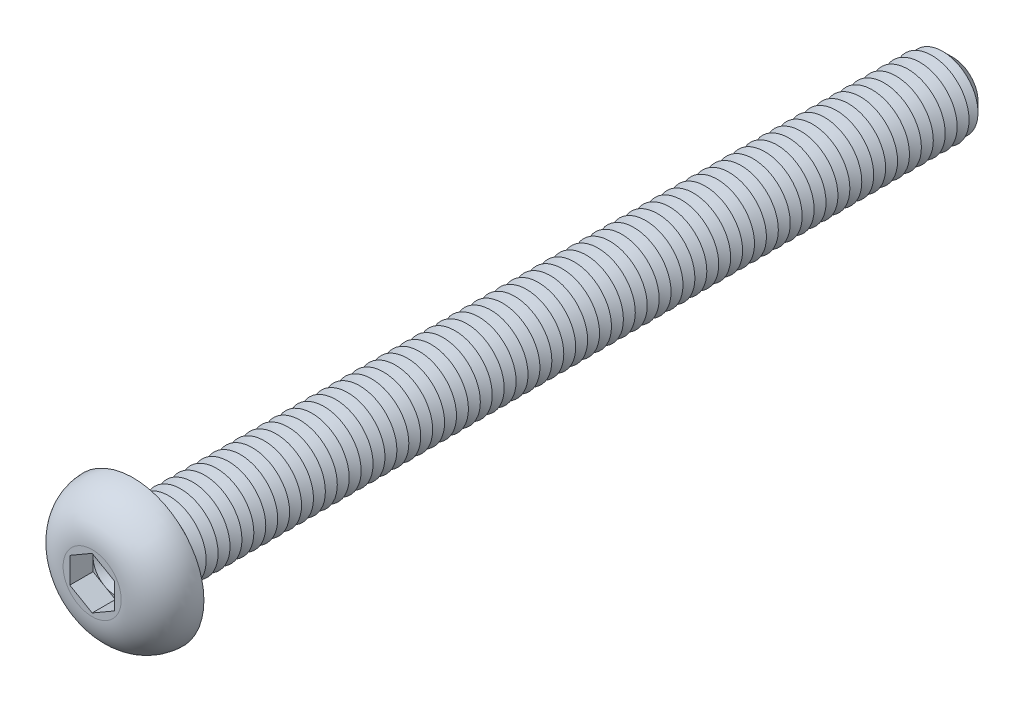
ISO-10303-21;
HEADER;
FILE_DESCRIPTION(('STEP AP214'),'2;1');
FILE_NAME('part.step','',(''),(''),'','','');
FILE_SCHEMA(('AUTOMOTIVE_DESIGN { 1 0 10303 214 1 1 1 1 }'));
ENDSEC;
DATA;
#1=APPLICATION_CONTEXT('core data for automotive mechanical design processes');
#2=APPLICATION_PROTOCOL_DEFINITION('international standard','automotive_design',2000,#1);
#3=PRODUCT_CONTEXT('',#1,'mechanical');
#4=PRODUCT('Part','Part','',(#3));
#5=PRODUCT_RELATED_PRODUCT_CATEGORY('part','',(#4));
#6=PRODUCT_DEFINITION_FORMATION('','',#4);
#7=PRODUCT_DEFINITION_CONTEXT('part definition',#1,'design');
#8=PRODUCT_DEFINITION('design','',#6,#7);
#9=PRODUCT_DEFINITION_SHAPE('','',#8);
#10=(LENGTH_UNIT() NAMED_UNIT(*) SI_UNIT(.MILLI.,.METRE.));
#11=(NAMED_UNIT(*) PLANE_ANGLE_UNIT() SI_UNIT($,.RADIAN.));
#12=(NAMED_UNIT(*) SI_UNIT($,.STERADIAN.) SOLID_ANGLE_UNIT());
#13=UNCERTAINTY_MEASURE_WITH_UNIT(LENGTH_MEASURE(1.E-05),#10,'distance_accuracy_value','');
#14=(GEOMETRIC_REPRESENTATION_CONTEXT(3) GLOBAL_UNCERTAINTY_ASSIGNED_CONTEXT((#13)) GLOBAL_UNIT_ASSIGNED_CONTEXT((#10,
#11,#12)) REPRESENTATION_CONTEXT('',''));
#15=CARTESIAN_POINT('',(0.,0.,0.));
#16=DIRECTION('',(0.,0.,1.));
#17=DIRECTION('',(1.,0.,0.));
#18=AXIS2_PLACEMENT_3D('',#15,#16,#17);
#19=CARTESIAN_POINT('',(0.,0.,1.19));
#20=DIRECTION('',(0.,0.,1.));
#21=DIRECTION('',(1.,0.,0.));
#22=AXIS2_PLACEMENT_3D('',#19,#20,#21);
#23=PLANE('',#22);
#24=CARTESIAN_POINT('',(0.,0.,1.19));
#25=DIRECTION('',(0.,0.,1.));
#26=DIRECTION('',(1.,0.,0.));
#27=AXIS2_PLACEMENT_3D('',#24,#25,#26);
#28=CIRCLE('',#27,1.5);
#29=CARTESIAN_POINT('',(1.5,0.,1.19));
#30=VERTEX_POINT('',#29);
#31=CARTESIAN_POINT('',(0.75,1.29903810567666,1.19));
#32=VERTEX_POINT('',#31);
#33=EDGE_CURVE('E117',#30,#32,#28,.T.);
#34=ORIENTED_EDGE('',*,*,#33,.F.);
#35=DIRECTION('',(0.,1.,0.));
#36=VECTOR('',#35,1.);
#37=CARTESIAN_POINT('',(1.5,-0.866025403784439,1.19));
#38=LINE('',#37,#36);
#39=CARTESIAN_POINT('',(1.5,0.86602540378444,1.19));
#40=VERTEX_POINT('',#39);
#41=EDGE_CURVE('E140',#30,#40,#38,.T.);
#42=ORIENTED_EDGE('',*,*,#41,.T.);
#43=DIRECTION('',(-0.866025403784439,0.5,0.));
#44=VECTOR('',#43,1.);
#45=CARTESIAN_POINT('',(1.5,0.86602540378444,1.19));
#46=LINE('',#45,#44);
#47=EDGE_CURVE('E135',#40,#32,#46,.T.);
#48=ORIENTED_EDGE('',*,*,#47,.T.);
#49=EDGE_LOOP('',(#34,#42,#48));
#50=FACE_BOUND('',#49,.T.);
#51=ADVANCED_FACE('F39',(#50),#23,.T.);
#52=CARTESIAN_POINT('',(0.,0.,1.19));
#53=DIRECTION('',(0.,0.,1.));
#54=DIRECTION('',(1.,0.,0.));
#55=AXIS2_PLACEMENT_3D('',#52,#53,#54);
#56=CIRCLE('',#55,1.5);
#57=CARTESIAN_POINT('',(-0.75,1.29903810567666,1.19));
#58=VERTEX_POINT('',#57);
#59=EDGE_CURVE('E11',#32,#58,#56,.T.);
#60=ORIENTED_EDGE('',*,*,#59,.F.);
#61=CARTESIAN_POINT('',(0.,1.73205080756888,1.19));
#62=VERTEX_POINT('',#61);
#63=EDGE_CURVE('E130',#32,#62,#46,.T.);
#64=ORIENTED_EDGE('',*,*,#63,.T.);
#65=DIRECTION('',(-0.866025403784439,-0.5,0.));
#66=VECTOR('',#65,1.);
#67=CARTESIAN_POINT('',(0.,1.73205080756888,1.19));
#68=LINE('',#67,#66);
#69=EDGE_CURVE('E132',#62,#58,#68,.T.);
#70=ORIENTED_EDGE('',*,*,#69,.T.);
#71=EDGE_LOOP('',(#60,#64,#70));
#72=FACE_BOUND('',#71,.T.);
#73=ADVANCED_FACE('F129',(#72),#23,.T.);
#74=CARTESIAN_POINT('',(-1.5,0.,1.19));
#75=VERTEX_POINT('',#74);
#76=EDGE_CURVE('E49',#58,#75,#56,.T.);
#77=ORIENTED_EDGE('',*,*,#76,.F.);
#78=CARTESIAN_POINT('',(-1.5,0.866025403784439,1.19));
#79=VERTEX_POINT('',#78);
#80=EDGE_CURVE('E143',#58,#79,#68,.T.);
#81=ORIENTED_EDGE('',*,*,#80,.T.);
#82=DIRECTION('',(0.,-1.,0.));
#83=VECTOR('',#82,1.);
#84=CARTESIAN_POINT('',(-1.5,0.866025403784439,1.19));
#85=LINE('',#84,#83);
#86=EDGE_CURVE('E154',#79,#75,#85,.T.);
#87=ORIENTED_EDGE('',*,*,#86,.T.);
#88=EDGE_LOOP('',(#77,#81,#87));
#89=FACE_BOUND('',#88,.T.);
#90=ADVANCED_FACE('F257',(#89),#23,.T.);
#91=CARTESIAN_POINT('',(-0.75,-1.29903810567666,1.19));
#92=VERTEX_POINT('',#91);
#93=EDGE_CURVE('E239',#75,#92,#56,.T.);
#94=ORIENTED_EDGE('',*,*,#93,.F.);
#95=CARTESIAN_POINT('',(-1.5,-0.866025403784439,1.19));
#96=VERTEX_POINT('',#95);
#97=EDGE_CURVE('E153',#75,#96,#85,.T.);
#98=ORIENTED_EDGE('',*,*,#97,.T.);
#99=DIRECTION('',(0.866025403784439,-0.5,0.));
#100=VECTOR('',#99,1.);
#101=CARTESIAN_POINT('',(-1.5,-0.866025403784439,1.19));
#102=LINE('',#101,#100);
#103=EDGE_CURVE('E159',#96,#92,#102,.T.);
#104=ORIENTED_EDGE('',*,*,#103,.T.);
#105=EDGE_LOOP('',(#94,#98,#104));
#106=FACE_BOUND('',#105,.T.);
#107=ADVANCED_FACE('F250',(#106),#23,.T.);
#108=CARTESIAN_POINT('',(0.75,-1.29903810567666,1.19));
#109=VERTEX_POINT('',#108);
#110=EDGE_CURVE('E56',#92,#109,#56,.T.);
#111=ORIENTED_EDGE('',*,*,#110,.F.);
#112=CARTESIAN_POINT('',(0.,-1.73205080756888,1.19));
#113=VERTEX_POINT('',#112);
#114=EDGE_CURVE('E158',#92,#113,#102,.T.);
#115=ORIENTED_EDGE('',*,*,#114,.T.);
#116=DIRECTION('',(0.866025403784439,0.5,0.));
#117=VECTOR('',#116,1.);
#118=CARTESIAN_POINT('',(0.,-1.73205080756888,1.19));
#119=LINE('',#118,#117);
#120=EDGE_CURVE('E164',#113,#109,#119,.T.);
#121=ORIENTED_EDGE('',*,*,#120,.T.);
#122=EDGE_LOOP('',(#111,#115,#121));
#123=FACE_BOUND('',#122,.T.);
#124=ADVANCED_FACE('F616',(#123),#23,.T.);
#125=CARTESIAN_POINT('',(0.,0.,-55.));
#126=DIRECTION('',(0.,0.,1.));
#127=DIRECTION('',(1.,0.,0.));
#128=AXIS2_PLACEMENT_3D('',#125,#126,#127);
#129=CYLINDRICAL_SURFACE('',#128,2.5);
#130=CARTESIAN_POINT('',(0.,0.,-0.399999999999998));
#131=DIRECTION('',(0.,0.,1.));
#132=DIRECTION('',(1.,0.,0.));
#133=AXIS2_PLACEMENT_3D('',#130,#131,#132);
#134=CIRCLE('',#133,2.5);
#135=CARTESIAN_POINT('',(2.5,0.,-0.399999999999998));
#136=VERTEX_POINT('',#135);
#137=EDGE_CURVE('E221',#136,#136,#134,.F.);
#138=ORIENTED_EDGE('',*,*,#137,.T.);
#139=EDGE_LOOP('',(#138));
#140=FACE_BOUND('',#139,.T.);
#141=CARTESIAN_POINT('',(0.,0.,-0.800000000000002));
#142=DIRECTION('',(0.,0.,1.));
#143=DIRECTION('',(1.,0.,0.));
#144=AXIS2_PLACEMENT_3D('',#141,#142,#143);
#145=CIRCLE('',#144,2.5);
#146=CARTESIAN_POINT('',(2.5,0.,-0.800000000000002));
#147=VERTEX_POINT('',#146);
#148=EDGE_CURVE('E149',#147,#147,#145,.T.);
#149=ORIENTED_EDGE('',*,*,#148,.T.);
#150=EDGE_LOOP('',(#149));
#151=FACE_BOUND('',#150,.T.);
#152=ADVANCED_FACE('F622',(#140,#151),#129,.T.);
#153=CARTESIAN_POINT('',(0.,4.75,0.));
#154=DIRECTION('',(0.,0.,1.));
#155=DIRECTION('',(1.,0.,0.));
#156=AXIS2_PLACEMENT_3D('',#153,#154,#155);
#157=PLANE('',#156);
#158=CARTESIAN_POINT('',(0.,0.,0.));
#159=DIRECTION('',(0.,0.,1.));
#160=DIRECTION('',(1.,0.,0.));
#161=AXIS2_PLACEMENT_3D('',#158,#159,#160);
#162=CIRCLE('',#161,2.9);
#163=CARTESIAN_POINT('',(2.9,0.,0.));
#164=VERTEX_POINT('',#163);
#165=EDGE_CURVE('E230',#164,#164,#162,.T.);
#166=ORIENTED_EDGE('',*,*,#165,.T.);
#167=EDGE_LOOP('',(#166));
#168=FACE_BOUND('',#167,.T.);
#169=CARTESIAN_POINT('',(0.,0.,0.));
#170=DIRECTION('',(0.,0.,1.));
#171=DIRECTION('',(1.,0.,0.));
#172=AXIS2_PLACEMENT_3D('',#169,#170,#171);
#173=CIRCLE('',#172,4.75);
#174=CARTESIAN_POINT('',(4.75,0.,0.));
#175=VERTEX_POINT('',#174);
#176=EDGE_CURVE('E195',#175,#175,#173,.T.);
#177=ORIENTED_EDGE('',*,*,#176,.F.);
#178=EDGE_LOOP('',(#177));
#179=FACE_BOUND('',#178,.T.);
#180=ADVANCED_FACE('F627',(#168,#179),#157,.F.);
#181=CARTESIAN_POINT('',(0.,0.,2.75));
#182=DIRECTION('',(0.,0.,-1.));
#183=DIRECTION('',(-1.,0.,0.));
#184=AXIS2_PLACEMENT_3D('',#181,#182,#183);
#185=PLANE('',#184);
#186=DIRECTION('',(-0.866025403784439,-0.5,0.));
#187=VECTOR('',#186,1.);
#188=CARTESIAN_POINT('',(0.,1.73205080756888,2.75));
#189=LINE('',#188,#187);
#190=CARTESIAN_POINT('',(0.,1.73205080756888,2.75));
#191=VERTEX_POINT('',#190);
#192=CARTESIAN_POINT('',(-1.5,0.866025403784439,2.75));
#193=VERTEX_POINT('',#192);
#194=EDGE_CURVE('E173',#191,#193,#189,.T.);
#195=ORIENTED_EDGE('',*,*,#194,.F.);
#196=DIRECTION('',(-0.866025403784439,0.5,0.));
#197=VECTOR('',#196,1.);
#198=CARTESIAN_POINT('',(1.5,0.86602540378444,2.75));
#199=LINE('',#198,#197);
#200=CARTESIAN_POINT('',(1.5,0.86602540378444,2.75));
#201=VERTEX_POINT('',#200);
#202=EDGE_CURVE('E64',#201,#191,#199,.T.);
#203=ORIENTED_EDGE('',*,*,#202,.F.);
#204=DIRECTION('',(0.,1.,0.));
#205=VECTOR('',#204,1.);
#206=CARTESIAN_POINT('',(1.5,-0.866025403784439,2.75));
#207=LINE('',#206,#205);
#208=CARTESIAN_POINT('',(1.5,-0.866025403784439,2.75));
#209=VERTEX_POINT('',#208);
#210=EDGE_CURVE('E138',#209,#201,#207,.T.);
#211=ORIENTED_EDGE('',*,*,#210,.F.);
#212=DIRECTION('',(0.866025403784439,0.5,0.));
#213=VECTOR('',#212,1.);
#214=CARTESIAN_POINT('',(0.,-1.73205080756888,2.75));
#215=LINE('',#214,#213);
#216=CARTESIAN_POINT('',(0.,-1.73205080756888,2.75));
#217=VERTEX_POINT('',#216);
#218=EDGE_CURVE('E185',#217,#209,#215,.T.);
#219=ORIENTED_EDGE('',*,*,#218,.F.);
#220=DIRECTION('',(0.866025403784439,-0.5,0.));
#221=VECTOR('',#220,1.);
#222=CARTESIAN_POINT('',(-1.5,-0.866025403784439,2.75));
#223=LINE('',#222,#221);
#224=CARTESIAN_POINT('',(-1.5,-0.866025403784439,2.75));
#225=VERTEX_POINT('',#224);
#226=EDGE_CURVE('E181',#225,#217,#223,.T.);
#227=ORIENTED_EDGE('',*,*,#226,.F.);
#228=DIRECTION('',(0.,-1.,0.));
#229=VECTOR('',#228,1.);
#230=CARTESIAN_POINT('',(-1.5,0.866025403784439,2.75));
#231=LINE('',#230,#229);
#232=EDGE_CURVE('E177',#193,#225,#231,.T.);
#233=ORIENTED_EDGE('',*,*,#232,.F.);
#234=EDGE_LOOP('',(#195,#203,#211,#219,#227,#233));
#235=FACE_BOUND('',#234,.T.);
#236=CARTESIAN_POINT('',(0.,0.,2.75));
#237=DIRECTION('',(0.,0.,1.));
#238=DIRECTION('',(1.,0.,0.));
#239=AXIS2_PLACEMENT_3D('',#236,#237,#238);
#240=CIRCLE('',#239,1.95044646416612);
#241=CARTESIAN_POINT('',(1.95044646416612,0.,2.75));
#242=VERTEX_POINT('',#241);
#243=EDGE_CURVE('E213',#242,#242,#240,.T.);
#244=ORIENTED_EDGE('',*,*,#243,.T.);
#245=EDGE_LOOP('',(#244));
#246=FACE_BOUND('',#245,.T.);
#247=ADVANCED_FACE('F266',(#235,#246),#185,.F.);
#248=CARTESIAN_POINT('',(0.,0.,-0.0500000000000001));
#249=DIRECTION('',(0.,0.,1.));
#250=DIRECTION('',(1.,0.,0.));
#251=AXIS2_PLACEMENT_3D('',#248,#249,#250);
#252=DEGENERATE_TOROIDAL_SURFACE('',#251,1.95044646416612,2.8,.T.);
#253=ORIENTED_EDGE('',*,*,#243,.F.);
#254=EDGE_LOOP('',(#253));
#255=FACE_BOUND('',#254,.T.);
#256=ORIENTED_EDGE('',*,*,#176,.T.);
#257=EDGE_LOOP('',(#256));
#258=FACE_BOUND('',#257,.T.);
#259=ADVANCED_FACE('F642',(#255,#258),#252,.T.);
#260=CARTESIAN_POINT('',(1.5,0.86602540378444,1.19));
#261=DIRECTION('',(0.5,0.866025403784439,0.));
#262=DIRECTION('',(-0.866025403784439,0.5,0.));
#263=AXIS2_PLACEMENT_3D('',#260,#261,#262);
#264=PLANE('',#263);
#265=ORIENTED_EDGE('',*,*,#202,.T.);
#266=DIRECTION('',(0.,0.,1.));
#267=VECTOR('',#266,1.);
#268=CARTESIAN_POINT('',(0.,1.73205080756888,1.19));
#269=LINE('',#268,#267);
#270=EDGE_CURVE('E136',#62,#191,#269,.T.);
#271=ORIENTED_EDGE('',*,*,#270,.F.);
#272=ORIENTED_EDGE('',*,*,#63,.F.);
#273=ORIENTED_EDGE('',*,*,#47,.F.);
#274=DIRECTION('',(0.,0.,1.));
#275=VECTOR('',#274,1.);
#276=CARTESIAN_POINT('',(1.5,0.86602540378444,1.19));
#277=LINE('',#276,#275);
#278=EDGE_CURVE('E192',#40,#201,#277,.T.);
#279=ORIENTED_EDGE('',*,*,#278,.T.);
#280=EDGE_LOOP('',(#265,#271,#272,#273,#279));
#281=FACE_BOUND('',#280,.T.);
#282=ADVANCED_FACE('F134',(#281),#264,.F.);
#283=CARTESIAN_POINT('',(1.5,-0.866025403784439,1.19));
#284=DIRECTION('',(1.,0.,0.));
#285=DIRECTION('',(0.,1.,0.));
#286=AXIS2_PLACEMENT_3D('',#283,#284,#285);
#287=PLANE('',#286);
#288=ORIENTED_EDGE('',*,*,#210,.T.);
#289=ORIENTED_EDGE('',*,*,#278,.F.);
#290=ORIENTED_EDGE('',*,*,#41,.F.);
#291=CARTESIAN_POINT('',(1.5,-0.866025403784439,1.19));
#292=VERTEX_POINT('',#291);
#293=EDGE_CURVE('E168',#292,#30,#38,.T.);
#294=ORIENTED_EDGE('',*,*,#293,.F.);
#295=DIRECTION('',(0.,0.,1.));
#296=VECTOR('',#295,1.);
#297=CARTESIAN_POINT('',(1.5,-0.866025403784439,1.19));
#298=LINE('',#297,#296);
#299=EDGE_CURVE('E196',#292,#209,#298,.T.);
#300=ORIENTED_EDGE('',*,*,#299,.T.);
#301=EDGE_LOOP('',(#288,#289,#290,#294,#300));
#302=FACE_BOUND('',#301,.T.);
#303=ADVANCED_FACE('F635',(#302),#287,.F.);
#304=CARTESIAN_POINT('',(0.,-1.73205080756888,1.19));
#305=DIRECTION('',(0.5,-0.866025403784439,0.));
#306=DIRECTION('',(0.866025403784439,0.5,0.));
#307=AXIS2_PLACEMENT_3D('',#304,#305,#306);
#308=PLANE('',#307);
#309=ORIENTED_EDGE('',*,*,#218,.T.);
#310=ORIENTED_EDGE('',*,*,#299,.F.);
#311=EDGE_CURVE('E163',#109,#292,#119,.T.);
#312=ORIENTED_EDGE('',*,*,#311,.F.);
#313=ORIENTED_EDGE('',*,*,#120,.F.);
#314=DIRECTION('',(0.,0.,1.));
#315=VECTOR('',#314,1.);
#316=CARTESIAN_POINT('',(0.,-1.73205080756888,1.19));
#317=LINE('',#316,#315);
#318=EDGE_CURVE('E199',#113,#217,#317,.T.);
#319=ORIENTED_EDGE('',*,*,#318,.T.);
#320=EDGE_LOOP('',(#309,#310,#312,#313,#319));
#321=FACE_BOUND('',#320,.T.);
#322=ADVANCED_FACE('F631',(#321),#308,.F.);
#323=CARTESIAN_POINT('',(-1.5,-0.866025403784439,1.19));
#324=DIRECTION('',(-0.5,-0.866025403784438,0.));
#325=DIRECTION('',(0.866025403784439,-0.5,0.));
#326=AXIS2_PLACEMENT_3D('',#323,#324,#325);
#327=PLANE('',#326);
#328=ORIENTED_EDGE('',*,*,#226,.T.);
#329=ORIENTED_EDGE('',*,*,#318,.F.);
#330=ORIENTED_EDGE('',*,*,#114,.F.);
#331=ORIENTED_EDGE('',*,*,#103,.F.);
#332=DIRECTION('',(0.,0.,1.));
#333=VECTOR('',#332,1.);
#334=CARTESIAN_POINT('',(-1.5,-0.866025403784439,1.19));
#335=LINE('',#334,#333);
#336=EDGE_CURVE('E202',#96,#225,#335,.T.);
#337=ORIENTED_EDGE('',*,*,#336,.T.);
#338=EDGE_LOOP('',(#328,#329,#330,#331,#337));
#339=FACE_BOUND('',#338,.T.);
#340=ADVANCED_FACE('F271',(#339),#327,.F.);
#341=CARTESIAN_POINT('',(-1.5,0.866025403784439,1.19));
#342=DIRECTION('',(-1.,0.,0.));
#343=DIRECTION('',(0.,-1.,0.));
#344=AXIS2_PLACEMENT_3D('',#341,#342,#343);
#345=PLANE('',#344);
#346=ORIENTED_EDGE('',*,*,#232,.T.);
#347=ORIENTED_EDGE('',*,*,#336,.F.);
#348=ORIENTED_EDGE('',*,*,#97,.F.);
#349=ORIENTED_EDGE('',*,*,#86,.F.);
#350=DIRECTION('',(0.,0.,1.));
#351=VECTOR('',#350,1.);
#352=CARTESIAN_POINT('',(-1.5,0.866025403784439,1.19));
#353=LINE('',#352,#351);
#354=EDGE_CURVE('E205',#79,#193,#353,.T.);
#355=ORIENTED_EDGE('',*,*,#354,.T.);
#356=EDGE_LOOP('',(#346,#347,#348,#349,#355));
#357=FACE_BOUND('',#356,.T.);
#358=ADVANCED_FACE('F255',(#357),#345,.F.);
#359=CARTESIAN_POINT('',(0.,1.73205080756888,1.19));
#360=DIRECTION('',(-0.5,0.866025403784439,0.));
#361=DIRECTION('',(-0.866025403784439,-0.5,0.));
#362=AXIS2_PLACEMENT_3D('',#359,#360,#361);
#363=PLANE('',#362);
#364=ORIENTED_EDGE('',*,*,#194,.T.);
#365=ORIENTED_EDGE('',*,*,#354,.F.);
#366=ORIENTED_EDGE('',*,*,#80,.F.);
#367=ORIENTED_EDGE('',*,*,#69,.F.);
#368=ORIENTED_EDGE('',*,*,#270,.T.);
#369=EDGE_LOOP('',(#364,#365,#366,#367,#368));
#370=FACE_BOUND('',#369,.T.);
#371=ADVANCED_FACE('F260',(#370),#363,.F.);
#372=EDGE_CURVE('E43',#109,#30,#56,.T.);
#373=ORIENTED_EDGE('',*,*,#372,.F.);
#374=ORIENTED_EDGE('',*,*,#311,.T.);
#375=ORIENTED_EDGE('',*,*,#293,.T.);
#376=EDGE_LOOP('',(#373,#374,#375));
#377=FACE_BOUND('',#376,.T.);
#378=ADVANCED_FACE('F605',(#377),#23,.T.);
#379=CARTESIAN_POINT('',(0.,0.,-0.800000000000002));
#380=DIRECTION('',(0.,0.,1.));
#381=DIRECTION('',(1.,0.,0.));
#382=AXIS2_PLACEMENT_3D('',#379,#380,#381);
#383=CONICAL_SURFACE('',#382,2.5,1.0471975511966);
#384=CARTESIAN_POINT('',(0.,0.,-1.2));
#385=DIRECTION('',(0.,0.,1.));
#386=DIRECTION('',(1.,0.,0.));
#387=AXIS2_PLACEMENT_3D('',#384,#385,#386);
#388=CIRCLE('',#387,1.80717967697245);
#389=CARTESIAN_POINT('',(1.80717967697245,0.,-1.2));
#390=VERTEX_POINT('',#389);
#391=EDGE_CURVE('E480',#390,#390,#388,.T.);
#392=ORIENTED_EDGE('',*,*,#391,.T.);
#393=EDGE_LOOP('',(#392));
#394=FACE_BOUND('',#393,.T.);
#395=ORIENTED_EDGE('',*,*,#148,.F.);
#396=EDGE_LOOP('',(#395));
#397=FACE_BOUND('',#396,.T.);
#398=ADVANCED_FACE('F590',(#394,#397),#383,.T.);
#399=CARTESIAN_POINT('',(0.,0.,-1.2));
#400=DIRECTION('',(0.,0.,-1.));
#401=DIRECTION('',(-1.,0.,0.));
#402=AXIS2_PLACEMENT_3D('',#399,#400,#401);
#403=CONICAL_SURFACE('',#402,1.80717967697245,1.04719755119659);
#404=CARTESIAN_POINT('',(0.,0.,-1.6));
#405=DIRECTION('',(0.,0.,1.));
#406=DIRECTION('',(1.,0.,0.));
#407=AXIS2_PLACEMENT_3D('',#404,#405,#406);
#408=CIRCLE('',#407,2.5);
#409=CARTESIAN_POINT('',(2.5,0.,-1.6));
#410=VERTEX_POINT('',#409);
#411=EDGE_CURVE('E327',#410,#410,#408,.T.);
#412=ORIENTED_EDGE('',*,*,#411,.T.);
#413=EDGE_LOOP('',(#412));
#414=FACE_BOUND('',#413,.T.);
#415=ORIENTED_EDGE('',*,*,#391,.F.);
#416=EDGE_LOOP('',(#415));
#417=FACE_BOUND('',#416,.T.);
#418=ADVANCED_FACE('F593',(#414,#417),#403,.T.);
#419=CARTESIAN_POINT('',(0.,0.,-1.6));
#420=DIRECTION('',(0.,0.,1.));
#421=DIRECTION('',(1.,0.,0.));
#422=AXIS2_PLACEMENT_3D('',#419,#420,#421);
#423=CONICAL_SURFACE('',#422,2.5,1.0471975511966);
#424=CARTESIAN_POINT('',(0.,0.,-2.));
#425=DIRECTION('',(0.,0.,1.));
#426=DIRECTION('',(1.,0.,0.));
#427=AXIS2_PLACEMENT_3D('',#424,#425,#426);
#428=CIRCLE('',#427,1.80717967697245);
#429=CARTESIAN_POINT('',(1.80717967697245,0.,-2.));
#430=VERTEX_POINT('',#429);
#431=EDGE_CURVE('E325',#430,#430,#428,.T.);
#432=ORIENTED_EDGE('',*,*,#431,.T.);
#433=EDGE_LOOP('',(#432));
#434=FACE_BOUND('',#433,.T.);
#435=ORIENTED_EDGE('',*,*,#411,.F.);
#436=EDGE_LOOP('',(#435));
#437=FACE_BOUND('',#436,.T.);
#438=ADVANCED_FACE('F595',(#434,#437),#423,.T.);
#439=CARTESIAN_POINT('',(0.,0.,-2.));
#440=DIRECTION('',(0.,0.,-1.));
#441=DIRECTION('',(-1.,0.,0.));
#442=AXIS2_PLACEMENT_3D('',#439,#440,#441);
#443=CONICAL_SURFACE('',#442,1.80717967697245,1.04719755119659);
#444=CARTESIAN_POINT('',(0.,0.,-2.4));
#445=DIRECTION('',(0.,0.,1.));
#446=DIRECTION('',(1.,0.,0.));
#447=AXIS2_PLACEMENT_3D('',#444,#445,#446);
#448=CIRCLE('',#447,2.5);
#449=CARTESIAN_POINT('',(2.5,0.,-2.4));
#450=VERTEX_POINT('',#449);
#451=EDGE_CURVE('E328',#450,#450,#448,.T.);
#452=ORIENTED_EDGE('',*,*,#451,.T.);
#453=EDGE_LOOP('',(#452));
#454=FACE_BOUND('',#453,.T.);
#455=ORIENTED_EDGE('',*,*,#431,.F.);
#456=EDGE_LOOP('',(#455));
#457=FACE_BOUND('',#456,.T.);
#458=ADVANCED_FACE('F602',(#454,#457),#443,.T.);
#459=CARTESIAN_POINT('',(0.,0.,-2.4));
#460=DIRECTION('',(0.,0.,1.));
#461=DIRECTION('',(1.,0.,0.));
#462=AXIS2_PLACEMENT_3D('',#459,#460,#461);
#463=CONICAL_SURFACE('',#462,2.5,1.0471975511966);
#464=CARTESIAN_POINT('',(0.,0.,-2.8));
#465=DIRECTION('',(0.,0.,1.));
#466=DIRECTION('',(1.,0.,0.));
#467=AXIS2_PLACEMENT_3D('',#464,#465,#466);
#468=CIRCLE('',#467,1.80717967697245);
#469=CARTESIAN_POINT('',(1.80717967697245,0.,-2.8));
#470=VERTEX_POINT('',#469);
#471=EDGE_CURVE('E398',#470,#470,#468,.T.);
#472=ORIENTED_EDGE('',*,*,#471,.T.);
#473=EDGE_LOOP('',(#472));
#474=FACE_BOUND('',#473,.T.);
#475=ORIENTED_EDGE('',*,*,#451,.F.);
#476=EDGE_LOOP('',(#475));
#477=FACE_BOUND('',#476,.T.);
#478=ADVANCED_FACE('F989',(#474,#477),#463,.T.);
#479=CARTESIAN_POINT('',(0.,0.,-2.8));
#480=DIRECTION('',(0.,0.,-1.));
#481=DIRECTION('',(-1.,0.,0.));
#482=AXIS2_PLACEMENT_3D('',#479,#480,#481);
#483=CONICAL_SURFACE('',#482,1.80717967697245,1.04719755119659);
#484=CARTESIAN_POINT('',(0.,0.,-3.2));
#485=DIRECTION('',(0.,0.,1.));
#486=DIRECTION('',(1.,0.,0.));
#487=AXIS2_PLACEMENT_3D('',#484,#485,#486);
#488=CIRCLE('',#487,2.5);
#489=CARTESIAN_POINT('',(2.5,0.,-3.2));
#490=VERTEX_POINT('',#489);
#491=EDGE_CURVE('E580',#490,#490,#488,.T.);
#492=ORIENTED_EDGE('',*,*,#491,.T.);
#493=EDGE_LOOP('',(#492));
#494=FACE_BOUND('',#493,.T.);
#495=ORIENTED_EDGE('',*,*,#471,.F.);
#496=EDGE_LOOP('',(#495));
#497=FACE_BOUND('',#496,.T.);
#498=ADVANCED_FACE('F985',(#494,#497),#483,.T.);
#499=CARTESIAN_POINT('',(0.,0.,-3.2));
#500=DIRECTION('',(0.,0.,1.));
#501=DIRECTION('',(1.,0.,0.));
#502=AXIS2_PLACEMENT_3D('',#499,#500,#501);
#503=CONICAL_SURFACE('',#502,2.5,1.0471975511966);
#504=CARTESIAN_POINT('',(0.,0.,-3.6));
#505=DIRECTION('',(0.,0.,1.));
#506=DIRECTION('',(1.,0.,0.));
#507=AXIS2_PLACEMENT_3D('',#504,#505,#506);
#508=CIRCLE('',#507,1.80717967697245);
#509=CARTESIAN_POINT('',(1.80717967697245,0.,-3.6));
#510=VERTEX_POINT('',#509);
#511=EDGE_CURVE('E576',#510,#510,#508,.T.);
#512=ORIENTED_EDGE('',*,*,#511,.T.);
#513=EDGE_LOOP('',(#512));
#514=FACE_BOUND('',#513,.T.);
#515=ORIENTED_EDGE('',*,*,#491,.F.);
#516=EDGE_LOOP('',(#515));
#517=FACE_BOUND('',#516,.T.);
#518=ADVANCED_FACE('F981',(#514,#517),#503,.T.);
#519=CARTESIAN_POINT('',(0.,0.,-3.6));
#520=DIRECTION('',(0.,0.,-1.));
#521=DIRECTION('',(-1.,0.,0.));
#522=AXIS2_PLACEMENT_3D('',#519,#520,#521);
#523=CONICAL_SURFACE('',#522,1.80717967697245,1.04719755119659);
#524=CARTESIAN_POINT('',(0.,0.,-4.));
#525=DIRECTION('',(0.,0.,1.));
#526=DIRECTION('',(1.,0.,0.));
#527=AXIS2_PLACEMENT_3D('',#524,#525,#526);
#528=CIRCLE('',#527,2.5);
#529=CARTESIAN_POINT('',(2.5,0.,-4.));
#530=VERTEX_POINT('',#529);
#531=EDGE_CURVE('E572',#530,#530,#528,.T.);
#532=ORIENTED_EDGE('',*,*,#531,.T.);
#533=EDGE_LOOP('',(#532));
#534=FACE_BOUND('',#533,.T.);
#535=ORIENTED_EDGE('',*,*,#511,.F.);
#536=EDGE_LOOP('',(#535));
#537=FACE_BOUND('',#536,.T.);
#538=ADVANCED_FACE('F977',(#534,#537),#523,.T.);
#539=CARTESIAN_POINT('',(0.,0.,-4.));
#540=DIRECTION('',(0.,0.,1.));
#541=DIRECTION('',(1.,0.,0.));
#542=AXIS2_PLACEMENT_3D('',#539,#540,#541);
#543=CONICAL_SURFACE('',#542,2.5,1.0471975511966);
#544=CARTESIAN_POINT('',(0.,0.,-4.4));
#545=DIRECTION('',(0.,0.,1.));
#546=DIRECTION('',(1.,0.,0.));
#547=AXIS2_PLACEMENT_3D('',#544,#545,#546);
#548=CIRCLE('',#547,1.80717967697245);
#549=CARTESIAN_POINT('',(1.80717967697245,0.,-4.4));
#550=VERTEX_POINT('',#549);
#551=EDGE_CURVE('E475',#550,#550,#548,.T.);
#552=ORIENTED_EDGE('',*,*,#551,.T.);
#553=EDGE_LOOP('',(#552));
#554=FACE_BOUND('',#553,.T.);
#555=ORIENTED_EDGE('',*,*,#531,.F.);
#556=EDGE_LOOP('',(#555));
#557=FACE_BOUND('',#556,.T.);
#558=ADVANCED_FACE('F973',(#554,#557),#543,.T.);
#559=CARTESIAN_POINT('',(0.,0.,-4.4));
#560=DIRECTION('',(0.,0.,-1.));
#561=DIRECTION('',(-1.,0.,0.));
#562=AXIS2_PLACEMENT_3D('',#559,#560,#561);
#563=CONICAL_SURFACE('',#562,1.80717967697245,1.04719755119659);
#564=CARTESIAN_POINT('',(0.,0.,-4.8));
#565=DIRECTION('',(0.,0.,1.));
#566=DIRECTION('',(1.,0.,0.));
#567=AXIS2_PLACEMENT_3D('',#564,#565,#566);
#568=CIRCLE('',#567,2.5);
#569=CARTESIAN_POINT('',(2.5,0.,-4.8));
#570=VERTEX_POINT('',#569);
#571=EDGE_CURVE('E322',#570,#570,#568,.T.);
#572=ORIENTED_EDGE('',*,*,#571,.T.);
#573=EDGE_LOOP('',(#572));
#574=FACE_BOUND('',#573,.T.);
#575=ORIENTED_EDGE('',*,*,#551,.F.);
#576=EDGE_LOOP('',(#575));
#577=FACE_BOUND('',#576,.T.);
#578=ADVANCED_FACE('F969',(#574,#577),#563,.T.);
#579=CARTESIAN_POINT('',(0.,0.,-4.8));
#580=DIRECTION('',(0.,0.,1.));
#581=DIRECTION('',(1.,0.,0.));
#582=AXIS2_PLACEMENT_3D('',#579,#580,#581);
#583=CONICAL_SURFACE('',#582,2.5,1.0471975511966);
#584=CARTESIAN_POINT('',(0.,0.,-5.2));
#585=DIRECTION('',(0.,0.,1.));
#586=DIRECTION('',(1.,0.,0.));
#587=AXIS2_PLACEMENT_3D('',#584,#585,#586);
#588=CIRCLE('',#587,1.80717967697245);
#589=CARTESIAN_POINT('',(1.80717967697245,0.,-5.2));
#590=VERTEX_POINT('',#589);
#591=EDGE_CURVE('E319',#590,#590,#588,.T.);
#592=ORIENTED_EDGE('',*,*,#591,.T.);
#593=EDGE_LOOP('',(#592));
#594=FACE_BOUND('',#593,.T.);
#595=ORIENTED_EDGE('',*,*,#571,.F.);
#596=EDGE_LOOP('',(#595));
#597=FACE_BOUND('',#596,.T.);
#598=ADVANCED_FACE('F965',(#594,#597),#583,.T.);
#599=CARTESIAN_POINT('',(0.,0.,-5.2));
#600=DIRECTION('',(0.,0.,-1.));
#601=DIRECTION('',(-1.,0.,0.));
#602=AXIS2_PLACEMENT_3D('',#599,#600,#601);
#603=CONICAL_SURFACE('',#602,1.80717967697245,1.04719755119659);
#604=CARTESIAN_POINT('',(0.,0.,-5.6));
#605=DIRECTION('',(0.,0.,1.));
#606=DIRECTION('',(1.,0.,0.));
#607=AXIS2_PLACEMENT_3D('',#604,#605,#606);
#608=CIRCLE('',#607,2.5);
#609=CARTESIAN_POINT('',(2.5,0.,-5.6));
#610=VERTEX_POINT('',#609);
#611=EDGE_CURVE('E323',#610,#610,#608,.T.);
#612=ORIENTED_EDGE('',*,*,#611,.T.);
#613=EDGE_LOOP('',(#612));
#614=FACE_BOUND('',#613,.T.);
#615=ORIENTED_EDGE('',*,*,#591,.F.);
#616=EDGE_LOOP('',(#615));
#617=FACE_BOUND('',#616,.T.);
#618=ADVANCED_FACE('F961',(#614,#617),#603,.T.);
#619=CARTESIAN_POINT('',(0.,0.,-5.6));
#620=DIRECTION('',(0.,0.,1.));
#621=DIRECTION('',(1.,0.,0.));
#622=AXIS2_PLACEMENT_3D('',#619,#620,#621);
#623=CONICAL_SURFACE('',#622,2.5,1.0471975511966);
#624=CARTESIAN_POINT('',(0.,0.,-6.));
#625=DIRECTION('',(0.,0.,1.));
#626=DIRECTION('',(1.,0.,0.));
#627=AXIS2_PLACEMENT_3D('',#624,#625,#626);
#628=CIRCLE('',#627,1.80717967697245);
#629=CARTESIAN_POINT('',(1.80717967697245,0.,-6.));
#630=VERTEX_POINT('',#629);
#631=EDGE_CURVE('E316',#630,#630,#628,.T.);
#632=ORIENTED_EDGE('',*,*,#631,.T.);
#633=EDGE_LOOP('',(#632));
#634=FACE_BOUND('',#633,.T.);
#635=ORIENTED_EDGE('',*,*,#611,.F.);
#636=EDGE_LOOP('',(#635));
#637=FACE_BOUND('',#636,.T.);
#638=ADVANCED_FACE('F957',(#634,#637),#623,.T.);
#639=CARTESIAN_POINT('',(0.,0.,-6.));
#640=DIRECTION('',(0.,0.,-1.));
#641=DIRECTION('',(-1.,0.,0.));
#642=AXIS2_PLACEMENT_3D('',#639,#640,#641);
#643=CONICAL_SURFACE('',#642,1.80717967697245,1.04719755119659);
#644=CARTESIAN_POINT('',(0.,0.,-6.4));
#645=DIRECTION('',(0.,0.,1.));
#646=DIRECTION('',(1.,0.,0.));
#647=AXIS2_PLACEMENT_3D('',#644,#645,#646);
#648=CIRCLE('',#647,2.5);
#649=CARTESIAN_POINT('',(2.5,0.,-6.4));
#650=VERTEX_POINT('',#649);
#651=EDGE_CURVE('E313',#650,#650,#648,.T.);
#652=ORIENTED_EDGE('',*,*,#651,.T.);
#653=EDGE_LOOP('',(#652));
#654=FACE_BOUND('',#653,.T.);
#655=ORIENTED_EDGE('',*,*,#631,.F.);
#656=EDGE_LOOP('',(#655));
#657=FACE_BOUND('',#656,.T.);
#658=ADVANCED_FACE('F953',(#654,#657),#643,.T.);
#659=CARTESIAN_POINT('',(0.,0.,-6.4));
#660=DIRECTION('',(0.,0.,1.));
#661=DIRECTION('',(1.,0.,0.));
#662=AXIS2_PLACEMENT_3D('',#659,#660,#661);
#663=CONICAL_SURFACE('',#662,2.5,1.0471975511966);
#664=CARTESIAN_POINT('',(0.,0.,-6.8));
#665=DIRECTION('',(0.,0.,1.));
#666=DIRECTION('',(1.,0.,0.));
#667=AXIS2_PLACEMENT_3D('',#664,#665,#666);
#668=CIRCLE('',#667,1.80717967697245);
#669=CARTESIAN_POINT('',(1.80717967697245,0.,-6.8));
#670=VERTEX_POINT('',#669);
#671=EDGE_CURVE('E317',#670,#670,#668,.T.);
#672=ORIENTED_EDGE('',*,*,#671,.T.);
#673=EDGE_LOOP('',(#672));
#674=FACE_BOUND('',#673,.T.);
#675=ORIENTED_EDGE('',*,*,#651,.F.);
#676=EDGE_LOOP('',(#675));
#677=FACE_BOUND('',#676,.T.);
#678=ADVANCED_FACE('F949',(#674,#677),#663,.T.);
#679=CARTESIAN_POINT('',(0.,0.,-6.8));
#680=DIRECTION('',(0.,0.,-1.));
#681=DIRECTION('',(-1.,0.,0.));
#682=AXIS2_PLACEMENT_3D('',#679,#680,#681);
#683=CONICAL_SURFACE('',#682,1.80717967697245,1.04719755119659);
#684=CARTESIAN_POINT('',(0.,0.,-7.2));
#685=DIRECTION('',(0.,0.,1.));
#686=DIRECTION('',(1.,0.,0.));
#687=AXIS2_PLACEMENT_3D('',#684,#685,#686);
#688=CIRCLE('',#687,2.5);
#689=CARTESIAN_POINT('',(2.5,0.,-7.2));
#690=VERTEX_POINT('',#689);
#691=EDGE_CURVE('E438',#690,#690,#688,.T.);
#692=ORIENTED_EDGE('',*,*,#691,.T.);
#693=EDGE_LOOP('',(#692));
#694=FACE_BOUND('',#693,.T.);
#695=ORIENTED_EDGE('',*,*,#671,.F.);
#696=EDGE_LOOP('',(#695));
#697=FACE_BOUND('',#696,.T.);
#698=ADVANCED_FACE('F945',(#694,#697),#683,.T.);
#699=CARTESIAN_POINT('',(0.,0.,-7.2));
#700=DIRECTION('',(0.,0.,1.));
#701=DIRECTION('',(1.,0.,0.));
#702=AXIS2_PLACEMENT_3D('',#699,#700,#701);
#703=CONICAL_SURFACE('',#702,2.5,1.0471975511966);
#704=CARTESIAN_POINT('',(0.,0.,-7.6));
#705=DIRECTION('',(0.,0.,1.));
#706=DIRECTION('',(1.,0.,0.));
#707=AXIS2_PLACEMENT_3D('',#704,#705,#706);
#708=CIRCLE('',#707,1.80717967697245);
#709=CARTESIAN_POINT('',(1.80717967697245,0.,-7.6));
#710=VERTEX_POINT('',#709);
#711=EDGE_CURVE('E435',#710,#710,#708,.T.);
#712=ORIENTED_EDGE('',*,*,#711,.T.);
#713=EDGE_LOOP('',(#712));
#714=FACE_BOUND('',#713,.T.);
#715=ORIENTED_EDGE('',*,*,#691,.F.);
#716=EDGE_LOOP('',(#715));
#717=FACE_BOUND('',#716,.T.);
#718=ADVANCED_FACE('F941',(#714,#717),#703,.T.);
#719=CARTESIAN_POINT('',(0.,0.,-7.6));
#720=DIRECTION('',(0.,0.,-1.));
#721=DIRECTION('',(-1.,0.,0.));
#722=AXIS2_PLACEMENT_3D('',#719,#720,#721);
#723=CONICAL_SURFACE('',#722,1.80717967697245,1.04719755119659);
#724=CARTESIAN_POINT('',(0.,0.,-8.));
#725=DIRECTION('',(0.,0.,1.));
#726=DIRECTION('',(1.,0.,0.));
#727=AXIS2_PLACEMENT_3D('',#724,#725,#726);
#728=CIRCLE('',#727,2.5);
#729=CARTESIAN_POINT('',(2.5,0.,-8.));
#730=VERTEX_POINT('',#729);
#731=EDGE_CURVE('E439',#730,#730,#728,.T.);
#732=ORIENTED_EDGE('',*,*,#731,.T.);
#733=EDGE_LOOP('',(#732));
#734=FACE_BOUND('',#733,.T.);
#735=ORIENTED_EDGE('',*,*,#711,.F.);
#736=EDGE_LOOP('',(#735));
#737=FACE_BOUND('',#736,.T.);
#738=ADVANCED_FACE('F938',(#734,#737),#723,.T.);
#739=CARTESIAN_POINT('',(0.,0.,-8.));
#740=DIRECTION('',(0.,0.,1.));
#741=DIRECTION('',(1.,0.,0.));
#742=AXIS2_PLACEMENT_3D('',#739,#740,#741);
#743=CONICAL_SURFACE('',#742,2.5,1.0471975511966);
#744=CARTESIAN_POINT('',(0.,0.,-8.4));
#745=DIRECTION('',(0.,0.,1.));
#746=DIRECTION('',(1.,0.,0.));
#747=AXIS2_PLACEMENT_3D('',#744,#745,#746);
#748=CIRCLE('',#747,1.80717967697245);
#749=CARTESIAN_POINT('',(1.80717967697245,0.,-8.4));
#750=VERTEX_POINT('',#749);
#751=EDGE_CURVE('E394',#750,#750,#748,.T.);
#752=ORIENTED_EDGE('',*,*,#751,.T.);
#753=EDGE_LOOP('',(#752));
#754=FACE_BOUND('',#753,.T.);
#755=ORIENTED_EDGE('',*,*,#731,.F.);
#756=EDGE_LOOP('',(#755));
#757=FACE_BOUND('',#756,.T.);
#758=ADVANCED_FACE('F934',(#754,#757),#743,.T.);
#759=CARTESIAN_POINT('',(0.,0.,-8.4));
#760=DIRECTION('',(0.,0.,-1.));
#761=DIRECTION('',(-1.,0.,0.));
#762=AXIS2_PLACEMENT_3D('',#759,#760,#761);
#763=CONICAL_SURFACE('',#762,1.80717967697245,1.04719755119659);
#764=CARTESIAN_POINT('',(0.,0.,-8.8));
#765=DIRECTION('',(0.,0.,1.));
#766=DIRECTION('',(1.,0.,0.));
#767=AXIS2_PLACEMENT_3D('',#764,#765,#766);
#768=CIRCLE('',#767,2.5);
#769=CARTESIAN_POINT('',(2.5,0.,-8.8));
#770=VERTEX_POINT('',#769);
#771=EDGE_CURVE('E391',#770,#770,#768,.T.);
#772=ORIENTED_EDGE('',*,*,#771,.T.);
#773=EDGE_LOOP('',(#772));
#774=FACE_BOUND('',#773,.T.);
#775=ORIENTED_EDGE('',*,*,#751,.F.);
#776=EDGE_LOOP('',(#775));
#777=FACE_BOUND('',#776,.T.);
#778=ADVANCED_FACE('F928',(#774,#777),#763,.T.);
#779=CARTESIAN_POINT('',(0.,0.,-8.8));
#780=DIRECTION('',(0.,0.,1.));
#781=DIRECTION('',(1.,0.,0.));
#782=AXIS2_PLACEMENT_3D('',#779,#780,#781);
#783=CONICAL_SURFACE('',#782,2.5,1.0471975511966);
#784=CARTESIAN_POINT('',(0.,0.,-9.2));
#785=DIRECTION('',(0.,0.,1.));
#786=DIRECTION('',(1.,0.,0.));
#787=AXIS2_PLACEMENT_3D('',#784,#785,#786);
#788=CIRCLE('',#787,1.80717967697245);
#789=CARTESIAN_POINT('',(1.80717967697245,0.,-9.2));
#790=VERTEX_POINT('',#789);
#791=EDGE_CURVE('E395',#790,#790,#788,.T.);
#792=ORIENTED_EDGE('',*,*,#791,.T.);
#793=EDGE_LOOP('',(#792));
#794=FACE_BOUND('',#793,.T.);
#795=ORIENTED_EDGE('',*,*,#771,.F.);
#796=EDGE_LOOP('',(#795));
#797=FACE_BOUND('',#796,.T.);
#798=ADVANCED_FACE('F913',(#794,#797),#783,.T.);
#799=CARTESIAN_POINT('',(0.,0.,-9.2));
#800=DIRECTION('',(0.,0.,-1.));
#801=DIRECTION('',(-1.,0.,0.));
#802=AXIS2_PLACEMENT_3D('',#799,#800,#801);
#803=CONICAL_SURFACE('',#802,1.80717967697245,1.04719755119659);
#804=CARTESIAN_POINT('',(0.,0.,-9.6));
#805=DIRECTION('',(0.,0.,1.));
#806=DIRECTION('',(1.,0.,0.));
#807=AXIS2_PLACEMENT_3D('',#804,#805,#806);
#808=CIRCLE('',#807,2.5);
#809=CARTESIAN_POINT('',(2.5,0.,-9.6));
#810=VERTEX_POINT('',#809);
#811=EDGE_CURVE('E906',#810,#810,#808,.T.);
#812=ORIENTED_EDGE('',*,*,#811,.T.);
#813=EDGE_LOOP('',(#812));
#814=FACE_BOUND('',#813,.T.);
#815=ORIENTED_EDGE('',*,*,#791,.F.);
#816=EDGE_LOOP('',(#815));
#817=FACE_BOUND('',#816,.T.);
#818=ADVANCED_FACE('F916',(#814,#817),#803,.T.);
#819=CARTESIAN_POINT('',(0.,0.,-9.6));
#820=DIRECTION('',(0.,0.,1.));
#821=DIRECTION('',(1.,0.,0.));
#822=AXIS2_PLACEMENT_3D('',#819,#820,#821);
#823=CONICAL_SURFACE('',#822,2.5,1.0471975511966);
#824=CARTESIAN_POINT('',(0.,0.,-10.));
#825=DIRECTION('',(0.,0.,1.));
#826=DIRECTION('',(1.,0.,0.));
#827=AXIS2_PLACEMENT_3D('',#824,#825,#826);
#828=CIRCLE('',#827,1.80717967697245);
#829=CARTESIAN_POINT('',(1.80717967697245,0.,-10.));
#830=VERTEX_POINT('',#829);
#831=EDGE_CURVE('E902',#830,#830,#828,.T.);
#832=ORIENTED_EDGE('',*,*,#831,.T.);
#833=EDGE_LOOP('',(#832));
#834=FACE_BOUND('',#833,.T.);
#835=ORIENTED_EDGE('',*,*,#811,.F.);
#836=EDGE_LOOP('',(#835));
#837=FACE_BOUND('',#836,.T.);
#838=ADVANCED_FACE('F918',(#834,#837),#823,.T.);
#839=CARTESIAN_POINT('',(0.,0.,-10.));
#840=DIRECTION('',(0.,0.,-1.));
#841=DIRECTION('',(-1.,0.,0.));
#842=AXIS2_PLACEMENT_3D('',#839,#840,#841);
#843=CONICAL_SURFACE('',#842,1.80717967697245,1.04719755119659);
#844=CARTESIAN_POINT('',(0.,0.,-10.4));
#845=DIRECTION('',(0.,0.,1.));
#846=DIRECTION('',(1.,0.,0.));
#847=AXIS2_PLACEMENT_3D('',#844,#845,#846);
#848=CIRCLE('',#847,2.5);
#849=CARTESIAN_POINT('',(2.5,0.,-10.4));
#850=VERTEX_POINT('',#849);
#851=EDGE_CURVE('E898',#850,#850,#848,.T.);
#852=ORIENTED_EDGE('',*,*,#851,.T.);
#853=EDGE_LOOP('',(#852));
#854=FACE_BOUND('',#853,.T.);
#855=ORIENTED_EDGE('',*,*,#831,.F.);
#856=EDGE_LOOP('',(#855));
#857=FACE_BOUND('',#856,.T.);
#858=ADVANCED_FACE('F925',(#854,#857),#843,.T.);
#859=CARTESIAN_POINT('',(0.,0.,-10.4));
#860=DIRECTION('',(0.,0.,1.));
#861=DIRECTION('',(1.,0.,0.));
#862=AXIS2_PLACEMENT_3D('',#859,#860,#861);
#863=CONICAL_SURFACE('',#862,2.5,1.0471975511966);
#864=CARTESIAN_POINT('',(0.,0.,-10.8));
#865=DIRECTION('',(0.,0.,1.));
#866=DIRECTION('',(1.,0.,0.));
#867=AXIS2_PLACEMENT_3D('',#864,#865,#866);
#868=CIRCLE('',#867,1.80717967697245);
#869=CARTESIAN_POINT('',(1.80717967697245,0.,-10.8));
#870=VERTEX_POINT('',#869);
#871=EDGE_CURVE('E510',#870,#870,#868,.T.);
#872=ORIENTED_EDGE('',*,*,#871,.T.);
#873=EDGE_LOOP('',(#872));
#874=FACE_BOUND('',#873,.T.);
#875=ORIENTED_EDGE('',*,*,#851,.F.);
#876=EDGE_LOOP('',(#875));
#877=FACE_BOUND('',#876,.T.);
#878=ADVANCED_FACE('F1072',(#874,#877),#863,.T.);
#879=CARTESIAN_POINT('',(0.,0.,-10.8));
#880=DIRECTION('',(0.,0.,-1.));
#881=DIRECTION('',(-1.,0.,0.));
#882=AXIS2_PLACEMENT_3D('',#879,#880,#881);
#883=CONICAL_SURFACE('',#882,1.80717967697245,1.04719755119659);
#884=CARTESIAN_POINT('',(0.,0.,-11.2));
#885=DIRECTION('',(0.,0.,1.));
#886=DIRECTION('',(1.,0.,0.));
#887=AXIS2_PLACEMENT_3D('',#884,#885,#886);
#888=CIRCLE('',#887,2.5);
#889=CARTESIAN_POINT('',(2.5,0.,-11.2));
#890=VERTEX_POINT('',#889);
#891=EDGE_CURVE('E507',#890,#890,#888,.T.);
#892=ORIENTED_EDGE('',*,*,#891,.T.);
#893=EDGE_LOOP('',(#892));
#894=FACE_BOUND('',#893,.T.);
#895=ORIENTED_EDGE('',*,*,#871,.F.);
#896=EDGE_LOOP('',(#895));
#897=FACE_BOUND('',#896,.T.);
#898=ADVANCED_FACE('F1080',(#894,#897),#883,.T.);
#899=CARTESIAN_POINT('',(0.,0.,-11.2));
#900=DIRECTION('',(0.,0.,1.));
#901=DIRECTION('',(1.,0.,0.));
#902=AXIS2_PLACEMENT_3D('',#899,#900,#901);
#903=CONICAL_SURFACE('',#902,2.5,1.0471975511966);
#904=CARTESIAN_POINT('',(0.,0.,-11.6));
#905=DIRECTION('',(0.,0.,1.));
#906=DIRECTION('',(1.,0.,0.));
#907=AXIS2_PLACEMENT_3D('',#904,#905,#906);
#908=CIRCLE('',#907,1.80717967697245);
#909=CARTESIAN_POINT('',(1.80717967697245,0.,-11.6));
#910=VERTEX_POINT('',#909);
#911=EDGE_CURVE('E511',#910,#910,#908,.T.);
#912=ORIENTED_EDGE('',*,*,#911,.T.);
#913=EDGE_LOOP('',(#912));
#914=FACE_BOUND('',#913,.T.);
#915=ORIENTED_EDGE('',*,*,#891,.F.);
#916=EDGE_LOOP('',(#915));
#917=FACE_BOUND('',#916,.T.);
#918=ADVANCED_FACE('F1089',(#914,#917),#903,.T.);
#919=CARTESIAN_POINT('',(0.,0.,-11.6));
#920=DIRECTION('',(0.,0.,-1.));
#921=DIRECTION('',(-1.,0.,0.));
#922=AXIS2_PLACEMENT_3D('',#919,#920,#921);
#923=CONICAL_SURFACE('',#922,1.80717967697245,1.04719755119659);
#924=CARTESIAN_POINT('',(0.,0.,-12.));
#925=DIRECTION('',(0.,0.,1.));
#926=DIRECTION('',(1.,0.,0.));
#927=AXIS2_PLACEMENT_3D('',#924,#925,#926);
#928=CIRCLE('',#927,2.5);
#929=CARTESIAN_POINT('',(2.5,0.,-12.));
#930=VERTEX_POINT('',#929);
#931=EDGE_CURVE('E471',#930,#930,#928,.T.);
#932=ORIENTED_EDGE('',*,*,#931,.T.);
#933=EDGE_LOOP('',(#932));
#934=FACE_BOUND('',#933,.T.);
#935=ORIENTED_EDGE('',*,*,#911,.F.);
#936=EDGE_LOOP('',(#935));
#937=FACE_BOUND('',#936,.T.);
#938=ADVANCED_FACE('F1098',(#934,#937),#923,.T.);
#939=CARTESIAN_POINT('',(0.,0.,-12.));
#940=DIRECTION('',(0.,0.,1.));
#941=DIRECTION('',(1.,0.,0.));
#942=AXIS2_PLACEMENT_3D('',#939,#940,#941);
#943=CONICAL_SURFACE('',#942,2.5,1.0471975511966);
#944=CARTESIAN_POINT('',(0.,0.,-12.4));
#945=DIRECTION('',(0.,0.,1.));
#946=DIRECTION('',(1.,0.,0.));
#947=AXIS2_PLACEMENT_3D('',#944,#945,#946);
#948=CIRCLE('',#947,1.80717967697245);
#949=CARTESIAN_POINT('',(1.80717967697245,0.,-12.4));
#950=VERTEX_POINT('',#949);
#951=EDGE_CURVE('E468',#950,#950,#948,.T.);
#952=ORIENTED_EDGE('',*,*,#951,.T.);
#953=EDGE_LOOP('',(#952));
#954=FACE_BOUND('',#953,.T.);
#955=ORIENTED_EDGE('',*,*,#931,.F.);
#956=EDGE_LOOP('',(#955));
#957=FACE_BOUND('',#956,.T.);
#958=ADVANCED_FACE('F1107',(#954,#957),#943,.T.);
#959=CARTESIAN_POINT('',(0.,0.,-12.4));
#960=DIRECTION('',(0.,0.,-1.));
#961=DIRECTION('',(-1.,0.,0.));
#962=AXIS2_PLACEMENT_3D('',#959,#960,#961);
#963=CONICAL_SURFACE('',#962,1.80717967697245,1.04719755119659);
#964=CARTESIAN_POINT('',(0.,0.,-12.8));
#965=DIRECTION('',(0.,0.,1.));
#966=DIRECTION('',(1.,0.,0.));
#967=AXIS2_PLACEMENT_3D('',#964,#965,#966);
#968=CIRCLE('',#967,2.5);
#969=CARTESIAN_POINT('',(2.5,0.,-12.8));
#970=VERTEX_POINT('',#969);
#971=EDGE_CURVE('E472',#970,#970,#968,.T.);
#972=ORIENTED_EDGE('',*,*,#971,.T.);
#973=EDGE_LOOP('',(#972));
#974=FACE_BOUND('',#973,.T.);
#975=ORIENTED_EDGE('',*,*,#951,.F.);
#976=EDGE_LOOP('',(#975));
#977=FACE_BOUND('',#976,.T.);
#978=ADVANCED_FACE('F1116',(#974,#977),#963,.T.);
#979=CARTESIAN_POINT('',(0.,0.,-12.8));
#980=DIRECTION('',(0.,0.,1.));
#981=DIRECTION('',(1.,0.,0.));
#982=AXIS2_PLACEMENT_3D('',#979,#980,#981);
#983=CONICAL_SURFACE('',#982,2.5,1.0471975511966);
#984=CARTESIAN_POINT('',(0.,0.,-13.2));
#985=DIRECTION('',(0.,0.,1.));
#986=DIRECTION('',(1.,0.,0.));
#987=AXIS2_PLACEMENT_3D('',#984,#985,#986);
#988=CIRCLE('',#987,1.80717967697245);
#989=CARTESIAN_POINT('',(1.80717967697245,0.,-13.2));
#990=VERTEX_POINT('',#989);
#991=EDGE_CURVE('E466',#990,#990,#988,.T.);
#992=ORIENTED_EDGE('',*,*,#991,.T.);
#993=EDGE_LOOP('',(#992));
#994=FACE_BOUND('',#993,.T.);
#995=ORIENTED_EDGE('',*,*,#971,.F.);
#996=EDGE_LOOP('',(#995));
#997=FACE_BOUND('',#996,.T.);
#998=ADVANCED_FACE('F1125',(#994,#997),#983,.T.);
#999=CARTESIAN_POINT('',(0.,0.,-13.2));
#1000=DIRECTION('',(0.,0.,-1.));
#1001=DIRECTION('',(-1.,0.,0.));
#1002=AXIS2_PLACEMENT_3D('',#999,#1000,#1001);
#1003=CONICAL_SURFACE('',#1002,1.80717967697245,1.04719755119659);
#1004=CARTESIAN_POINT('',(0.,0.,-13.6));
#1005=DIRECTION('',(0.,0.,1.));
#1006=DIRECTION('',(1.,0.,0.));
#1007=AXIS2_PLACEMENT_3D('',#1004,#1005,#1006);
#1008=CIRCLE('',#1007,2.5);
#1009=CARTESIAN_POINT('',(2.5,0.,-13.6));
#1010=VERTEX_POINT('',#1009);
#1011=EDGE_CURVE('E432',#1010,#1010,#1008,.T.);
#1012=ORIENTED_EDGE('',*,*,#1011,.T.);
#1013=EDGE_LOOP('',(#1012));
#1014=FACE_BOUND('',#1013,.T.);
#1015=ORIENTED_EDGE('',*,*,#991,.F.);
#1016=EDGE_LOOP('',(#1015));
#1017=FACE_BOUND('',#1016,.T.);
#1018=ADVANCED_FACE('F1134',(#1014,#1017),#1003,.T.);
#1019=CARTESIAN_POINT('',(0.,0.,-13.6));
#1020=DIRECTION('',(0.,0.,1.));
#1021=DIRECTION('',(1.,0.,0.));
#1022=AXIS2_PLACEMENT_3D('',#1019,#1020,#1021);
#1023=CONICAL_SURFACE('',#1022,2.5,1.0471975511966);
#1024=CARTESIAN_POINT('',(0.,0.,-14.));
#1025=DIRECTION('',(0.,0.,1.));
#1026=DIRECTION('',(1.,0.,0.));
#1027=AXIS2_PLACEMENT_3D('',#1024,#1025,#1026);
#1028=CIRCLE('',#1027,1.80717967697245);
#1029=CARTESIAN_POINT('',(1.80717967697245,0.,-14.));
#1030=VERTEX_POINT('',#1029);
#1031=EDGE_CURVE('E429',#1030,#1030,#1028,.T.);
#1032=ORIENTED_EDGE('',*,*,#1031,.T.);
#1033=EDGE_LOOP('',(#1032));
#1034=FACE_BOUND('',#1033,.T.);
#1035=ORIENTED_EDGE('',*,*,#1011,.F.);
#1036=EDGE_LOOP('',(#1035));
#1037=FACE_BOUND('',#1036,.T.);
#1038=ADVANCED_FACE('F1143',(#1034,#1037),#1023,.T.);
#1039=CARTESIAN_POINT('',(0.,0.,-14.));
#1040=DIRECTION('',(0.,0.,-1.));
#1041=DIRECTION('',(-1.,0.,0.));
#1042=AXIS2_PLACEMENT_3D('',#1039,#1040,#1041);
#1043=CONICAL_SURFACE('',#1042,1.80717967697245,1.04719755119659);
#1044=CARTESIAN_POINT('',(0.,0.,-14.4));
#1045=DIRECTION('',(0.,0.,1.));
#1046=DIRECTION('',(1.,0.,0.));
#1047=AXIS2_PLACEMENT_3D('',#1044,#1045,#1046);
#1048=CIRCLE('',#1047,2.5);
#1049=CARTESIAN_POINT('',(2.5,0.,-14.4));
#1050=VERTEX_POINT('',#1049);
#1051=EDGE_CURVE('E433',#1050,#1050,#1048,.T.);
#1052=ORIENTED_EDGE('',*,*,#1051,.T.);
#1053=EDGE_LOOP('',(#1052));
#1054=FACE_BOUND('',#1053,.T.);
#1055=ORIENTED_EDGE('',*,*,#1031,.F.);
#1056=EDGE_LOOP('',(#1055));
#1057=FACE_BOUND('',#1056,.T.);
#1058=ADVANCED_FACE('F1152',(#1054,#1057),#1043,.T.);
#1059=CARTESIAN_POINT('',(0.,0.,-14.4));
#1060=DIRECTION('',(0.,0.,1.));
#1061=DIRECTION('',(1.,0.,0.));
#1062=AXIS2_PLACEMENT_3D('',#1059,#1060,#1061);
#1063=CONICAL_SURFACE('',#1062,2.5,1.0471975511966);
#1064=CARTESIAN_POINT('',(0.,0.,-14.8));
#1065=DIRECTION('',(0.,0.,1.));
#1066=DIRECTION('',(1.,0.,0.));
#1067=AXIS2_PLACEMENT_3D('',#1064,#1065,#1066);
#1068=CIRCLE('',#1067,1.80717967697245);
#1069=CARTESIAN_POINT('',(1.80717967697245,0.,-14.8));
#1070=VERTEX_POINT('',#1069);
#1071=EDGE_CURVE('E427',#1070,#1070,#1068,.T.);
#1072=ORIENTED_EDGE('',*,*,#1071,.T.);
#1073=EDGE_LOOP('',(#1072));
#1074=FACE_BOUND('',#1073,.T.);
#1075=ORIENTED_EDGE('',*,*,#1051,.F.);
#1076=EDGE_LOOP('',(#1075));
#1077=FACE_BOUND('',#1076,.T.);
#1078=ADVANCED_FACE('F1161',(#1074,#1077),#1063,.T.);
#1079=CARTESIAN_POINT('',(0.,0.,-14.8));
#1080=DIRECTION('',(0.,0.,-1.));
#1081=DIRECTION('',(-1.,0.,0.));
#1082=AXIS2_PLACEMENT_3D('',#1079,#1080,#1081);
#1083=CONICAL_SURFACE('',#1082,1.80717967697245,1.04719755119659);
#1084=CARTESIAN_POINT('',(0.,0.,-15.2));
#1085=DIRECTION('',(0.,0.,1.));
#1086=DIRECTION('',(1.,0.,0.));
#1087=AXIS2_PLACEMENT_3D('',#1084,#1085,#1086);
#1088=CIRCLE('',#1087,2.5);
#1089=CARTESIAN_POINT('',(2.5,0.,-15.2));
#1090=VERTEX_POINT('',#1089);
#1091=EDGE_CURVE('E388',#1090,#1090,#1088,.T.);
#1092=ORIENTED_EDGE('',*,*,#1091,.T.);
#1093=EDGE_LOOP('',(#1092));
#1094=FACE_BOUND('',#1093,.T.);
#1095=ORIENTED_EDGE('',*,*,#1071,.F.);
#1096=EDGE_LOOP('',(#1095));
#1097=FACE_BOUND('',#1096,.T.);
#1098=ADVANCED_FACE('F1170',(#1094,#1097),#1083,.T.);
#1099=CARTESIAN_POINT('',(0.,0.,-15.2));
#1100=DIRECTION('',(0.,0.,1.));
#1101=DIRECTION('',(1.,0.,0.));
#1102=AXIS2_PLACEMENT_3D('',#1099,#1100,#1101);
#1103=CONICAL_SURFACE('',#1102,2.5,1.0471975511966);
#1104=CARTESIAN_POINT('',(0.,0.,-15.6));
#1105=DIRECTION('',(0.,0.,1.));
#1106=DIRECTION('',(1.,0.,0.));
#1107=AXIS2_PLACEMENT_3D('',#1104,#1105,#1106);
#1108=CIRCLE('',#1107,1.80717967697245);
#1109=CARTESIAN_POINT('',(1.80717967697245,0.,-15.6));
#1110=VERTEX_POINT('',#1109);
#1111=EDGE_CURVE('E385',#1110,#1110,#1108,.T.);
#1112=ORIENTED_EDGE('',*,*,#1111,.T.);
#1113=EDGE_LOOP('',(#1112));
#1114=FACE_BOUND('',#1113,.T.);
#1115=ORIENTED_EDGE('',*,*,#1091,.F.);
#1116=EDGE_LOOP('',(#1115));
#1117=FACE_BOUND('',#1116,.T.);
#1118=ADVANCED_FACE('F1179',(#1114,#1117),#1103,.T.);
#1119=CARTESIAN_POINT('',(0.,0.,-15.6));
#1120=DIRECTION('',(0.,0.,-1.));
#1121=DIRECTION('',(-1.,0.,0.));
#1122=AXIS2_PLACEMENT_3D('',#1119,#1120,#1121);
#1123=CONICAL_SURFACE('',#1122,1.80717967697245,1.04719755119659);
#1124=CARTESIAN_POINT('',(0.,0.,-16.));
#1125=DIRECTION('',(0.,0.,1.));
#1126=DIRECTION('',(1.,0.,0.));
#1127=AXIS2_PLACEMENT_3D('',#1124,#1125,#1126);
#1128=CIRCLE('',#1127,2.5);
#1129=CARTESIAN_POINT('',(2.5,0.,-16.));
#1130=VERTEX_POINT('',#1129);
#1131=EDGE_CURVE('E389',#1130,#1130,#1128,.T.);
#1132=ORIENTED_EDGE('',*,*,#1131,.T.);
#1133=EDGE_LOOP('',(#1132));
#1134=FACE_BOUND('',#1133,.T.);
#1135=ORIENTED_EDGE('',*,*,#1111,.F.);
#1136=EDGE_LOOP('',(#1135));
#1137=FACE_BOUND('',#1136,.T.);
#1138=ADVANCED_FACE('F1188',(#1134,#1137),#1123,.T.);
#1139=CARTESIAN_POINT('',(0.,0.,-16.));
#1140=DIRECTION('',(0.,0.,1.));
#1141=DIRECTION('',(1.,0.,0.));
#1142=AXIS2_PLACEMENT_3D('',#1139,#1140,#1141);
#1143=CONICAL_SURFACE('',#1142,2.5,1.0471975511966);
#1144=CARTESIAN_POINT('',(0.,0.,-16.4));
#1145=DIRECTION('',(0.,0.,1.));
#1146=DIRECTION('',(1.,0.,0.));
#1147=AXIS2_PLACEMENT_3D('',#1144,#1145,#1146);
#1148=CIRCLE('',#1147,1.80717967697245);
#1149=CARTESIAN_POINT('',(1.80717967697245,0.,-16.4));
#1150=VERTEX_POINT('',#1149);
#1151=EDGE_CURVE('E552',#1150,#1150,#1148,.T.);
#1152=ORIENTED_EDGE('',*,*,#1151,.T.);
#1153=EDGE_LOOP('',(#1152));
#1154=FACE_BOUND('',#1153,.T.);
#1155=ORIENTED_EDGE('',*,*,#1131,.F.);
#1156=EDGE_LOOP('',(#1155));
#1157=FACE_BOUND('',#1156,.T.);
#1158=ADVANCED_FACE('F1197',(#1154,#1157),#1143,.T.);
#1159=CARTESIAN_POINT('',(0.,0.,-16.4));
#1160=DIRECTION('',(0.,0.,-1.));
#1161=DIRECTION('',(-1.,0.,0.));
#1162=AXIS2_PLACEMENT_3D('',#1159,#1160,#1161);
#1163=CONICAL_SURFACE('',#1162,1.80717967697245,1.04719755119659);
#1164=CARTESIAN_POINT('',(0.,0.,-16.8));
#1165=DIRECTION('',(0.,0.,1.));
#1166=DIRECTION('',(1.,0.,0.));
#1167=AXIS2_PLACEMENT_3D('',#1164,#1165,#1166);
#1168=CIRCLE('',#1167,2.5);
#1169=CARTESIAN_POINT('',(2.5,0.,-16.8));
#1170=VERTEX_POINT('',#1169);
#1171=EDGE_CURVE('E871',#1170,#1170,#1168,.T.);
#1172=ORIENTED_EDGE('',*,*,#1171,.T.);
#1173=EDGE_LOOP('',(#1172));
#1174=FACE_BOUND('',#1173,.T.);
#1175=ORIENTED_EDGE('',*,*,#1151,.F.);
#1176=EDGE_LOOP('',(#1175));
#1177=FACE_BOUND('',#1176,.T.);
#1178=ADVANCED_FACE('F1206',(#1174,#1177),#1163,.T.);
#1179=CARTESIAN_POINT('',(0.,0.,-16.8));
#1180=DIRECTION('',(0.,0.,1.));
#1181=DIRECTION('',(1.,0.,0.));
#1182=AXIS2_PLACEMENT_3D('',#1179,#1180,#1181);
#1183=CONICAL_SURFACE('',#1182,2.5,1.0471975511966);
#1184=CARTESIAN_POINT('',(0.,0.,-17.2));
#1185=DIRECTION('',(0.,0.,1.));
#1186=DIRECTION('',(1.,0.,0.));
#1187=AXIS2_PLACEMENT_3D('',#1184,#1185,#1186);
#1188=CIRCLE('',#1187,1.80717967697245);
#1189=CARTESIAN_POINT('',(1.80717967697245,0.,-17.2));
#1190=VERTEX_POINT('',#1189);
#1191=EDGE_CURVE('E867',#1190,#1190,#1188,.T.);
#1192=ORIENTED_EDGE('',*,*,#1191,.T.);
#1193=EDGE_LOOP('',(#1192));
#1194=FACE_BOUND('',#1193,.T.);
#1195=ORIENTED_EDGE('',*,*,#1171,.F.);
#1196=EDGE_LOOP('',(#1195));
#1197=FACE_BOUND('',#1196,.T.);
#1198=ADVANCED_FACE('F1215',(#1194,#1197),#1183,.T.);
#1199=CARTESIAN_POINT('',(0.,0.,-17.2));
#1200=DIRECTION('',(0.,0.,-1.));
#1201=DIRECTION('',(-1.,0.,0.));
#1202=AXIS2_PLACEMENT_3D('',#1199,#1200,#1201);
#1203=CONICAL_SURFACE('',#1202,1.80717967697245,1.04719755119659);
#1204=CARTESIAN_POINT('',(0.,0.,-17.6));
#1205=DIRECTION('',(0.,0.,1.));
#1206=DIRECTION('',(1.,0.,0.));
#1207=AXIS2_PLACEMENT_3D('',#1204,#1205,#1206);
#1208=CIRCLE('',#1207,2.5);
#1209=CARTESIAN_POINT('',(2.5,0.,-17.6));
#1210=VERTEX_POINT('',#1209);
#1211=EDGE_CURVE('E505',#1210,#1210,#1208,.T.);
#1212=ORIENTED_EDGE('',*,*,#1211,.T.);
#1213=EDGE_LOOP('',(#1212));
#1214=FACE_BOUND('',#1213,.T.);
#1215=ORIENTED_EDGE('',*,*,#1191,.F.);
#1216=EDGE_LOOP('',(#1215));
#1217=FACE_BOUND('',#1216,.T.);
#1218=ADVANCED_FACE('F1224',(#1214,#1217),#1203,.T.);
#1219=CARTESIAN_POINT('',(0.,0.,-17.6));
#1220=DIRECTION('',(0.,0.,1.));
#1221=DIRECTION('',(1.,0.,0.));
#1222=AXIS2_PLACEMENT_3D('',#1219,#1220,#1221);
#1223=CONICAL_SURFACE('',#1222,2.5,1.0471975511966);
#1224=CARTESIAN_POINT('',(0.,0.,-18.));
#1225=DIRECTION('',(0.,0.,1.));
#1226=DIRECTION('',(1.,0.,0.));
#1227=AXIS2_PLACEMENT_3D('',#1224,#1225,#1226);
#1228=CIRCLE('',#1227,1.80717967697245);
#1229=CARTESIAN_POINT('',(1.80717967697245,0.,-18.));
#1230=VERTEX_POINT('',#1229);
#1231=EDGE_CURVE('E382',#1230,#1230,#1228,.T.);
#1232=ORIENTED_EDGE('',*,*,#1231,.T.);
#1233=EDGE_LOOP('',(#1232));
#1234=FACE_BOUND('',#1233,.T.);
#1235=ORIENTED_EDGE('',*,*,#1211,.F.);
#1236=EDGE_LOOP('',(#1235));
#1237=FACE_BOUND('',#1236,.T.);
#1238=ADVANCED_FACE('F1233',(#1234,#1237),#1223,.T.);
#1239=CARTESIAN_POINT('',(0.,0.,-18.));
#1240=DIRECTION('',(0.,0.,-1.));
#1241=DIRECTION('',(-1.,0.,0.));
#1242=AXIS2_PLACEMENT_3D('',#1239,#1240,#1241);
#1243=CONICAL_SURFACE('',#1242,1.80717967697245,1.04719755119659);
#1244=CARTESIAN_POINT('',(0.,0.,-18.4));
#1245=DIRECTION('',(0.,0.,1.));
#1246=DIRECTION('',(1.,0.,0.));
#1247=AXIS2_PLACEMENT_3D('',#1244,#1245,#1246);
#1248=CIRCLE('',#1247,2.5);
#1249=CARTESIAN_POINT('',(2.5,0.,-18.4));
#1250=VERTEX_POINT('',#1249);
#1251=EDGE_CURVE('E379',#1250,#1250,#1248,.T.);
#1252=ORIENTED_EDGE('',*,*,#1251,.T.);
#1253=EDGE_LOOP('',(#1252));
#1254=FACE_BOUND('',#1253,.T.);
#1255=ORIENTED_EDGE('',*,*,#1231,.F.);
#1256=EDGE_LOOP('',(#1255));
#1257=FACE_BOUND('',#1256,.T.);
#1258=ADVANCED_FACE('F1242',(#1254,#1257),#1243,.T.);
#1259=CARTESIAN_POINT('',(0.,0.,-18.4));
#1260=DIRECTION('',(0.,0.,1.));
#1261=DIRECTION('',(1.,0.,0.));
#1262=AXIS2_PLACEMENT_3D('',#1259,#1260,#1261);
#1263=CONICAL_SURFACE('',#1262,2.5,1.0471975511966);
#1264=CARTESIAN_POINT('',(0.,0.,-18.8));
#1265=DIRECTION('',(0.,0.,1.));
#1266=DIRECTION('',(1.,0.,0.));
#1267=AXIS2_PLACEMENT_3D('',#1264,#1265,#1266);
#1268=CIRCLE('',#1267,1.80717967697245);
#1269=CARTESIAN_POINT('',(1.80717967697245,0.,-18.8));
#1270=VERTEX_POINT('',#1269);
#1271=EDGE_CURVE('E383',#1270,#1270,#1268,.T.);
#1272=ORIENTED_EDGE('',*,*,#1271,.T.);
#1273=EDGE_LOOP('',(#1272));
#1274=FACE_BOUND('',#1273,.T.);
#1275=ORIENTED_EDGE('',*,*,#1251,.F.);
#1276=EDGE_LOOP('',(#1275));
#1277=FACE_BOUND('',#1276,.T.);
#1278=ADVANCED_FACE('F1251',(#1274,#1277),#1263,.T.);
#1279=CARTESIAN_POINT('',(0.,0.,-18.8));
#1280=DIRECTION('',(0.,0.,-1.));
#1281=DIRECTION('',(-1.,0.,0.));
#1282=AXIS2_PLACEMENT_3D('',#1279,#1280,#1281);
#1283=CONICAL_SURFACE('',#1282,1.80717967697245,1.04719755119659);
#1284=CARTESIAN_POINT('',(0.,0.,-19.2));
#1285=DIRECTION('',(0.,0.,1.));
#1286=DIRECTION('',(1.,0.,0.));
#1287=AXIS2_PLACEMENT_3D('',#1284,#1285,#1286);
#1288=CIRCLE('',#1287,2.5);
#1289=CARTESIAN_POINT('',(2.5,0.,-19.2));
#1290=VERTEX_POINT('',#1289);
#1291=EDGE_CURVE('E423',#1290,#1290,#1288,.T.);
#1292=ORIENTED_EDGE('',*,*,#1291,.T.);
#1293=EDGE_LOOP('',(#1292));
#1294=FACE_BOUND('',#1293,.T.);
#1295=ORIENTED_EDGE('',*,*,#1271,.F.);
#1296=EDGE_LOOP('',(#1295));
#1297=FACE_BOUND('',#1296,.T.);
#1298=ADVANCED_FACE('F1260',(#1294,#1297),#1283,.T.);
#1299=CARTESIAN_POINT('',(0.,0.,-19.2));
#1300=DIRECTION('',(0.,0.,1.));
#1301=DIRECTION('',(1.,0.,0.));
#1302=AXIS2_PLACEMENT_3D('',#1299,#1300,#1301);
#1303=CONICAL_SURFACE('',#1302,2.5,1.0471975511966);
#1304=CARTESIAN_POINT('',(0.,0.,-19.6));
#1305=DIRECTION('',(0.,0.,1.));
#1306=DIRECTION('',(1.,0.,0.));
#1307=AXIS2_PLACEMENT_3D('',#1304,#1305,#1306);
#1308=CIRCLE('',#1307,1.80717967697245);
#1309=CARTESIAN_POINT('',(1.80717967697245,0.,-19.6));
#1310=VERTEX_POINT('',#1309);
#1311=EDGE_CURVE('E548',#1310,#1310,#1308,.T.);
#1312=ORIENTED_EDGE('',*,*,#1311,.T.);
#1313=EDGE_LOOP('',(#1312));
#1314=FACE_BOUND('',#1313,.T.);
#1315=ORIENTED_EDGE('',*,*,#1291,.F.);
#1316=EDGE_LOOP('',(#1315));
#1317=FACE_BOUND('',#1316,.T.);
#1318=ADVANCED_FACE('F1269',(#1314,#1317),#1303,.T.);
#1319=CARTESIAN_POINT('',(0.,0.,-19.6));
#1320=DIRECTION('',(0.,0.,-1.));
#1321=DIRECTION('',(-1.,0.,0.));
#1322=AXIS2_PLACEMENT_3D('',#1319,#1320,#1321);
#1323=CONICAL_SURFACE('',#1322,1.80717967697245,1.04719755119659);
#1324=CARTESIAN_POINT('',(0.,0.,-20.));
#1325=DIRECTION('',(0.,0.,1.));
#1326=DIRECTION('',(1.,0.,0.));
#1327=AXIS2_PLACEMENT_3D('',#1324,#1325,#1326);
#1328=CIRCLE('',#1327,2.5);
#1329=CARTESIAN_POINT('',(2.5,0.,-20.));
#1330=VERTEX_POINT('',#1329);
#1331=EDGE_CURVE('E501',#1330,#1330,#1328,.T.);
#1332=ORIENTED_EDGE('',*,*,#1331,.T.);
#1333=EDGE_LOOP('',(#1332));
#1334=FACE_BOUND('',#1333,.T.);
#1335=ORIENTED_EDGE('',*,*,#1311,.F.);
#1336=EDGE_LOOP('',(#1335));
#1337=FACE_BOUND('',#1336,.T.);
#1338=ADVANCED_FACE('F1278',(#1334,#1337),#1323,.T.);
#1339=CARTESIAN_POINT('',(0.,0.,-20.));
#1340=DIRECTION('',(0.,0.,1.));
#1341=DIRECTION('',(1.,0.,0.));
#1342=AXIS2_PLACEMENT_3D('',#1339,#1340,#1341);
#1343=CONICAL_SURFACE('',#1342,2.5,1.0471975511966);
#1344=CARTESIAN_POINT('',(0.,0.,-20.4));
#1345=DIRECTION('',(0.,0.,1.));
#1346=DIRECTION('',(1.,0.,0.));
#1347=AXIS2_PLACEMENT_3D('',#1344,#1345,#1346);
#1348=CIRCLE('',#1347,1.80717967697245);
#1349=CARTESIAN_POINT('',(1.80717967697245,0.,-20.4));
#1350=VERTEX_POINT('',#1349);
#1351=EDGE_CURVE('E360',#1350,#1350,#1348,.T.);
#1352=ORIENTED_EDGE('',*,*,#1351,.T.);
#1353=EDGE_LOOP('',(#1352));
#1354=FACE_BOUND('',#1353,.T.);
#1355=ORIENTED_EDGE('',*,*,#1331,.F.);
#1356=EDGE_LOOP('',(#1355));
#1357=FACE_BOUND('',#1356,.T.);
#1358=ADVANCED_FACE('F1287',(#1354,#1357),#1343,.T.);
#1359=CARTESIAN_POINT('',(0.,0.,-20.4));
#1360=DIRECTION('',(0.,0.,-1.));
#1361=DIRECTION('',(-1.,0.,0.));
#1362=AXIS2_PLACEMENT_3D('',#1359,#1360,#1361);
#1363=CONICAL_SURFACE('',#1362,1.80717967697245,1.04719755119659);
#1364=CARTESIAN_POINT('',(0.,0.,-20.8));
#1365=DIRECTION('',(0.,0.,1.));
#1366=DIRECTION('',(1.,0.,0.));
#1367=AXIS2_PLACEMENT_3D('',#1364,#1365,#1366);
#1368=CIRCLE('',#1367,2.5);
#1369=CARTESIAN_POINT('',(2.5,0.,-20.8));
#1370=VERTEX_POINT('',#1369);
#1371=EDGE_CURVE('E358',#1370,#1370,#1368,.T.);
#1372=ORIENTED_EDGE('',*,*,#1371,.T.);
#1373=EDGE_LOOP('',(#1372));
#1374=FACE_BOUND('',#1373,.T.);
#1375=ORIENTED_EDGE('',*,*,#1351,.F.);
#1376=EDGE_LOOP('',(#1375));
#1377=FACE_BOUND('',#1376,.T.);
#1378=ADVANCED_FACE('F1296',(#1374,#1377),#1363,.T.);
#1379=CARTESIAN_POINT('',(0.,0.,-20.8));
#1380=DIRECTION('',(0.,0.,1.));
#1381=DIRECTION('',(1.,0.,0.));
#1382=AXIS2_PLACEMENT_3D('',#1379,#1380,#1381);
#1383=CONICAL_SURFACE('',#1382,2.5,1.0471975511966);
#1384=CARTESIAN_POINT('',(0.,0.,-21.2));
#1385=DIRECTION('',(0.,0.,1.));
#1386=DIRECTION('',(1.,0.,0.));
#1387=AXIS2_PLACEMENT_3D('',#1384,#1385,#1386);
#1388=CIRCLE('',#1387,1.80717967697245);
#1389=CARTESIAN_POINT('',(1.80717967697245,0.,-21.2));
#1390=VERTEX_POINT('',#1389);
#1391=EDGE_CURVE('E361',#1390,#1390,#1388,.T.);
#1392=ORIENTED_EDGE('',*,*,#1391,.T.);
#1393=EDGE_LOOP('',(#1392));
#1394=FACE_BOUND('',#1393,.T.);
#1395=ORIENTED_EDGE('',*,*,#1371,.F.);
#1396=EDGE_LOOP('',(#1395));
#1397=FACE_BOUND('',#1396,.T.);
#1398=ADVANCED_FACE('F1305',(#1394,#1397),#1383,.T.);
#1399=CARTESIAN_POINT('',(0.,0.,-21.2));
#1400=DIRECTION('',(0.,0.,-1.));
#1401=DIRECTION('',(-1.,0.,0.));
#1402=AXIS2_PLACEMENT_3D('',#1399,#1400,#1401);
#1403=CONICAL_SURFACE('',#1402,1.80717967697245,1.04719755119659);
#1404=CARTESIAN_POINT('',(0.,0.,-21.6));
#1405=DIRECTION('',(0.,0.,1.));
#1406=DIRECTION('',(1.,0.,0.));
#1407=AXIS2_PLACEMENT_3D('',#1404,#1405,#1406);
#1408=CIRCLE('',#1407,2.5);
#1409=CARTESIAN_POINT('',(2.5,0.,-21.6));
#1410=VERTEX_POINT('',#1409);
#1411=EDGE_CURVE('E541',#1410,#1410,#1408,.T.);
#1412=ORIENTED_EDGE('',*,*,#1411,.T.);
#1413=EDGE_LOOP('',(#1412));
#1414=FACE_BOUND('',#1413,.T.);
#1415=ORIENTED_EDGE('',*,*,#1391,.F.);
#1416=EDGE_LOOP('',(#1415));
#1417=FACE_BOUND('',#1416,.T.);
#1418=ADVANCED_FACE('F1314',(#1414,#1417),#1403,.T.);
#1419=CARTESIAN_POINT('',(0.,0.,-21.6));
#1420=DIRECTION('',(0.,0.,1.));
#1421=DIRECTION('',(1.,0.,0.));
#1422=AXIS2_PLACEMENT_3D('',#1419,#1420,#1421);
#1423=CONICAL_SURFACE('',#1422,2.5,1.0471975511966);
#1424=CARTESIAN_POINT('',(0.,0.,-22.));
#1425=DIRECTION('',(0.,0.,1.));
#1426=DIRECTION('',(1.,0.,0.));
#1427=AXIS2_PLACEMENT_3D('',#1424,#1425,#1426);
#1428=CIRCLE('',#1427,1.80717967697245);
#1429=CARTESIAN_POINT('',(1.80717967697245,0.,-22.));
#1430=VERTEX_POINT('',#1429);
#1431=EDGE_CURVE('E544',#1430,#1430,#1428,.T.);
#1432=ORIENTED_EDGE('',*,*,#1431,.T.);
#1433=EDGE_LOOP('',(#1432));
#1434=FACE_BOUND('',#1433,.T.);
#1435=ORIENTED_EDGE('',*,*,#1411,.F.);
#1436=EDGE_LOOP('',(#1435));
#1437=FACE_BOUND('',#1436,.T.);
#1438=ADVANCED_FACE('F1323',(#1434,#1437),#1423,.T.);
#1439=CARTESIAN_POINT('',(0.,0.,-22.));
#1440=DIRECTION('',(0.,0.,-1.));
#1441=DIRECTION('',(-1.,0.,0.));
#1442=AXIS2_PLACEMENT_3D('',#1439,#1440,#1441);
#1443=CONICAL_SURFACE('',#1442,1.80717967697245,1.04719755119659);
#1444=CARTESIAN_POINT('',(0.,0.,-22.4));
#1445=DIRECTION('',(0.,0.,1.));
#1446=DIRECTION('',(1.,0.,0.));
#1447=AXIS2_PLACEMENT_3D('',#1444,#1445,#1446);
#1448=CIRCLE('',#1447,2.5);
#1449=CARTESIAN_POINT('',(2.5,0.,-22.4));
#1450=VERTEX_POINT('',#1449);
#1451=EDGE_CURVE('E539',#1450,#1450,#1448,.T.);
#1452=ORIENTED_EDGE('',*,*,#1451,.T.);
#1453=EDGE_LOOP('',(#1452));
#1454=FACE_BOUND('',#1453,.T.);
#1455=ORIENTED_EDGE('',*,*,#1431,.F.);
#1456=EDGE_LOOP('',(#1455));
#1457=FACE_BOUND('',#1456,.T.);
#1458=ADVANCED_FACE('F1332',(#1454,#1457),#1443,.T.);
#1459=CARTESIAN_POINT('',(0.,0.,-22.4));
#1460=DIRECTION('',(0.,0.,1.));
#1461=DIRECTION('',(1.,0.,0.));
#1462=AXIS2_PLACEMENT_3D('',#1459,#1460,#1461);
#1463=CONICAL_SURFACE('',#1462,2.5,1.0471975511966);
#1464=CARTESIAN_POINT('',(0.,0.,-22.8));
#1465=DIRECTION('',(0.,0.,1.));
#1466=DIRECTION('',(1.,0.,0.));
#1467=AXIS2_PLACEMENT_3D('',#1464,#1465,#1466);
#1468=CIRCLE('',#1467,1.80717967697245);
#1469=CARTESIAN_POINT('',(1.80717967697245,0.,-22.8));
#1470=VERTEX_POINT('',#1469);
#1471=EDGE_CURVE('E377',#1470,#1470,#1468,.T.);
#1472=ORIENTED_EDGE('',*,*,#1471,.T.);
#1473=EDGE_LOOP('',(#1472));
#1474=FACE_BOUND('',#1473,.T.);
#1475=ORIENTED_EDGE('',*,*,#1451,.F.);
#1476=EDGE_LOOP('',(#1475));
#1477=FACE_BOUND('',#1476,.T.);
#1478=ADVANCED_FACE('F1341',(#1474,#1477),#1463,.T.);
#1479=CARTESIAN_POINT('',(0.,0.,-22.8));
#1480=DIRECTION('',(0.,0.,-1.));
#1481=DIRECTION('',(-1.,0.,0.));
#1482=AXIS2_PLACEMENT_3D('',#1479,#1480,#1481);
#1483=CONICAL_SURFACE('',#1482,1.80717967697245,1.04719755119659);
#1484=CARTESIAN_POINT('',(0.,0.,-23.2));
#1485=DIRECTION('',(0.,0.,1.));
#1486=DIRECTION('',(1.,0.,0.));
#1487=AXIS2_PLACEMENT_3D('',#1484,#1485,#1486);
#1488=CIRCLE('',#1487,2.5);
#1489=CARTESIAN_POINT('',(2.5,0.,-23.2));
#1490=VERTEX_POINT('',#1489);
#1491=EDGE_CURVE('E373',#1490,#1490,#1488,.T.);
#1492=ORIENTED_EDGE('',*,*,#1491,.T.);
#1493=EDGE_LOOP('',(#1492));
#1494=FACE_BOUND('',#1493,.T.);
#1495=ORIENTED_EDGE('',*,*,#1471,.F.);
#1496=EDGE_LOOP('',(#1495));
#1497=FACE_BOUND('',#1496,.T.);
#1498=ADVANCED_FACE('F1350',(#1494,#1497),#1483,.T.);
#1499=CARTESIAN_POINT('',(0.,0.,-23.2));
#1500=DIRECTION('',(0.,0.,1.));
#1501=DIRECTION('',(1.,0.,0.));
#1502=AXIS2_PLACEMENT_3D('',#1499,#1500,#1501);
#1503=CONICAL_SURFACE('',#1502,2.5,1.0471975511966);
#1504=CARTESIAN_POINT('',(0.,0.,-23.6));
#1505=DIRECTION('',(0.,0.,1.));
#1506=DIRECTION('',(1.,0.,0.));
#1507=AXIS2_PLACEMENT_3D('',#1504,#1505,#1506);
#1508=CIRCLE('',#1507,1.80717967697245);
#1509=CARTESIAN_POINT('',(1.80717967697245,0.,-23.6));
#1510=VERTEX_POINT('',#1509);
#1511=EDGE_CURVE('E355',#1510,#1510,#1508,.T.);
#1512=ORIENTED_EDGE('',*,*,#1511,.T.);
#1513=EDGE_LOOP('',(#1512));
#1514=FACE_BOUND('',#1513,.T.);
#1515=ORIENTED_EDGE('',*,*,#1491,.F.);
#1516=EDGE_LOOP('',(#1515));
#1517=FACE_BOUND('',#1516,.T.);
#1518=ADVANCED_FACE('F1359',(#1514,#1517),#1503,.T.);
#1519=CARTESIAN_POINT('',(0.,0.,-23.6));
#1520=DIRECTION('',(0.,0.,-1.));
#1521=DIRECTION('',(-1.,0.,0.));
#1522=AXIS2_PLACEMENT_3D('',#1519,#1520,#1521);
#1523=CONICAL_SURFACE('',#1522,1.80717967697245,1.04719755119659);
#1524=CARTESIAN_POINT('',(0.,0.,-24.));
#1525=DIRECTION('',(0.,0.,1.));
#1526=DIRECTION('',(1.,0.,0.));
#1527=AXIS2_PLACEMENT_3D('',#1524,#1525,#1526);
#1528=CIRCLE('',#1527,2.5);
#1529=CARTESIAN_POINT('',(2.5,0.,-24.));
#1530=VERTEX_POINT('',#1529);
#1531=EDGE_CURVE('E352',#1530,#1530,#1528,.T.);
#1532=ORIENTED_EDGE('',*,*,#1531,.T.);
#1533=EDGE_LOOP('',(#1532));
#1534=FACE_BOUND('',#1533,.T.);
#1535=ORIENTED_EDGE('',*,*,#1511,.F.);
#1536=EDGE_LOOP('',(#1535));
#1537=FACE_BOUND('',#1536,.T.);
#1538=ADVANCED_FACE('F1368',(#1534,#1537),#1523,.T.);
#1539=CARTESIAN_POINT('',(0.,0.,-24.));
#1540=DIRECTION('',(0.,0.,1.));
#1541=DIRECTION('',(1.,0.,0.));
#1542=AXIS2_PLACEMENT_3D('',#1539,#1540,#1541);
#1543=CONICAL_SURFACE('',#1542,2.5,1.0471975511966);
#1544=CARTESIAN_POINT('',(0.,0.,-24.4));
#1545=DIRECTION('',(0.,0.,1.));
#1546=DIRECTION('',(1.,0.,0.));
#1547=AXIS2_PLACEMENT_3D('',#1544,#1545,#1546);
#1548=CIRCLE('',#1547,1.80717967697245);
#1549=CARTESIAN_POINT('',(1.80717967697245,0.,-24.4));
#1550=VERTEX_POINT('',#1549);
#1551=EDGE_CURVE('E356',#1550,#1550,#1548,.T.);
#1552=ORIENTED_EDGE('',*,*,#1551,.T.);
#1553=EDGE_LOOP('',(#1552));
#1554=FACE_BOUND('',#1553,.T.);
#1555=ORIENTED_EDGE('',*,*,#1531,.F.);
#1556=EDGE_LOOP('',(#1555));
#1557=FACE_BOUND('',#1556,.T.);
#1558=ADVANCED_FACE('F1377',(#1554,#1557),#1543,.T.);
#1559=CARTESIAN_POINT('',(0.,0.,-24.4));
#1560=DIRECTION('',(0.,0.,-1.));
#1561=DIRECTION('',(-1.,0.,0.));
#1562=AXIS2_PLACEMENT_3D('',#1559,#1560,#1561);
#1563=CONICAL_SURFACE('',#1562,1.80717967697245,1.04719755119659);
#1564=CARTESIAN_POINT('',(0.,0.,-24.8));
#1565=DIRECTION('',(0.,0.,1.));
#1566=DIRECTION('',(1.,0.,0.));
#1567=AXIS2_PLACEMENT_3D('',#1564,#1565,#1566);
#1568=CIRCLE('',#1567,2.5);
#1569=CARTESIAN_POINT('',(2.5,0.,-24.8));
#1570=VERTEX_POINT('',#1569);
#1571=EDGE_CURVE('E843',#1570,#1570,#1568,.T.);
#1572=ORIENTED_EDGE('',*,*,#1571,.T.);
#1573=EDGE_LOOP('',(#1572));
#1574=FACE_BOUND('',#1573,.T.);
#1575=ORIENTED_EDGE('',*,*,#1551,.F.);
#1576=EDGE_LOOP('',(#1575));
#1577=FACE_BOUND('',#1576,.T.);
#1578=ADVANCED_FACE('F1386',(#1574,#1577),#1563,.T.);
#1579=CARTESIAN_POINT('',(0.,0.,-24.8));
#1580=DIRECTION('',(0.,0.,1.));
#1581=DIRECTION('',(1.,0.,0.));
#1582=AXIS2_PLACEMENT_3D('',#1579,#1580,#1581);
#1583=CONICAL_SURFACE('',#1582,2.5,1.0471975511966);
#1584=CARTESIAN_POINT('',(0.,0.,-25.2));
#1585=DIRECTION('',(0.,0.,1.));
#1586=DIRECTION('',(1.,0.,0.));
#1587=AXIS2_PLACEMENT_3D('',#1584,#1585,#1586);
#1588=CIRCLE('',#1587,1.80717967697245);
#1589=CARTESIAN_POINT('',(1.80717967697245,0.,-25.2));
#1590=VERTEX_POINT('',#1589);
#1591=EDGE_CURVE('E839',#1590,#1590,#1588,.T.);
#1592=ORIENTED_EDGE('',*,*,#1591,.T.);
#1593=EDGE_LOOP('',(#1592));
#1594=FACE_BOUND('',#1593,.T.);
#1595=ORIENTED_EDGE('',*,*,#1571,.F.);
#1596=EDGE_LOOP('',(#1595));
#1597=FACE_BOUND('',#1596,.T.);
#1598=ADVANCED_FACE('F1395',(#1594,#1597),#1583,.T.);
#1599=CARTESIAN_POINT('',(0.,0.,-25.2));
#1600=DIRECTION('',(0.,0.,-1.));
#1601=DIRECTION('',(-1.,0.,0.));
#1602=AXIS2_PLACEMENT_3D('',#1599,#1600,#1601);
#1603=CONICAL_SURFACE('',#1602,1.80717967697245,1.04719755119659);
#1604=CARTESIAN_POINT('',(0.,0.,-25.6));
#1605=DIRECTION('',(0.,0.,1.));
#1606=DIRECTION('',(1.,0.,0.));
#1607=AXIS2_PLACEMENT_3D('',#1604,#1605,#1606);
#1608=CIRCLE('',#1607,2.5);
#1609=CARTESIAN_POINT('',(2.5,0.,-25.6));
#1610=VERTEX_POINT('',#1609);
#1611=EDGE_CURVE('E835',#1610,#1610,#1608,.T.);
#1612=ORIENTED_EDGE('',*,*,#1611,.T.);
#1613=EDGE_LOOP('',(#1612));
#1614=FACE_BOUND('',#1613,.T.);
#1615=ORIENTED_EDGE('',*,*,#1591,.F.);
#1616=EDGE_LOOP('',(#1615));
#1617=FACE_BOUND('',#1616,.T.);
#1618=ADVANCED_FACE('F1404',(#1614,#1617),#1603,.T.);
#1619=CARTESIAN_POINT('',(0.,0.,-25.6));
#1620=DIRECTION('',(0.,0.,1.));
#1621=DIRECTION('',(1.,0.,0.));
#1622=AXIS2_PLACEMENT_3D('',#1619,#1620,#1621);
#1623=CONICAL_SURFACE('',#1622,2.5,1.0471975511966);
#1624=CARTESIAN_POINT('',(0.,0.,-26.));
#1625=DIRECTION('',(0.,0.,1.));
#1626=DIRECTION('',(1.,0.,0.));
#1627=AXIS2_PLACEMENT_3D('',#1624,#1625,#1626);
#1628=CIRCLE('',#1627,1.80717967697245);
#1629=CARTESIAN_POINT('',(1.80717967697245,0.,-26.));
#1630=VERTEX_POINT('',#1629);
#1631=EDGE_CURVE('E831',#1630,#1630,#1628,.T.);
#1632=ORIENTED_EDGE('',*,*,#1631,.T.);
#1633=EDGE_LOOP('',(#1632));
#1634=FACE_BOUND('',#1633,.T.);
#1635=ORIENTED_EDGE('',*,*,#1611,.F.);
#1636=EDGE_LOOP('',(#1635));
#1637=FACE_BOUND('',#1636,.T.);
#1638=ADVANCED_FACE('F1413',(#1634,#1637),#1623,.T.);
#1639=CARTESIAN_POINT('',(0.,0.,-26.));
#1640=DIRECTION('',(0.,0.,-1.));
#1641=DIRECTION('',(-1.,0.,0.));
#1642=AXIS2_PLACEMENT_3D('',#1639,#1640,#1641);
#1643=CONICAL_SURFACE('',#1642,1.80717967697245,1.04719755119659);
#1644=CARTESIAN_POINT('',(0.,0.,-26.4));
#1645=DIRECTION('',(0.,0.,1.));
#1646=DIRECTION('',(1.,0.,0.));
#1647=AXIS2_PLACEMENT_3D('',#1644,#1645,#1646);
#1648=CIRCLE('',#1647,2.5);
#1649=CARTESIAN_POINT('',(2.5,0.,-26.4));
#1650=VERTEX_POINT('',#1649);
#1651=EDGE_CURVE('E827',#1650,#1650,#1648,.T.);
#1652=ORIENTED_EDGE('',*,*,#1651,.T.);
#1653=EDGE_LOOP('',(#1652));
#1654=FACE_BOUND('',#1653,.T.);
#1655=ORIENTED_EDGE('',*,*,#1631,.F.);
#1656=EDGE_LOOP('',(#1655));
#1657=FACE_BOUND('',#1656,.T.);
#1658=ADVANCED_FACE('F1422',(#1654,#1657),#1643,.T.);
#1659=CARTESIAN_POINT('',(0.,0.,-26.4));
#1660=DIRECTION('',(0.,0.,1.));
#1661=DIRECTION('',(1.,0.,0.));
#1662=AXIS2_PLACEMENT_3D('',#1659,#1660,#1661);
#1663=CONICAL_SURFACE('',#1662,2.5,1.0471975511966);
#1664=CARTESIAN_POINT('',(0.,0.,-26.8));
#1665=DIRECTION('',(0.,0.,1.));
#1666=DIRECTION('',(1.,0.,0.));
#1667=AXIS2_PLACEMENT_3D('',#1664,#1665,#1666);
#1668=CIRCLE('',#1667,1.80717967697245);
#1669=CARTESIAN_POINT('',(1.80717967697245,0.,-26.8));
#1670=VERTEX_POINT('',#1669);
#1671=EDGE_CURVE('E823',#1670,#1670,#1668,.T.);
#1672=ORIENTED_EDGE('',*,*,#1671,.T.);
#1673=EDGE_LOOP('',(#1672));
#1674=FACE_BOUND('',#1673,.T.);
#1675=ORIENTED_EDGE('',*,*,#1651,.F.);
#1676=EDGE_LOOP('',(#1675));
#1677=FACE_BOUND('',#1676,.T.);
#1678=ADVANCED_FACE('F1431',(#1674,#1677),#1663,.T.);
#1679=CARTESIAN_POINT('',(0.,0.,-26.8));
#1680=DIRECTION('',(0.,0.,-1.));
#1681=DIRECTION('',(-1.,0.,0.));
#1682=AXIS2_PLACEMENT_3D('',#1679,#1680,#1681);
#1683=CONICAL_SURFACE('',#1682,1.80717967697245,1.04719755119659);
#1684=CARTESIAN_POINT('',(0.,0.,-27.2));
#1685=DIRECTION('',(0.,0.,1.));
#1686=DIRECTION('',(1.,0.,0.));
#1687=AXIS2_PLACEMENT_3D('',#1684,#1685,#1686);
#1688=CIRCLE('',#1687,2.5);
#1689=CARTESIAN_POINT('',(2.5,0.,-27.2));
#1690=VERTEX_POINT('',#1689);
#1691=EDGE_CURVE('E819',#1690,#1690,#1688,.T.);
#1692=ORIENTED_EDGE('',*,*,#1691,.T.);
#1693=EDGE_LOOP('',(#1692));
#1694=FACE_BOUND('',#1693,.T.);
#1695=ORIENTED_EDGE('',*,*,#1671,.F.);
#1696=EDGE_LOOP('',(#1695));
#1697=FACE_BOUND('',#1696,.T.);
#1698=ADVANCED_FACE('F1440',(#1694,#1697),#1683,.T.);
#1699=CARTESIAN_POINT('',(0.,0.,-27.2));
#1700=DIRECTION('',(0.,0.,1.));
#1701=DIRECTION('',(1.,0.,0.));
#1702=AXIS2_PLACEMENT_3D('',#1699,#1700,#1701);
#1703=CONICAL_SURFACE('',#1702,2.5,1.0471975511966);
#1704=CARTESIAN_POINT('',(0.,0.,-27.6));
#1705=DIRECTION('',(0.,0.,1.));
#1706=DIRECTION('',(1.,0.,0.));
#1707=AXIS2_PLACEMENT_3D('',#1704,#1705,#1706);
#1708=CIRCLE('',#1707,1.80717967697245);
#1709=CARTESIAN_POINT('',(1.80717967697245,0.,-27.6));
#1710=VERTEX_POINT('',#1709);
#1711=EDGE_CURVE('E418',#1710,#1710,#1708,.T.);
#1712=ORIENTED_EDGE('',*,*,#1711,.T.);
#1713=EDGE_LOOP('',(#1712));
#1714=FACE_BOUND('',#1713,.T.);
#1715=ORIENTED_EDGE('',*,*,#1691,.F.);
#1716=EDGE_LOOP('',(#1715));
#1717=FACE_BOUND('',#1716,.T.);
#1718=ADVANCED_FACE('F1449',(#1714,#1717),#1703,.T.);
#1719=CARTESIAN_POINT('',(0.,0.,-27.6));
#1720=DIRECTION('',(0.,0.,-1.));
#1721=DIRECTION('',(-1.,0.,0.));
#1722=AXIS2_PLACEMENT_3D('',#1719,#1720,#1721);
#1723=CONICAL_SURFACE('',#1722,1.80717967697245,1.04719755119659);
#1724=CARTESIAN_POINT('',(0.,0.,-28.));
#1725=DIRECTION('',(0.,0.,1.));
#1726=DIRECTION('',(1.,0.,0.));
#1727=AXIS2_PLACEMENT_3D('',#1724,#1725,#1726);
#1728=CIRCLE('',#1727,2.5);
#1729=CARTESIAN_POINT('',(2.5,0.,-28.));
#1730=VERTEX_POINT('',#1729);
#1731=EDGE_CURVE('E415',#1730,#1730,#1728,.T.);
#1732=ORIENTED_EDGE('',*,*,#1731,.T.);
#1733=EDGE_LOOP('',(#1732));
#1734=FACE_BOUND('',#1733,.T.);
#1735=ORIENTED_EDGE('',*,*,#1711,.F.);
#1736=EDGE_LOOP('',(#1735));
#1737=FACE_BOUND('',#1736,.T.);
#1738=ADVANCED_FACE('F1458',(#1734,#1737),#1723,.T.);
#1739=CARTESIAN_POINT('',(0.,0.,-28.));
#1740=DIRECTION('',(0.,0.,1.));
#1741=DIRECTION('',(1.,0.,0.));
#1742=AXIS2_PLACEMENT_3D('',#1739,#1740,#1741);
#1743=CONICAL_SURFACE('',#1742,2.5,1.0471975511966);
#1744=CARTESIAN_POINT('',(0.,0.,-28.4));
#1745=DIRECTION('',(0.,0.,1.));
#1746=DIRECTION('',(1.,0.,0.));
#1747=AXIS2_PLACEMENT_3D('',#1744,#1745,#1746);
#1748=CIRCLE('',#1747,1.80717967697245);
#1749=CARTESIAN_POINT('',(1.80717967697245,0.,-28.4));
#1750=VERTEX_POINT('',#1749);
#1751=EDGE_CURVE('E419',#1750,#1750,#1748,.T.);
#1752=ORIENTED_EDGE('',*,*,#1751,.T.);
#1753=EDGE_LOOP('',(#1752));
#1754=FACE_BOUND('',#1753,.T.);
#1755=ORIENTED_EDGE('',*,*,#1731,.F.);
#1756=EDGE_LOOP('',(#1755));
#1757=FACE_BOUND('',#1756,.T.);
#1758=ADVANCED_FACE('F1467',(#1754,#1757),#1743,.T.);
#1759=CARTESIAN_POINT('',(0.,0.,-28.4));
#1760=DIRECTION('',(0.,0.,-1.));
#1761=DIRECTION('',(-1.,0.,0.));
#1762=AXIS2_PLACEMENT_3D('',#1759,#1760,#1761);
#1763=CONICAL_SURFACE('',#1762,1.80717967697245,1.04719755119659);
#1764=CARTESIAN_POINT('',(0.,0.,-28.8));
#1765=DIRECTION('',(0.,0.,1.));
#1766=DIRECTION('',(1.,0.,0.));
#1767=AXIS2_PLACEMENT_3D('',#1764,#1765,#1766);
#1768=CIRCLE('',#1767,2.5);
#1769=CARTESIAN_POINT('',(2.5,0.,-28.8));
#1770=VERTEX_POINT('',#1769);
#1771=EDGE_CURVE('E462',#1770,#1770,#1768,.T.);
#1772=ORIENTED_EDGE('',*,*,#1771,.T.);
#1773=EDGE_LOOP('',(#1772));
#1774=FACE_BOUND('',#1773,.T.);
#1775=ORIENTED_EDGE('',*,*,#1751,.F.);
#1776=EDGE_LOOP('',(#1775));
#1777=FACE_BOUND('',#1776,.T.);
#1778=ADVANCED_FACE('F1476',(#1774,#1777),#1763,.T.);
#1779=CARTESIAN_POINT('',(0.,0.,-28.8));
#1780=DIRECTION('',(0.,0.,1.));
#1781=DIRECTION('',(1.,0.,0.));
#1782=AXIS2_PLACEMENT_3D('',#1779,#1780,#1781);
#1783=CONICAL_SURFACE('',#1782,2.5,1.0471975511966);
#1784=CARTESIAN_POINT('',(0.,0.,-29.2));
#1785=DIRECTION('',(0.,0.,1.));
#1786=DIRECTION('',(1.,0.,0.));
#1787=AXIS2_PLACEMENT_3D('',#1784,#1785,#1786);
#1788=CIRCLE('',#1787,1.80717967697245);
#1789=CARTESIAN_POINT('',(1.80717967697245,0.,-29.2));
#1790=VERTEX_POINT('',#1789);
#1791=EDGE_CURVE('E809',#1790,#1790,#1788,.T.);
#1792=ORIENTED_EDGE('',*,*,#1791,.T.);
#1793=EDGE_LOOP('',(#1792));
#1794=FACE_BOUND('',#1793,.T.);
#1795=ORIENTED_EDGE('',*,*,#1771,.F.);
#1796=EDGE_LOOP('',(#1795));
#1797=FACE_BOUND('',#1796,.T.);
#1798=ADVANCED_FACE('F1485',(#1794,#1797),#1783,.T.);
#1799=CARTESIAN_POINT('',(0.,0.,-29.2));
#1800=DIRECTION('',(0.,0.,-1.));
#1801=DIRECTION('',(-1.,0.,0.));
#1802=AXIS2_PLACEMENT_3D('',#1799,#1800,#1801);
#1803=CONICAL_SURFACE('',#1802,1.80717967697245,1.04719755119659);
#1804=CARTESIAN_POINT('',(0.,0.,-29.6));
#1805=DIRECTION('',(0.,0.,1.));
#1806=DIRECTION('',(1.,0.,0.));
#1807=AXIS2_PLACEMENT_3D('',#1804,#1805,#1806);
#1808=CIRCLE('',#1807,2.5);
#1809=CARTESIAN_POINT('',(2.5,0.,-29.6));
#1810=VERTEX_POINT('',#1809);
#1811=EDGE_CURVE('E805',#1810,#1810,#1808,.T.);
#1812=ORIENTED_EDGE('',*,*,#1811,.T.);
#1813=EDGE_LOOP('',(#1812));
#1814=FACE_BOUND('',#1813,.T.);
#1815=ORIENTED_EDGE('',*,*,#1791,.F.);
#1816=EDGE_LOOP('',(#1815));
#1817=FACE_BOUND('',#1816,.T.);
#1818=ADVANCED_FACE('F1494',(#1814,#1817),#1803,.T.);
#1819=CARTESIAN_POINT('',(0.,0.,-29.6));
#1820=DIRECTION('',(0.,0.,1.));
#1821=DIRECTION('',(1.,0.,0.));
#1822=AXIS2_PLACEMENT_3D('',#1819,#1820,#1821);
#1823=CONICAL_SURFACE('',#1822,2.5,1.0471975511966);
#1824=CARTESIAN_POINT('',(0.,0.,-30.));
#1825=DIRECTION('',(0.,0.,1.));
#1826=DIRECTION('',(1.,0.,0.));
#1827=AXIS2_PLACEMENT_3D('',#1824,#1825,#1826);
#1828=CIRCLE('',#1827,1.80717967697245);
#1829=CARTESIAN_POINT('',(1.80717967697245,0.,-30.));
#1830=VERTEX_POINT('',#1829);
#1831=EDGE_CURVE('E801',#1830,#1830,#1828,.T.);
#1832=ORIENTED_EDGE('',*,*,#1831,.T.);
#1833=EDGE_LOOP('',(#1832));
#1834=FACE_BOUND('',#1833,.T.);
#1835=ORIENTED_EDGE('',*,*,#1811,.F.);
#1836=EDGE_LOOP('',(#1835));
#1837=FACE_BOUND('',#1836,.T.);
#1838=ADVANCED_FACE('F1503',(#1834,#1837),#1823,.T.);
#1839=CARTESIAN_POINT('',(0.,0.,-30.));
#1840=DIRECTION('',(0.,0.,-1.));
#1841=DIRECTION('',(-1.,0.,0.));
#1842=AXIS2_PLACEMENT_3D('',#1839,#1840,#1841);
#1843=CONICAL_SURFACE('',#1842,1.80717967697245,1.04719755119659);
#1844=CARTESIAN_POINT('',(0.,0.,-30.4));
#1845=DIRECTION('',(0.,0.,1.));
#1846=DIRECTION('',(1.,0.,0.));
#1847=AXIS2_PLACEMENT_3D('',#1844,#1845,#1846);
#1848=CIRCLE('',#1847,2.5);
#1849=CARTESIAN_POINT('',(2.5,0.,-30.4));
#1850=VERTEX_POINT('',#1849);
#1851=EDGE_CURVE('E797',#1850,#1850,#1848,.T.);
#1852=ORIENTED_EDGE('',*,*,#1851,.T.);
#1853=EDGE_LOOP('',(#1852));
#1854=FACE_BOUND('',#1853,.T.);
#1855=ORIENTED_EDGE('',*,*,#1831,.F.);
#1856=EDGE_LOOP('',(#1855));
#1857=FACE_BOUND('',#1856,.T.);
#1858=ADVANCED_FACE('F1512',(#1854,#1857),#1843,.T.);
#1859=CARTESIAN_POINT('',(0.,0.,-30.4));
#1860=DIRECTION('',(0.,0.,1.));
#1861=DIRECTION('',(1.,0.,0.));
#1862=AXIS2_PLACEMENT_3D('',#1859,#1860,#1861);
#1863=CONICAL_SURFACE('',#1862,2.5,1.0471975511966);
#1864=CARTESIAN_POINT('',(0.,0.,-30.8));
#1865=DIRECTION('',(0.,0.,1.));
#1866=DIRECTION('',(1.,0.,0.));
#1867=AXIS2_PLACEMENT_3D('',#1864,#1865,#1866);
#1868=CIRCLE('',#1867,1.80717967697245);
#1869=CARTESIAN_POINT('',(1.80717967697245,0.,-30.8));
#1870=VERTEX_POINT('',#1869);
#1871=EDGE_CURVE('E310',#1870,#1870,#1868,.T.);
#1872=ORIENTED_EDGE('',*,*,#1871,.T.);
#1873=EDGE_LOOP('',(#1872));
#1874=FACE_BOUND('',#1873,.T.);
#1875=ORIENTED_EDGE('',*,*,#1851,.F.);
#1876=EDGE_LOOP('',(#1875));
#1877=FACE_BOUND('',#1876,.T.);
#1878=ADVANCED_FACE('F1521',(#1874,#1877),#1863,.T.);
#1879=CARTESIAN_POINT('',(0.,0.,-30.8));
#1880=DIRECTION('',(0.,0.,-1.));
#1881=DIRECTION('',(-1.,0.,0.));
#1882=AXIS2_PLACEMENT_3D('',#1879,#1880,#1881);
#1883=CONICAL_SURFACE('',#1882,1.80717967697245,1.04719755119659);
#1884=CARTESIAN_POINT('',(0.,0.,-31.2));
#1885=DIRECTION('',(0.,0.,1.));
#1886=DIRECTION('',(1.,0.,0.));
#1887=AXIS2_PLACEMENT_3D('',#1884,#1885,#1886);
#1888=CIRCLE('',#1887,2.5);
#1889=CARTESIAN_POINT('',(2.5,0.,-31.2));
#1890=VERTEX_POINT('',#1889);
#1891=EDGE_CURVE('E307',#1890,#1890,#1888,.T.);
#1892=ORIENTED_EDGE('',*,*,#1891,.T.);
#1893=EDGE_LOOP('',(#1892));
#1894=FACE_BOUND('',#1893,.T.);
#1895=ORIENTED_EDGE('',*,*,#1871,.F.);
#1896=EDGE_LOOP('',(#1895));
#1897=FACE_BOUND('',#1896,.T.);
#1898=ADVANCED_FACE('F1530',(#1894,#1897),#1883,.T.);
#1899=CARTESIAN_POINT('',(0.,0.,-31.2));
#1900=DIRECTION('',(0.,0.,1.));
#1901=DIRECTION('',(1.,0.,0.));
#1902=AXIS2_PLACEMENT_3D('',#1899,#1900,#1901);
#1903=CONICAL_SURFACE('',#1902,2.5,1.0471975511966);
#1904=CARTESIAN_POINT('',(0.,0.,-31.6));
#1905=DIRECTION('',(0.,0.,1.));
#1906=DIRECTION('',(1.,0.,0.));
#1907=AXIS2_PLACEMENT_3D('',#1904,#1905,#1906);
#1908=CIRCLE('',#1907,1.80717967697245);
#1909=CARTESIAN_POINT('',(1.80717967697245,0.,-31.6));
#1910=VERTEX_POINT('',#1909);
#1911=EDGE_CURVE('E311',#1910,#1910,#1908,.T.);
#1912=ORIENTED_EDGE('',*,*,#1911,.T.);
#1913=EDGE_LOOP('',(#1912));
#1914=FACE_BOUND('',#1913,.T.);
#1915=ORIENTED_EDGE('',*,*,#1891,.F.);
#1916=EDGE_LOOP('',(#1915));
#1917=FACE_BOUND('',#1916,.T.);
#1918=ADVANCED_FACE('F1539',(#1914,#1917),#1903,.T.);
#1919=CARTESIAN_POINT('',(0.,0.,-31.6));
#1920=DIRECTION('',(0.,0.,-1.));
#1921=DIRECTION('',(-1.,0.,0.));
#1922=AXIS2_PLACEMENT_3D('',#1919,#1920,#1921);
#1923=CONICAL_SURFACE('',#1922,1.80717967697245,1.04719755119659);
#1924=CARTESIAN_POINT('',(0.,0.,-32.));
#1925=DIRECTION('',(0.,0.,1.));
#1926=DIRECTION('',(1.,0.,0.));
#1927=AXIS2_PLACEMENT_3D('',#1924,#1925,#1926);
#1928=CIRCLE('',#1927,2.5);
#1929=CARTESIAN_POINT('',(2.5,0.,-32.));
#1930=VERTEX_POINT('',#1929);
#1931=EDGE_CURVE('E347',#1930,#1930,#1928,.T.);
#1932=ORIENTED_EDGE('',*,*,#1931,.T.);
#1933=EDGE_LOOP('',(#1932));
#1934=FACE_BOUND('',#1933,.T.);
#1935=ORIENTED_EDGE('',*,*,#1911,.F.);
#1936=EDGE_LOOP('',(#1935));
#1937=FACE_BOUND('',#1936,.T.);
#1938=ADVANCED_FACE('F1548',(#1934,#1937),#1923,.T.);
#1939=CARTESIAN_POINT('',(0.,0.,-32.));
#1940=DIRECTION('',(0.,0.,1.));
#1941=DIRECTION('',(1.,0.,0.));
#1942=AXIS2_PLACEMENT_3D('',#1939,#1940,#1941);
#1943=CONICAL_SURFACE('',#1942,2.5,1.0471975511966);
#1944=CARTESIAN_POINT('',(0.,0.,-32.4));
#1945=DIRECTION('',(0.,0.,1.));
#1946=DIRECTION('',(1.,0.,0.));
#1947=AXIS2_PLACEMENT_3D('',#1944,#1945,#1946);
#1948=CIRCLE('',#1947,1.80717967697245);
#1949=CARTESIAN_POINT('',(1.80717967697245,0.,-32.4));
#1950=VERTEX_POINT('',#1949);
#1951=EDGE_CURVE('E344',#1950,#1950,#1948,.T.);
#1952=ORIENTED_EDGE('',*,*,#1951,.T.);
#1953=EDGE_LOOP('',(#1952));
#1954=FACE_BOUND('',#1953,.T.);
#1955=ORIENTED_EDGE('',*,*,#1931,.F.);
#1956=EDGE_LOOP('',(#1955));
#1957=FACE_BOUND('',#1956,.T.);
#1958=ADVANCED_FACE('F1557',(#1954,#1957),#1943,.T.);
#1959=CARTESIAN_POINT('',(0.,0.,-32.4));
#1960=DIRECTION('',(0.,0.,-1.));
#1961=DIRECTION('',(-1.,0.,0.));
#1962=AXIS2_PLACEMENT_3D('',#1959,#1960,#1961);
#1963=CONICAL_SURFACE('',#1962,1.80717967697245,1.04719755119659);
#1964=CARTESIAN_POINT('',(0.,0.,-32.8));
#1965=DIRECTION('',(0.,0.,1.));
#1966=DIRECTION('',(1.,0.,0.));
#1967=AXIS2_PLACEMENT_3D('',#1964,#1965,#1966);
#1968=CIRCLE('',#1967,2.5);
#1969=CARTESIAN_POINT('',(2.5,0.,-32.8));
#1970=VERTEX_POINT('',#1969);
#1971=EDGE_CURVE('E304',#1970,#1970,#1968,.T.);
#1972=ORIENTED_EDGE('',*,*,#1971,.T.);
#1973=EDGE_LOOP('',(#1972));
#1974=FACE_BOUND('',#1973,.T.);
#1975=ORIENTED_EDGE('',*,*,#1951,.F.);
#1976=EDGE_LOOP('',(#1975));
#1977=FACE_BOUND('',#1976,.T.);
#1978=ADVANCED_FACE('F1566',(#1974,#1977),#1963,.T.);
#1979=CARTESIAN_POINT('',(0.,0.,-32.8));
#1980=DIRECTION('',(0.,0.,1.));
#1981=DIRECTION('',(1.,0.,0.));
#1982=AXIS2_PLACEMENT_3D('',#1979,#1980,#1981);
#1983=CONICAL_SURFACE('',#1982,2.5,1.0471975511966);
#1984=CARTESIAN_POINT('',(0.,0.,-33.2));
#1985=DIRECTION('',(0.,0.,1.));
#1986=DIRECTION('',(1.,0.,0.));
#1987=AXIS2_PLACEMENT_3D('',#1984,#1985,#1986);
#1988=CIRCLE('',#1987,1.80717967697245);
#1989=CARTESIAN_POINT('',(1.80717967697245,0.,-33.2));
#1990=VERTEX_POINT('',#1989);
#1991=EDGE_CURVE('E301',#1990,#1990,#1988,.T.);
#1992=ORIENTED_EDGE('',*,*,#1991,.T.);
#1993=EDGE_LOOP('',(#1992));
#1994=FACE_BOUND('',#1993,.T.);
#1995=ORIENTED_EDGE('',*,*,#1971,.F.);
#1996=EDGE_LOOP('',(#1995));
#1997=FACE_BOUND('',#1996,.T.);
#1998=ADVANCED_FACE('F1575',(#1994,#1997),#1983,.T.);
#1999=CARTESIAN_POINT('',(0.,0.,-33.2));
#2000=DIRECTION('',(0.,0.,-1.));
#2001=DIRECTION('',(-1.,0.,0.));
#2002=AXIS2_PLACEMENT_3D('',#1999,#2000,#2001);
#2003=CONICAL_SURFACE('',#2002,1.80717967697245,1.04719755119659);
#2004=CARTESIAN_POINT('',(0.,0.,-33.6));
#2005=DIRECTION('',(0.,0.,1.));
#2006=DIRECTION('',(1.,0.,0.));
#2007=AXIS2_PLACEMENT_3D('',#2004,#2005,#2006);
#2008=CIRCLE('',#2007,2.5);
#2009=CARTESIAN_POINT('',(2.5,0.,-33.6));
#2010=VERTEX_POINT('',#2009);
#2011=EDGE_CURVE('E305',#2010,#2010,#2008,.T.);
#2012=ORIENTED_EDGE('',*,*,#2011,.T.);
#2013=EDGE_LOOP('',(#2012));
#2014=FACE_BOUND('',#2013,.T.);
#2015=ORIENTED_EDGE('',*,*,#1991,.F.);
#2016=EDGE_LOOP('',(#2015));
#2017=FACE_BOUND('',#2016,.T.);
#2018=ADVANCED_FACE('F1584',(#2014,#2017),#2003,.T.);
#2019=CARTESIAN_POINT('',(0.,0.,-33.6));
#2020=DIRECTION('',(0.,0.,1.));
#2021=DIRECTION('',(1.,0.,0.));
#2022=AXIS2_PLACEMENT_3D('',#2019,#2020,#2021);
#2023=CONICAL_SURFACE('',#2022,2.5,1.0471975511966);
#2024=CARTESIAN_POINT('',(0.,0.,-34.));
#2025=DIRECTION('',(0.,0.,1.));
#2026=DIRECTION('',(1.,0.,0.));
#2027=AXIS2_PLACEMENT_3D('',#2024,#2025,#2026);
#2028=CIRCLE('',#2027,1.80717967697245);
#2029=CARTESIAN_POINT('',(1.80717967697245,0.,-34.));
#2030=VERTEX_POINT('',#2029);
#2031=EDGE_CURVE('E298',#2030,#2030,#2028,.T.);
#2032=ORIENTED_EDGE('',*,*,#2031,.T.);
#2033=EDGE_LOOP('',(#2032));
#2034=FACE_BOUND('',#2033,.T.);
#2035=ORIENTED_EDGE('',*,*,#2011,.F.);
#2036=EDGE_LOOP('',(#2035));
#2037=FACE_BOUND('',#2036,.T.);
#2038=ADVANCED_FACE('F1593',(#2034,#2037),#2023,.T.);
#2039=CARTESIAN_POINT('',(0.,0.,-34.));
#2040=DIRECTION('',(0.,0.,-1.));
#2041=DIRECTION('',(-1.,0.,0.));
#2042=AXIS2_PLACEMENT_3D('',#2039,#2040,#2041);
#2043=CONICAL_SURFACE('',#2042,1.80717967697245,1.04719755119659);
#2044=CARTESIAN_POINT('',(0.,0.,-34.4));
#2045=DIRECTION('',(0.,0.,1.));
#2046=DIRECTION('',(1.,0.,0.));
#2047=AXIS2_PLACEMENT_3D('',#2044,#2045,#2046);
#2048=CIRCLE('',#2047,2.5);
#2049=CARTESIAN_POINT('',(2.5,0.,-34.4));
#2050=VERTEX_POINT('',#2049);
#2051=EDGE_CURVE('E295',#2050,#2050,#2048,.T.);
#2052=ORIENTED_EDGE('',*,*,#2051,.T.);
#2053=EDGE_LOOP('',(#2052));
#2054=FACE_BOUND('',#2053,.T.);
#2055=ORIENTED_EDGE('',*,*,#2031,.F.);
#2056=EDGE_LOOP('',(#2055));
#2057=FACE_BOUND('',#2056,.T.);
#2058=ADVANCED_FACE('F1602',(#2054,#2057),#2043,.T.);
#2059=CARTESIAN_POINT('',(0.,0.,-34.4));
#2060=DIRECTION('',(0.,0.,1.));
#2061=DIRECTION('',(1.,0.,0.));
#2062=AXIS2_PLACEMENT_3D('',#2059,#2060,#2061);
#2063=CONICAL_SURFACE('',#2062,2.5,1.0471975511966);
#2064=CARTESIAN_POINT('',(0.,0.,-34.8));
#2065=DIRECTION('',(0.,0.,1.));
#2066=DIRECTION('',(1.,0.,0.));
#2067=AXIS2_PLACEMENT_3D('',#2064,#2065,#2066);
#2068=CIRCLE('',#2067,1.80717967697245);
#2069=CARTESIAN_POINT('',(1.80717967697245,0.,-34.8));
#2070=VERTEX_POINT('',#2069);
#2071=EDGE_CURVE('E299',#2070,#2070,#2068,.T.);
#2072=ORIENTED_EDGE('',*,*,#2071,.T.);
#2073=EDGE_LOOP('',(#2072));
#2074=FACE_BOUND('',#2073,.T.);
#2075=ORIENTED_EDGE('',*,*,#2051,.F.);
#2076=EDGE_LOOP('',(#2075));
#2077=FACE_BOUND('',#2076,.T.);
#2078=ADVANCED_FACE('F1611',(#2074,#2077),#2063,.T.);
#2079=CARTESIAN_POINT('',(0.,0.,-34.8));
#2080=DIRECTION('',(0.,0.,-1.));
#2081=DIRECTION('',(-1.,0.,0.));
#2082=AXIS2_PLACEMENT_3D('',#2079,#2080,#2081);
#2083=CONICAL_SURFACE('',#2082,1.80717967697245,1.04719755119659);
#2084=CARTESIAN_POINT('',(0.,0.,-35.2));
#2085=DIRECTION('',(0.,0.,1.));
#2086=DIRECTION('',(1.,0.,0.));
#2087=AXIS2_PLACEMENT_3D('',#2084,#2085,#2086);
#2088=CIRCLE('',#2087,2.5);
#2089=CARTESIAN_POINT('',(2.5,0.,-35.2));
#2090=VERTEX_POINT('',#2089);
#2091=EDGE_CURVE('E778',#2090,#2090,#2088,.T.);
#2092=ORIENTED_EDGE('',*,*,#2091,.T.);
#2093=EDGE_LOOP('',(#2092));
#2094=FACE_BOUND('',#2093,.T.);
#2095=ORIENTED_EDGE('',*,*,#2071,.F.);
#2096=EDGE_LOOP('',(#2095));
#2097=FACE_BOUND('',#2096,.T.);
#2098=ADVANCED_FACE('F1620',(#2094,#2097),#2083,.T.);
#2099=CARTESIAN_POINT('',(0.,0.,-35.2));
#2100=DIRECTION('',(0.,0.,1.));
#2101=DIRECTION('',(1.,0.,0.));
#2102=AXIS2_PLACEMENT_3D('',#2099,#2100,#2101);
#2103=CONICAL_SURFACE('',#2102,2.5,1.0471975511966);
#2104=CARTESIAN_POINT('',(0.,0.,-35.6));
#2105=DIRECTION('',(0.,0.,1.));
#2106=DIRECTION('',(1.,0.,0.));
#2107=AXIS2_PLACEMENT_3D('',#2104,#2105,#2106);
#2108=CIRCLE('',#2107,1.80717967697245);
#2109=CARTESIAN_POINT('',(1.80717967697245,0.,-35.6));
#2110=VERTEX_POINT('',#2109);
#2111=EDGE_CURVE('E774',#2110,#2110,#2108,.T.);
#2112=ORIENTED_EDGE('',*,*,#2111,.T.);
#2113=EDGE_LOOP('',(#2112));
#2114=FACE_BOUND('',#2113,.T.);
#2115=ORIENTED_EDGE('',*,*,#2091,.F.);
#2116=EDGE_LOOP('',(#2115));
#2117=FACE_BOUND('',#2116,.T.);
#2118=ADVANCED_FACE('F1629',(#2114,#2117),#2103,.T.);
#2119=CARTESIAN_POINT('',(0.,0.,-35.6));
#2120=DIRECTION('',(0.,0.,-1.));
#2121=DIRECTION('',(-1.,0.,0.));
#2122=AXIS2_PLACEMENT_3D('',#2119,#2120,#2121);
#2123=CONICAL_SURFACE('',#2122,1.80717967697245,1.04719755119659);
#2124=CARTESIAN_POINT('',(0.,0.,-36.));
#2125=DIRECTION('',(0.,0.,1.));
#2126=DIRECTION('',(1.,0.,0.));
#2127=AXIS2_PLACEMENT_3D('',#2124,#2125,#2126);
#2128=CIRCLE('',#2127,2.5);
#2129=CARTESIAN_POINT('',(2.5,0.,-36.));
#2130=VERTEX_POINT('',#2129);
#2131=EDGE_CURVE('E770',#2130,#2130,#2128,.T.);
#2132=ORIENTED_EDGE('',*,*,#2131,.T.);
#2133=EDGE_LOOP('',(#2132));
#2134=FACE_BOUND('',#2133,.T.);
#2135=ORIENTED_EDGE('',*,*,#2111,.F.);
#2136=EDGE_LOOP('',(#2135));
#2137=FACE_BOUND('',#2136,.T.);
#2138=ADVANCED_FACE('F1638',(#2134,#2137),#2123,.T.);
#2139=CARTESIAN_POINT('',(0.,0.,-36.));
#2140=DIRECTION('',(0.,0.,1.));
#2141=DIRECTION('',(1.,0.,0.));
#2142=AXIS2_PLACEMENT_3D('',#2139,#2140,#2141);
#2143=CONICAL_SURFACE('',#2142,2.5,1.0471975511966);
#2144=CARTESIAN_POINT('',(0.,0.,-36.4));
#2145=DIRECTION('',(0.,0.,1.));
#2146=DIRECTION('',(1.,0.,0.));
#2147=AXIS2_PLACEMENT_3D('',#2144,#2145,#2146);
#2148=CIRCLE('',#2147,1.80717967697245);
#2149=CARTESIAN_POINT('',(1.80717967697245,0.,-36.4));
#2150=VERTEX_POINT('',#2149);
#2151=EDGE_CURVE('E767',#2150,#2150,#2148,.T.);
#2152=ORIENTED_EDGE('',*,*,#2151,.T.);
#2153=EDGE_LOOP('',(#2152));
#2154=FACE_BOUND('',#2153,.T.);
#2155=ORIENTED_EDGE('',*,*,#2131,.F.);
#2156=EDGE_LOOP('',(#2155));
#2157=FACE_BOUND('',#2156,.T.);
#2158=ADVANCED_FACE('F1647',(#2154,#2157),#2143,.T.);
#2159=CARTESIAN_POINT('',(0.,0.,-36.4));
#2160=DIRECTION('',(0.,0.,-1.));
#2161=DIRECTION('',(-1.,0.,0.));
#2162=AXIS2_PLACEMENT_3D('',#2159,#2160,#2161);
#2163=CONICAL_SURFACE('',#2162,1.80717967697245,1.04719755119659);
#2164=CARTESIAN_POINT('',(0.,0.,-36.8));
#2165=DIRECTION('',(0.,0.,1.));
#2166=DIRECTION('',(1.,0.,0.));
#2167=AXIS2_PLACEMENT_3D('',#2164,#2165,#2166);
#2168=CIRCLE('',#2167,2.5);
#2169=CARTESIAN_POINT('',(2.5,0.,-36.8));
#2170=VERTEX_POINT('',#2169);
#2171=EDGE_CURVE('E763',#2170,#2170,#2168,.T.);
#2172=ORIENTED_EDGE('',*,*,#2171,.T.);
#2173=EDGE_LOOP('',(#2172));
#2174=FACE_BOUND('',#2173,.T.);
#2175=ORIENTED_EDGE('',*,*,#2151,.F.);
#2176=EDGE_LOOP('',(#2175));
#2177=FACE_BOUND('',#2176,.T.);
#2178=ADVANCED_FACE('F1656',(#2174,#2177),#2163,.T.);
#2179=CARTESIAN_POINT('',(0.,0.,-36.8));
#2180=DIRECTION('',(0.,0.,1.));
#2181=DIRECTION('',(1.,0.,0.));
#2182=AXIS2_PLACEMENT_3D('',#2179,#2180,#2181);
#2183=CONICAL_SURFACE('',#2182,2.5,1.0471975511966);
#2184=CARTESIAN_POINT('',(0.,0.,-37.2));
#2185=DIRECTION('',(0.,0.,1.));
#2186=DIRECTION('',(1.,0.,0.));
#2187=AXIS2_PLACEMENT_3D('',#2184,#2185,#2186);
#2188=CIRCLE('',#2187,1.80717967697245);
#2189=CARTESIAN_POINT('',(1.80717967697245,0.,-37.2));
#2190=VERTEX_POINT('',#2189);
#2191=EDGE_CURVE('E535',#2190,#2190,#2188,.T.);
#2192=ORIENTED_EDGE('',*,*,#2191,.T.);
#2193=EDGE_LOOP('',(#2192));
#2194=FACE_BOUND('',#2193,.T.);
#2195=ORIENTED_EDGE('',*,*,#2171,.F.);
#2196=EDGE_LOOP('',(#2195));
#2197=FACE_BOUND('',#2196,.T.);
#2198=ADVANCED_FACE('F1665',(#2194,#2197),#2183,.T.);
#2199=CARTESIAN_POINT('',(0.,0.,-37.2));
#2200=DIRECTION('',(0.,0.,-1.));
#2201=DIRECTION('',(-1.,0.,0.));
#2202=AXIS2_PLACEMENT_3D('',#2199,#2200,#2201);
#2203=CONICAL_SURFACE('',#2202,1.80717967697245,1.04719755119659);
#2204=CARTESIAN_POINT('',(0.,0.,-37.6));
#2205=DIRECTION('',(0.,0.,1.));
#2206=DIRECTION('',(1.,0.,0.));
#2207=AXIS2_PLACEMENT_3D('',#2204,#2205,#2206);
#2208=CIRCLE('',#2207,2.5);
#2209=CARTESIAN_POINT('',(2.5,0.,-37.6));
#2210=VERTEX_POINT('',#2209);
#2211=EDGE_CURVE('E532',#2210,#2210,#2208,.T.);
#2212=ORIENTED_EDGE('',*,*,#2211,.T.);
#2213=EDGE_LOOP('',(#2212));
#2214=FACE_BOUND('',#2213,.T.);
#2215=ORIENTED_EDGE('',*,*,#2191,.F.);
#2216=EDGE_LOOP('',(#2215));
#2217=FACE_BOUND('',#2216,.T.);
#2218=ADVANCED_FACE('F1674',(#2214,#2217),#2203,.T.);
#2219=CARTESIAN_POINT('',(0.,0.,-37.6));
#2220=DIRECTION('',(0.,0.,1.));
#2221=DIRECTION('',(1.,0.,0.));
#2222=AXIS2_PLACEMENT_3D('',#2219,#2220,#2221);
#2223=CONICAL_SURFACE('',#2222,2.5,1.0471975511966);
#2224=CARTESIAN_POINT('',(0.,0.,-38.));
#2225=DIRECTION('',(0.,0.,1.));
#2226=DIRECTION('',(1.,0.,0.));
#2227=AXIS2_PLACEMENT_3D('',#2224,#2225,#2226);
#2228=CIRCLE('',#2227,1.80717967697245);
#2229=CARTESIAN_POINT('',(1.80717967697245,0.,-38.));
#2230=VERTEX_POINT('',#2229);
#2231=EDGE_CURVE('E529',#2230,#2230,#2228,.T.);
#2232=ORIENTED_EDGE('',*,*,#2231,.T.);
#2233=EDGE_LOOP('',(#2232));
#2234=FACE_BOUND('',#2233,.T.);
#2235=ORIENTED_EDGE('',*,*,#2211,.F.);
#2236=EDGE_LOOP('',(#2235));
#2237=FACE_BOUND('',#2236,.T.);
#2238=ADVANCED_FACE('F1683',(#2234,#2237),#2223,.T.);
#2239=CARTESIAN_POINT('',(0.,0.,-38.));
#2240=DIRECTION('',(0.,0.,-1.));
#2241=DIRECTION('',(-1.,0.,0.));
#2242=AXIS2_PLACEMENT_3D('',#2239,#2240,#2241);
#2243=CONICAL_SURFACE('',#2242,1.80717967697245,1.04719755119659);
#2244=CARTESIAN_POINT('',(0.,0.,-38.4));
#2245=DIRECTION('',(0.,0.,1.));
#2246=DIRECTION('',(1.,0.,0.));
#2247=AXIS2_PLACEMENT_3D('',#2244,#2245,#2246);
#2248=CIRCLE('',#2247,2.5);
#2249=CARTESIAN_POINT('',(2.5,0.,-38.4));
#2250=VERTEX_POINT('',#2249);
#2251=EDGE_CURVE('E526',#2250,#2250,#2248,.T.);
#2252=ORIENTED_EDGE('',*,*,#2251,.T.);
#2253=EDGE_LOOP('',(#2252));
#2254=FACE_BOUND('',#2253,.T.);
#2255=ORIENTED_EDGE('',*,*,#2231,.F.);
#2256=EDGE_LOOP('',(#2255));
#2257=FACE_BOUND('',#2256,.T.);
#2258=ADVANCED_FACE('F1692',(#2254,#2257),#2243,.T.);
#2259=CARTESIAN_POINT('',(0.,0.,-38.4));
#2260=DIRECTION('',(0.,0.,1.));
#2261=DIRECTION('',(1.,0.,0.));
#2262=AXIS2_PLACEMENT_3D('',#2259,#2260,#2261);
#2263=CONICAL_SURFACE('',#2262,2.5,1.0471975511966);
#2264=CARTESIAN_POINT('',(0.,0.,-38.8));
#2265=DIRECTION('',(0.,0.,1.));
#2266=DIRECTION('',(1.,0.,0.));
#2267=AXIS2_PLACEMENT_3D('',#2264,#2265,#2266);
#2268=CIRCLE('',#2267,1.80717967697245);
#2269=CARTESIAN_POINT('',(1.80717967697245,0.,-38.8));
#2270=VERTEX_POINT('',#2269);
#2271=EDGE_CURVE('E530',#2270,#2270,#2268,.T.);
#2272=ORIENTED_EDGE('',*,*,#2271,.T.);
#2273=EDGE_LOOP('',(#2272));
#2274=FACE_BOUND('',#2273,.T.);
#2275=ORIENTED_EDGE('',*,*,#2251,.F.);
#2276=EDGE_LOOP('',(#2275));
#2277=FACE_BOUND('',#2276,.T.);
#2278=ADVANCED_FACE('F1701',(#2274,#2277),#2263,.T.);
#2279=CARTESIAN_POINT('',(0.,0.,-38.8));
#2280=DIRECTION('',(0.,0.,-1.));
#2281=DIRECTION('',(-1.,0.,0.));
#2282=AXIS2_PLACEMENT_3D('',#2279,#2280,#2281);
#2283=CONICAL_SURFACE('',#2282,1.80717967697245,1.04719755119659);
#2284=CARTESIAN_POINT('',(0.,0.,-39.2));
#2285=DIRECTION('',(0.,0.,1.));
#2286=DIRECTION('',(1.,0.,0.));
#2287=AXIS2_PLACEMENT_3D('',#2284,#2285,#2286);
#2288=CIRCLE('',#2287,2.5);
#2289=CARTESIAN_POINT('',(2.5,0.,-39.2));
#2290=VERTEX_POINT('',#2289);
#2291=EDGE_CURVE('E750',#2290,#2290,#2288,.T.);
#2292=ORIENTED_EDGE('',*,*,#2291,.T.);
#2293=EDGE_LOOP('',(#2292));
#2294=FACE_BOUND('',#2293,.T.);
#2295=ORIENTED_EDGE('',*,*,#2271,.F.);
#2296=EDGE_LOOP('',(#2295));
#2297=FACE_BOUND('',#2296,.T.);
#2298=ADVANCED_FACE('F1710',(#2294,#2297),#2283,.T.);
#2299=CARTESIAN_POINT('',(0.,0.,-39.2));
#2300=DIRECTION('',(0.,0.,1.));
#2301=DIRECTION('',(1.,0.,0.));
#2302=AXIS2_PLACEMENT_3D('',#2299,#2300,#2301);
#2303=CONICAL_SURFACE('',#2302,2.5,1.0471975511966);
#2304=CARTESIAN_POINT('',(0.,0.,-39.6));
#2305=DIRECTION('',(0.,0.,1.));
#2306=DIRECTION('',(1.,0.,0.));
#2307=AXIS2_PLACEMENT_3D('',#2304,#2305,#2306);
#2308=CIRCLE('',#2307,1.80717967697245);
#2309=CARTESIAN_POINT('',(1.80717967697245,0.,-39.6));
#2310=VERTEX_POINT('',#2309);
#2311=EDGE_CURVE('E746',#2310,#2310,#2308,.T.);
#2312=ORIENTED_EDGE('',*,*,#2311,.T.);
#2313=EDGE_LOOP('',(#2312));
#2314=FACE_BOUND('',#2313,.T.);
#2315=ORIENTED_EDGE('',*,*,#2291,.F.);
#2316=EDGE_LOOP('',(#2315));
#2317=FACE_BOUND('',#2316,.T.);
#2318=ADVANCED_FACE('F1719',(#2314,#2317),#2303,.T.);
#2319=CARTESIAN_POINT('',(0.,0.,-39.6));
#2320=DIRECTION('',(0.,0.,-1.));
#2321=DIRECTION('',(-1.,0.,0.));
#2322=AXIS2_PLACEMENT_3D('',#2319,#2320,#2321);
#2323=CONICAL_SURFACE('',#2322,1.80717967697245,1.04719755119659);
#2324=CARTESIAN_POINT('',(0.,0.,-40.));
#2325=DIRECTION('',(0.,0.,1.));
#2326=DIRECTION('',(1.,0.,0.));
#2327=AXIS2_PLACEMENT_3D('',#2324,#2325,#2326);
#2328=CIRCLE('',#2327,2.5);
#2329=CARTESIAN_POINT('',(2.5,0.,-40.));
#2330=VERTEX_POINT('',#2329);
#2331=EDGE_CURVE('E292',#2330,#2330,#2328,.T.);
#2332=ORIENTED_EDGE('',*,*,#2331,.T.);
#2333=EDGE_LOOP('',(#2332));
#2334=FACE_BOUND('',#2333,.T.);
#2335=ORIENTED_EDGE('',*,*,#2311,.F.);
#2336=EDGE_LOOP('',(#2335));
#2337=FACE_BOUND('',#2336,.T.);
#2338=ADVANCED_FACE('F1728',(#2334,#2337),#2323,.T.);
#2339=CARTESIAN_POINT('',(0.,0.,-40.));
#2340=DIRECTION('',(0.,0.,1.));
#2341=DIRECTION('',(1.,0.,0.));
#2342=AXIS2_PLACEMENT_3D('',#2339,#2340,#2341);
#2343=CONICAL_SURFACE('',#2342,2.5,1.0471975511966);
#2344=CARTESIAN_POINT('',(0.,0.,-40.4));
#2345=DIRECTION('',(0.,0.,1.));
#2346=DIRECTION('',(1.,0.,0.));
#2347=AXIS2_PLACEMENT_3D('',#2344,#2345,#2346);
#2348=CIRCLE('',#2347,1.80717967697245);
#2349=CARTESIAN_POINT('',(1.80717967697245,0.,-40.4));
#2350=VERTEX_POINT('',#2349);
#2351=EDGE_CURVE('E289',#2350,#2350,#2348,.T.);
#2352=ORIENTED_EDGE('',*,*,#2351,.T.);
#2353=EDGE_LOOP('',(#2352));
#2354=FACE_BOUND('',#2353,.T.);
#2355=ORIENTED_EDGE('',*,*,#2331,.F.);
#2356=EDGE_LOOP('',(#2355));
#2357=FACE_BOUND('',#2356,.T.);
#2358=ADVANCED_FACE('F1737',(#2354,#2357),#2343,.T.);
#2359=CARTESIAN_POINT('',(0.,0.,-40.4));
#2360=DIRECTION('',(0.,0.,-1.));
#2361=DIRECTION('',(-1.,0.,0.));
#2362=AXIS2_PLACEMENT_3D('',#2359,#2360,#2361);
#2363=CONICAL_SURFACE('',#2362,1.80717967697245,1.04719755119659);
#2364=CARTESIAN_POINT('',(0.,0.,-40.8));
#2365=DIRECTION('',(0.,0.,1.));
#2366=DIRECTION('',(1.,0.,0.));
#2367=AXIS2_PLACEMENT_3D('',#2364,#2365,#2366);
#2368=CIRCLE('',#2367,2.5);
#2369=CARTESIAN_POINT('',(2.5,0.,-40.8));
#2370=VERTEX_POINT('',#2369);
#2371=EDGE_CURVE('E293',#2370,#2370,#2368,.T.);
#2372=ORIENTED_EDGE('',*,*,#2371,.T.);
#2373=EDGE_LOOP('',(#2372));
#2374=FACE_BOUND('',#2373,.T.);
#2375=ORIENTED_EDGE('',*,*,#2351,.F.);
#2376=EDGE_LOOP('',(#2375));
#2377=FACE_BOUND('',#2376,.T.);
#2378=ADVANCED_FACE('F1746',(#2374,#2377),#2363,.T.);
#2379=CARTESIAN_POINT('',(0.,0.,-40.8));
#2380=DIRECTION('',(0.,0.,1.));
#2381=DIRECTION('',(1.,0.,0.));
#2382=AXIS2_PLACEMENT_3D('',#2379,#2380,#2381);
#2383=CONICAL_SURFACE('',#2382,2.5,1.0471975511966);
#2384=CARTESIAN_POINT('',(0.,0.,-41.2));
#2385=DIRECTION('',(0.,0.,1.));
#2386=DIRECTION('',(1.,0.,0.));
#2387=AXIS2_PLACEMENT_3D('',#2384,#2385,#2386);
#2388=CIRCLE('',#2387,1.80717967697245);
#2389=CARTESIAN_POINT('',(1.80717967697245,0.,-41.2));
#2390=VERTEX_POINT('',#2389);
#2391=EDGE_CURVE('E493',#2390,#2390,#2388,.T.);
#2392=ORIENTED_EDGE('',*,*,#2391,.T.);
#2393=EDGE_LOOP('',(#2392));
#2394=FACE_BOUND('',#2393,.T.);
#2395=ORIENTED_EDGE('',*,*,#2371,.F.);
#2396=EDGE_LOOP('',(#2395));
#2397=FACE_BOUND('',#2396,.T.);
#2398=ADVANCED_FACE('F1755',(#2394,#2397),#2383,.T.);
#2399=CARTESIAN_POINT('',(0.,0.,-41.2));
#2400=DIRECTION('',(0.,0.,-1.));
#2401=DIRECTION('',(-1.,0.,0.));
#2402=AXIS2_PLACEMENT_3D('',#2399,#2400,#2401);
#2403=CONICAL_SURFACE('',#2402,1.80717967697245,1.04719755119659);
#2404=CARTESIAN_POINT('',(0.,0.,-41.6));
#2405=DIRECTION('',(0.,0.,1.));
#2406=DIRECTION('',(1.,0.,0.));
#2407=AXIS2_PLACEMENT_3D('',#2404,#2405,#2406);
#2408=CIRCLE('',#2407,2.5);
#2409=CARTESIAN_POINT('',(2.5,0.,-41.6));
#2410=VERTEX_POINT('',#2409);
#2411=EDGE_CURVE('E490',#2410,#2410,#2408,.T.);
#2412=ORIENTED_EDGE('',*,*,#2411,.T.);
#2413=EDGE_LOOP('',(#2412));
#2414=FACE_BOUND('',#2413,.T.);
#2415=ORIENTED_EDGE('',*,*,#2391,.F.);
#2416=EDGE_LOOP('',(#2415));
#2417=FACE_BOUND('',#2416,.T.);
#2418=ADVANCED_FACE('F1764',(#2414,#2417),#2403,.T.);
#2419=CARTESIAN_POINT('',(0.,0.,-41.6));
#2420=DIRECTION('',(0.,0.,1.));
#2421=DIRECTION('',(1.,0.,0.));
#2422=AXIS2_PLACEMENT_3D('',#2419,#2420,#2421);
#2423=CONICAL_SURFACE('',#2422,2.5,1.0471975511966);
#2424=CARTESIAN_POINT('',(0.,0.,-42.));
#2425=DIRECTION('',(0.,0.,1.));
#2426=DIRECTION('',(1.,0.,0.));
#2427=AXIS2_PLACEMENT_3D('',#2424,#2425,#2426);
#2428=CIRCLE('',#2427,1.80717967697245);
#2429=CARTESIAN_POINT('',(1.80717967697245,0.,-42.));
#2430=VERTEX_POINT('',#2429);
#2431=EDGE_CURVE('E494',#2430,#2430,#2428,.T.);
#2432=ORIENTED_EDGE('',*,*,#2431,.T.);
#2433=EDGE_LOOP('',(#2432));
#2434=FACE_BOUND('',#2433,.T.);
#2435=ORIENTED_EDGE('',*,*,#2411,.F.);
#2436=EDGE_LOOP('',(#2435));
#2437=FACE_BOUND('',#2436,.T.);
#2438=ADVANCED_FACE('F1773',(#2434,#2437),#2423,.T.);
#2439=CARTESIAN_POINT('',(0.,0.,-42.));
#2440=DIRECTION('',(0.,0.,-1.));
#2441=DIRECTION('',(-1.,0.,0.));
#2442=AXIS2_PLACEMENT_3D('',#2439,#2440,#2441);
#2443=CONICAL_SURFACE('',#2442,1.80717967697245,1.04719755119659);
#2444=CARTESIAN_POINT('',(0.,0.,-42.4));
#2445=DIRECTION('',(0.,0.,1.));
#2446=DIRECTION('',(1.,0.,0.));
#2447=AXIS2_PLACEMENT_3D('',#2444,#2445,#2446);
#2448=CIRCLE('',#2447,2.5);
#2449=CARTESIAN_POINT('',(2.5,0.,-42.4));
#2450=VERTEX_POINT('',#2449);
#2451=EDGE_CURVE('E455',#2450,#2450,#2448,.T.);
#2452=ORIENTED_EDGE('',*,*,#2451,.T.);
#2453=EDGE_LOOP('',(#2452));
#2454=FACE_BOUND('',#2453,.T.);
#2455=ORIENTED_EDGE('',*,*,#2431,.F.);
#2456=EDGE_LOOP('',(#2455));
#2457=FACE_BOUND('',#2456,.T.);
#2458=ADVANCED_FACE('F1782',(#2454,#2457),#2443,.T.);
#2459=CARTESIAN_POINT('',(0.,0.,-42.4));
#2460=DIRECTION('',(0.,0.,1.));
#2461=DIRECTION('',(1.,0.,0.));
#2462=AXIS2_PLACEMENT_3D('',#2459,#2460,#2461);
#2463=CONICAL_SURFACE('',#2462,2.5,1.0471975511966);
#2464=CARTESIAN_POINT('',(0.,0.,-42.8));
#2465=DIRECTION('',(0.,0.,1.));
#2466=DIRECTION('',(1.,0.,0.));
#2467=AXIS2_PLACEMENT_3D('',#2464,#2465,#2466);
#2468=CIRCLE('',#2467,1.80717967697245);
#2469=CARTESIAN_POINT('',(1.80717967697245,0.,-42.8));
#2470=VERTEX_POINT('',#2469);
#2471=EDGE_CURVE('E341',#2470,#2470,#2468,.T.);
#2472=ORIENTED_EDGE('',*,*,#2471,.T.);
#2473=EDGE_LOOP('',(#2472));
#2474=FACE_BOUND('',#2473,.T.);
#2475=ORIENTED_EDGE('',*,*,#2451,.F.);
#2476=EDGE_LOOP('',(#2475));
#2477=FACE_BOUND('',#2476,.T.);
#2478=ADVANCED_FACE('F1791',(#2474,#2477),#2463,.T.);
#2479=CARTESIAN_POINT('',(0.,0.,-42.8));
#2480=DIRECTION('',(0.,0.,-1.));
#2481=DIRECTION('',(-1.,0.,0.));
#2482=AXIS2_PLACEMENT_3D('',#2479,#2480,#2481);
#2483=CONICAL_SURFACE('',#2482,1.80717967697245,1.04719755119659);
#2484=CARTESIAN_POINT('',(0.,0.,-43.2));
#2485=DIRECTION('',(0.,0.,1.));
#2486=DIRECTION('',(1.,0.,0.));
#2487=AXIS2_PLACEMENT_3D('',#2484,#2485,#2486);
#2488=CIRCLE('',#2487,2.5);
#2489=CARTESIAN_POINT('',(2.5,0.,-43.2));
#2490=VERTEX_POINT('',#2489);
#2491=EDGE_CURVE('E338',#2490,#2490,#2488,.T.);
#2492=ORIENTED_EDGE('',*,*,#2491,.T.);
#2493=EDGE_LOOP('',(#2492));
#2494=FACE_BOUND('',#2493,.T.);
#2495=ORIENTED_EDGE('',*,*,#2471,.F.);
#2496=EDGE_LOOP('',(#2495));
#2497=FACE_BOUND('',#2496,.T.);
#2498=ADVANCED_FACE('F1800',(#2494,#2497),#2483,.T.);
#2499=CARTESIAN_POINT('',(0.,0.,-43.2));
#2500=DIRECTION('',(0.,0.,1.));
#2501=DIRECTION('',(1.,0.,0.));
#2502=AXIS2_PLACEMENT_3D('',#2499,#2500,#2501);
#2503=CONICAL_SURFACE('',#2502,2.5,1.0471975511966);
#2504=CARTESIAN_POINT('',(0.,0.,-43.6));
#2505=DIRECTION('',(0.,0.,1.));
#2506=DIRECTION('',(1.,0.,0.));
#2507=AXIS2_PLACEMENT_3D('',#2504,#2505,#2506);
#2508=CIRCLE('',#2507,1.80717967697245);
#2509=CARTESIAN_POINT('',(1.80717967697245,0.,-43.6));
#2510=VERTEX_POINT('',#2509);
#2511=EDGE_CURVE('E342',#2510,#2510,#2508,.T.);
#2512=ORIENTED_EDGE('',*,*,#2511,.T.);
#2513=EDGE_LOOP('',(#2512));
#2514=FACE_BOUND('',#2513,.T.);
#2515=ORIENTED_EDGE('',*,*,#2491,.F.);
#2516=EDGE_LOOP('',(#2515));
#2517=FACE_BOUND('',#2516,.T.);
#2518=ADVANCED_FACE('F1809',(#2514,#2517),#2503,.T.);
#2519=CARTESIAN_POINT('',(0.,0.,-43.6));
#2520=DIRECTION('',(0.,0.,-1.));
#2521=DIRECTION('',(-1.,0.,0.));
#2522=AXIS2_PLACEMENT_3D('',#2519,#2520,#2521);
#2523=CONICAL_SURFACE('',#2522,1.80717967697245,1.04719755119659);
#2524=CARTESIAN_POINT('',(0.,0.,-44.));
#2525=DIRECTION('',(0.,0.,1.));
#2526=DIRECTION('',(1.,0.,0.));
#2527=AXIS2_PLACEMENT_3D('',#2524,#2525,#2526);
#2528=CIRCLE('',#2527,2.5);
#2529=CARTESIAN_POINT('',(2.5,0.,-44.));
#2530=VERTEX_POINT('',#2529);
#2531=EDGE_CURVE('E728',#2530,#2530,#2528,.T.);
#2532=ORIENTED_EDGE('',*,*,#2531,.T.);
#2533=EDGE_LOOP('',(#2532));
#2534=FACE_BOUND('',#2533,.T.);
#2535=ORIENTED_EDGE('',*,*,#2511,.F.);
#2536=EDGE_LOOP('',(#2535));
#2537=FACE_BOUND('',#2536,.T.);
#2538=ADVANCED_FACE('F1818',(#2534,#2537),#2523,.T.);
#2539=CARTESIAN_POINT('',(0.,0.,-44.));
#2540=DIRECTION('',(0.,0.,1.));
#2541=DIRECTION('',(1.,0.,0.));
#2542=AXIS2_PLACEMENT_3D('',#2539,#2540,#2541);
#2543=CONICAL_SURFACE('',#2542,2.5,1.0471975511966);
#2544=CARTESIAN_POINT('',(0.,0.,-44.4));
#2545=DIRECTION('',(0.,0.,1.));
#2546=DIRECTION('',(1.,0.,0.));
#2547=AXIS2_PLACEMENT_3D('',#2544,#2545,#2546);
#2548=CIRCLE('',#2547,1.80717967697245);
#2549=CARTESIAN_POINT('',(1.80717967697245,0.,-44.4));
#2550=VERTEX_POINT('',#2549);
#2551=EDGE_CURVE('E724',#2550,#2550,#2548,.T.);
#2552=ORIENTED_EDGE('',*,*,#2551,.T.);
#2553=EDGE_LOOP('',(#2552));
#2554=FACE_BOUND('',#2553,.T.);
#2555=ORIENTED_EDGE('',*,*,#2531,.F.);
#2556=EDGE_LOOP('',(#2555));
#2557=FACE_BOUND('',#2556,.T.);
#2558=ADVANCED_FACE('F1827',(#2554,#2557),#2543,.T.);
#2559=CARTESIAN_POINT('',(0.,0.,-44.4));
#2560=DIRECTION('',(0.,0.,-1.));
#2561=DIRECTION('',(-1.,0.,0.));
#2562=AXIS2_PLACEMENT_3D('',#2559,#2560,#2561);
#2563=CONICAL_SURFACE('',#2562,1.80717967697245,1.04719755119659);
#2564=CARTESIAN_POINT('',(0.,0.,-44.8));
#2565=DIRECTION('',(0.,0.,1.));
#2566=DIRECTION('',(1.,0.,0.));
#2567=AXIS2_PLACEMENT_3D('',#2564,#2565,#2566);
#2568=CIRCLE('',#2567,2.5);
#2569=CARTESIAN_POINT('',(2.5,0.,-44.8));
#2570=VERTEX_POINT('',#2569);
#2571=EDGE_CURVE('E450',#2570,#2570,#2568,.T.);
#2572=ORIENTED_EDGE('',*,*,#2571,.T.);
#2573=EDGE_LOOP('',(#2572));
#2574=FACE_BOUND('',#2573,.T.);
#2575=ORIENTED_EDGE('',*,*,#2551,.F.);
#2576=EDGE_LOOP('',(#2575));
#2577=FACE_BOUND('',#2576,.T.);
#2578=ADVANCED_FACE('F1836',(#2574,#2577),#2563,.T.);
#2579=CARTESIAN_POINT('',(0.,0.,-44.8));
#2580=DIRECTION('',(0.,0.,1.));
#2581=DIRECTION('',(1.,0.,0.));
#2582=AXIS2_PLACEMENT_3D('',#2579,#2580,#2581);
#2583=CONICAL_SURFACE('',#2582,2.5,1.0471975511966);
#2584=CARTESIAN_POINT('',(0.,0.,-45.2));
#2585=DIRECTION('',(0.,0.,1.));
#2586=DIRECTION('',(1.,0.,0.));
#2587=AXIS2_PLACEMENT_3D('',#2584,#2585,#2586);
#2588=CIRCLE('',#2587,1.80717967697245);
#2589=CARTESIAN_POINT('',(1.80717967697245,0.,-45.2));
#2590=VERTEX_POINT('',#2589);
#2591=EDGE_CURVE('E447',#2590,#2590,#2588,.T.);
#2592=ORIENTED_EDGE('',*,*,#2591,.T.);
#2593=EDGE_LOOP('',(#2592));
#2594=FACE_BOUND('',#2593,.T.);
#2595=ORIENTED_EDGE('',*,*,#2571,.F.);
#2596=EDGE_LOOP('',(#2595));
#2597=FACE_BOUND('',#2596,.T.);
#2598=ADVANCED_FACE('F1845',(#2594,#2597),#2583,.T.);
#2599=CARTESIAN_POINT('',(0.,0.,-45.2));
#2600=DIRECTION('',(0.,0.,-1.));
#2601=DIRECTION('',(-1.,0.,0.));
#2602=AXIS2_PLACEMENT_3D('',#2599,#2600,#2601);
#2603=CONICAL_SURFACE('',#2602,1.80717967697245,1.04719755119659);
#2604=CARTESIAN_POINT('',(0.,0.,-45.6));
#2605=DIRECTION('',(0.,0.,1.));
#2606=DIRECTION('',(1.,0.,0.));
#2607=AXIS2_PLACEMENT_3D('',#2604,#2605,#2606);
#2608=CIRCLE('',#2607,2.5);
#2609=CARTESIAN_POINT('',(2.5,0.,-45.6));
#2610=VERTEX_POINT('',#2609);
#2611=EDGE_CURVE('E451',#2610,#2610,#2608,.T.);
#2612=ORIENTED_EDGE('',*,*,#2611,.T.);
#2613=EDGE_LOOP('',(#2612));
#2614=FACE_BOUND('',#2613,.T.);
#2615=ORIENTED_EDGE('',*,*,#2591,.F.);
#2616=EDGE_LOOP('',(#2615));
#2617=FACE_BOUND('',#2616,.T.);
#2618=ADVANCED_FACE('F1854',(#2614,#2617),#2603,.T.);
#2619=CARTESIAN_POINT('',(0.,0.,-45.6));
#2620=DIRECTION('',(0.,0.,1.));
#2621=DIRECTION('',(1.,0.,0.));
#2622=AXIS2_PLACEMENT_3D('',#2619,#2620,#2621);
#2623=CONICAL_SURFACE('',#2622,2.5,1.0471975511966);
#2624=CARTESIAN_POINT('',(0.,0.,-46.));
#2625=DIRECTION('',(0.,0.,1.));
#2626=DIRECTION('',(1.,0.,0.));
#2627=AXIS2_PLACEMENT_3D('',#2624,#2625,#2626);
#2628=CIRCLE('',#2627,1.80717967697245);
#2629=CARTESIAN_POINT('',(1.80717967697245,0.,-46.));
#2630=VERTEX_POINT('',#2629);
#2631=EDGE_CURVE('E413',#2630,#2630,#2628,.T.);
#2632=ORIENTED_EDGE('',*,*,#2631,.T.);
#2633=EDGE_LOOP('',(#2632));
#2634=FACE_BOUND('',#2633,.T.);
#2635=ORIENTED_EDGE('',*,*,#2611,.F.);
#2636=EDGE_LOOP('',(#2635));
#2637=FACE_BOUND('',#2636,.T.);
#2638=ADVANCED_FACE('F1863',(#2634,#2637),#2623,.T.);
#2639=CARTESIAN_POINT('',(0.,0.,-46.));
#2640=DIRECTION('',(0.,0.,-1.));
#2641=DIRECTION('',(-1.,0.,0.));
#2642=AXIS2_PLACEMENT_3D('',#2639,#2640,#2641);
#2643=CONICAL_SURFACE('',#2642,1.80717967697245,1.04719755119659);
#2644=CARTESIAN_POINT('',(0.,0.,-46.4));
#2645=DIRECTION('',(0.,0.,1.));
#2646=DIRECTION('',(1.,0.,0.));
#2647=AXIS2_PLACEMENT_3D('',#2644,#2645,#2646);
#2648=CIRCLE('',#2647,2.5);
#2649=CARTESIAN_POINT('',(2.5,0.,-46.4));
#2650=VERTEX_POINT('',#2649);
#2651=EDGE_CURVE('E409',#2650,#2650,#2648,.T.);
#2652=ORIENTED_EDGE('',*,*,#2651,.T.);
#2653=EDGE_LOOP('',(#2652));
#2654=FACE_BOUND('',#2653,.T.);
#2655=ORIENTED_EDGE('',*,*,#2631,.F.);
#2656=EDGE_LOOP('',(#2655));
#2657=FACE_BOUND('',#2656,.T.);
#2658=ADVANCED_FACE('F1872',(#2654,#2657),#2643,.T.);
#2659=CARTESIAN_POINT('',(0.,0.,-46.4));
#2660=DIRECTION('',(0.,0.,1.));
#2661=DIRECTION('',(1.,0.,0.));
#2662=AXIS2_PLACEMENT_3D('',#2659,#2660,#2661);
#2663=CONICAL_SURFACE('',#2662,2.5,1.0471975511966);
#2664=CARTESIAN_POINT('',(0.,0.,-46.8));
#2665=DIRECTION('',(0.,0.,1.));
#2666=DIRECTION('',(1.,0.,0.));
#2667=AXIS2_PLACEMENT_3D('',#2664,#2665,#2666);
#2668=CIRCLE('',#2667,1.80717967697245);
#2669=CARTESIAN_POINT('',(1.80717967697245,0.,-46.8));
#2670=VERTEX_POINT('',#2669);
#2671=EDGE_CURVE('E406',#2670,#2670,#2668,.T.);
#2672=ORIENTED_EDGE('',*,*,#2671,.T.);
#2673=EDGE_LOOP('',(#2672));
#2674=FACE_BOUND('',#2673,.T.);
#2675=ORIENTED_EDGE('',*,*,#2651,.F.);
#2676=EDGE_LOOP('',(#2675));
#2677=FACE_BOUND('',#2676,.T.);
#2678=ADVANCED_FACE('F1881',(#2674,#2677),#2663,.T.);
#2679=CARTESIAN_POINT('',(0.,0.,-46.8));
#2680=DIRECTION('',(0.,0.,-1.));
#2681=DIRECTION('',(-1.,0.,0.));
#2682=AXIS2_PLACEMENT_3D('',#2679,#2680,#2681);
#2683=CONICAL_SURFACE('',#2682,1.80717967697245,1.04719755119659);
#2684=CARTESIAN_POINT('',(0.,0.,-47.2));
#2685=DIRECTION('',(0.,0.,1.));
#2686=DIRECTION('',(1.,0.,0.));
#2687=AXIS2_PLACEMENT_3D('',#2684,#2685,#2686);
#2688=CIRCLE('',#2687,2.5);
#2689=CARTESIAN_POINT('',(2.5,0.,-47.2));
#2690=VERTEX_POINT('',#2689);
#2691=EDGE_CURVE('E286',#2690,#2690,#2688,.T.);
#2692=ORIENTED_EDGE('',*,*,#2691,.T.);
#2693=EDGE_LOOP('',(#2692));
#2694=FACE_BOUND('',#2693,.T.);
#2695=ORIENTED_EDGE('',*,*,#2671,.F.);
#2696=EDGE_LOOP('',(#2695));
#2697=FACE_BOUND('',#2696,.T.);
#2698=ADVANCED_FACE('F1890',(#2694,#2697),#2683,.T.);
#2699=CARTESIAN_POINT('',(0.,0.,-47.2));
#2700=DIRECTION('',(0.,0.,1.));
#2701=DIRECTION('',(1.,0.,0.));
#2702=AXIS2_PLACEMENT_3D('',#2699,#2700,#2701);
#2703=CONICAL_SURFACE('',#2702,2.5,1.0471975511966);
#2704=CARTESIAN_POINT('',(0.,0.,-47.6));
#2705=DIRECTION('',(0.,0.,1.));
#2706=DIRECTION('',(1.,0.,0.));
#2707=AXIS2_PLACEMENT_3D('',#2704,#2705,#2706);
#2708=CIRCLE('',#2707,1.80717967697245);
#2709=CARTESIAN_POINT('',(1.80717967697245,0.,-47.6));
#2710=VERTEX_POINT('',#2709);
#2711=EDGE_CURVE('E283',#2710,#2710,#2708,.T.);
#2712=ORIENTED_EDGE('',*,*,#2711,.T.);
#2713=EDGE_LOOP('',(#2712));
#2714=FACE_BOUND('',#2713,.T.);
#2715=ORIENTED_EDGE('',*,*,#2691,.F.);
#2716=EDGE_LOOP('',(#2715));
#2717=FACE_BOUND('',#2716,.T.);
#2718=ADVANCED_FACE('F1899',(#2714,#2717),#2703,.T.);
#2719=CARTESIAN_POINT('',(0.,0.,-47.6));
#2720=DIRECTION('',(0.,0.,-1.));
#2721=DIRECTION('',(-1.,0.,0.));
#2722=AXIS2_PLACEMENT_3D('',#2719,#2720,#2721);
#2723=CONICAL_SURFACE('',#2722,1.80717967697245,1.04719755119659);
#2724=CARTESIAN_POINT('',(0.,0.,-48.));
#2725=DIRECTION('',(0.,0.,1.));
#2726=DIRECTION('',(1.,0.,0.));
#2727=AXIS2_PLACEMENT_3D('',#2724,#2725,#2726);
#2728=CIRCLE('',#2727,2.5);
#2729=CARTESIAN_POINT('',(2.5,0.,-48.));
#2730=VERTEX_POINT('',#2729);
#2731=EDGE_CURVE('E287',#2730,#2730,#2728,.T.);
#2732=ORIENTED_EDGE('',*,*,#2731,.T.);
#2733=EDGE_LOOP('',(#2732));
#2734=FACE_BOUND('',#2733,.T.);
#2735=ORIENTED_EDGE('',*,*,#2711,.F.);
#2736=EDGE_LOOP('',(#2735));
#2737=FACE_BOUND('',#2736,.T.);
#2738=ADVANCED_FACE('F1908',(#2734,#2737),#2723,.T.);
#2739=CARTESIAN_POINT('',(0.,0.,-48.));
#2740=DIRECTION('',(0.,0.,1.));
#2741=DIRECTION('',(1.,0.,0.));
#2742=AXIS2_PLACEMENT_3D('',#2739,#2740,#2741);
#2743=CONICAL_SURFACE('',#2742,2.5,1.0471975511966);
#2744=CARTESIAN_POINT('',(0.,0.,-48.4));
#2745=DIRECTION('',(0.,0.,1.));
#2746=DIRECTION('',(1.,0.,0.));
#2747=AXIS2_PLACEMENT_3D('',#2744,#2745,#2746);
#2748=CIRCLE('',#2747,1.80717967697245);
#2749=CARTESIAN_POINT('',(1.80717967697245,0.,-48.4));
#2750=VERTEX_POINT('',#2749);
#2751=EDGE_CURVE('E524',#2750,#2750,#2748,.T.);
#2752=ORIENTED_EDGE('',*,*,#2751,.T.);
#2753=EDGE_LOOP('',(#2752));
#2754=FACE_BOUND('',#2753,.T.);
#2755=ORIENTED_EDGE('',*,*,#2731,.F.);
#2756=EDGE_LOOP('',(#2755));
#2757=FACE_BOUND('',#2756,.T.);
#2758=ADVANCED_FACE('F1917',(#2754,#2757),#2743,.T.);
#2759=CARTESIAN_POINT('',(0.,0.,-48.4));
#2760=DIRECTION('',(0.,0.,-1.));
#2761=DIRECTION('',(-1.,0.,0.));
#2762=AXIS2_PLACEMENT_3D('',#2759,#2760,#2761);
#2763=CONICAL_SURFACE('',#2762,1.80717967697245,1.04719755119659);
#2764=CARTESIAN_POINT('',(0.,0.,-48.8));
#2765=DIRECTION('',(0.,0.,1.));
#2766=DIRECTION('',(1.,0.,0.));
#2767=AXIS2_PLACEMENT_3D('',#2764,#2765,#2766);
#2768=CIRCLE('',#2767,2.5);
#2769=CARTESIAN_POINT('',(2.5,0.,-48.8));
#2770=VERTEX_POINT('',#2769);
#2771=EDGE_CURVE('E488',#2770,#2770,#2768,.T.);
#2772=ORIENTED_EDGE('',*,*,#2771,.T.);
#2773=EDGE_LOOP('',(#2772));
#2774=FACE_BOUND('',#2773,.T.);
#2775=ORIENTED_EDGE('',*,*,#2751,.F.);
#2776=EDGE_LOOP('',(#2775));
#2777=FACE_BOUND('',#2776,.T.);
#2778=ADVANCED_FACE('F1926',(#2774,#2777),#2763,.T.);
#2779=CARTESIAN_POINT('',(0.,0.,-48.8));
#2780=DIRECTION('',(0.,0.,1.));
#2781=DIRECTION('',(1.,0.,0.));
#2782=AXIS2_PLACEMENT_3D('',#2779,#2780,#2781);
#2783=CONICAL_SURFACE('',#2782,2.5,1.0471975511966);
#2784=CARTESIAN_POINT('',(0.,0.,-49.2));
#2785=DIRECTION('',(0.,0.,1.));
#2786=DIRECTION('',(1.,0.,0.));
#2787=AXIS2_PLACEMENT_3D('',#2784,#2785,#2786);
#2788=CIRCLE('',#2787,1.80717967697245);
#2789=CARTESIAN_POINT('',(1.80717967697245,0.,-49.2));
#2790=VERTEX_POINT('',#2789);
#2791=EDGE_CURVE('E485',#2790,#2790,#2788,.T.);
#2792=ORIENTED_EDGE('',*,*,#2791,.T.);
#2793=EDGE_LOOP('',(#2792));
#2794=FACE_BOUND('',#2793,.T.);
#2795=ORIENTED_EDGE('',*,*,#2771,.F.);
#2796=EDGE_LOOP('',(#2795));
#2797=FACE_BOUND('',#2796,.T.);
#2798=ADVANCED_FACE('F1935',(#2794,#2797),#2783,.T.);
#2799=CARTESIAN_POINT('',(0.,0.,-49.2));
#2800=DIRECTION('',(0.,0.,-1.));
#2801=DIRECTION('',(-1.,0.,0.));
#2802=AXIS2_PLACEMENT_3D('',#2799,#2800,#2801);
#2803=CONICAL_SURFACE('',#2802,1.80717967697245,1.04719755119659);
#2804=CARTESIAN_POINT('',(0.,0.,-49.6));
#2805=DIRECTION('',(0.,0.,1.));
#2806=DIRECTION('',(1.,0.,0.));
#2807=AXIS2_PLACEMENT_3D('',#2804,#2805,#2806);
#2808=CIRCLE('',#2807,2.5);
#2809=CARTESIAN_POINT('',(2.5,0.,-49.6));
#2810=VERTEX_POINT('',#2809);
#2811=EDGE_CURVE('E445',#2810,#2810,#2808,.T.);
#2812=ORIENTED_EDGE('',*,*,#2811,.T.);
#2813=EDGE_LOOP('',(#2812));
#2814=FACE_BOUND('',#2813,.T.);
#2815=ORIENTED_EDGE('',*,*,#2791,.F.);
#2816=EDGE_LOOP('',(#2815));
#2817=FACE_BOUND('',#2816,.T.);
#2818=ADVANCED_FACE('F1944',(#2814,#2817),#2803,.T.);
#2819=CARTESIAN_POINT('',(0.,0.,-49.6));
#2820=DIRECTION('',(0.,0.,1.));
#2821=DIRECTION('',(1.,0.,0.));
#2822=AXIS2_PLACEMENT_3D('',#2819,#2820,#2821);
#2823=CONICAL_SURFACE('',#2822,2.5,1.0471975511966);
#2824=CARTESIAN_POINT('',(0.,0.,-50.));
#2825=DIRECTION('',(0.,0.,1.));
#2826=DIRECTION('',(1.,0.,0.));
#2827=AXIS2_PLACEMENT_3D('',#2824,#2825,#2826);
#2828=CIRCLE('',#2827,1.80717967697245);
#2829=CARTESIAN_POINT('',(1.80717967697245,0.,-50.));
#2830=VERTEX_POINT('',#2829);
#2831=EDGE_CURVE('E442',#2830,#2830,#2828,.T.);
#2832=ORIENTED_EDGE('',*,*,#2831,.T.);
#2833=EDGE_LOOP('',(#2832));
#2834=FACE_BOUND('',#2833,.T.);
#2835=ORIENTED_EDGE('',*,*,#2811,.F.);
#2836=EDGE_LOOP('',(#2835));
#2837=FACE_BOUND('',#2836,.T.);
#2838=ADVANCED_FACE('F1953',(#2834,#2837),#2823,.T.);
#2839=CARTESIAN_POINT('',(0.,0.,-50.));
#2840=DIRECTION('',(0.,0.,-1.));
#2841=DIRECTION('',(-1.,0.,0.));
#2842=AXIS2_PLACEMENT_3D('',#2839,#2840,#2841);
#2843=CONICAL_SURFACE('',#2842,1.80717967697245,1.04719755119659);
#2844=CARTESIAN_POINT('',(0.,0.,-50.4));
#2845=DIRECTION('',(0.,0.,1.));
#2846=DIRECTION('',(1.,0.,0.));
#2847=AXIS2_PLACEMENT_3D('',#2844,#2845,#2846);
#2848=CIRCLE('',#2847,2.5);
#2849=CARTESIAN_POINT('',(2.5,0.,-50.4));
#2850=VERTEX_POINT('',#2849);
#2851=EDGE_CURVE('E369',#2850,#2850,#2848,.T.);
#2852=ORIENTED_EDGE('',*,*,#2851,.T.);
#2853=EDGE_LOOP('',(#2852));
#2854=FACE_BOUND('',#2853,.T.);
#2855=ORIENTED_EDGE('',*,*,#2831,.F.);
#2856=EDGE_LOOP('',(#2855));
#2857=FACE_BOUND('',#2856,.T.);
#2858=ADVANCED_FACE('F1962',(#2854,#2857),#2843,.T.);
#2859=CARTESIAN_POINT('',(0.,0.,-50.4));
#2860=DIRECTION('',(0.,0.,1.));
#2861=DIRECTION('',(1.,0.,0.));
#2862=AXIS2_PLACEMENT_3D('',#2859,#2860,#2861);
#2863=CONICAL_SURFACE('',#2862,2.5,1.0471975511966);
#2864=CARTESIAN_POINT('',(0.,0.,-50.8));
#2865=DIRECTION('',(0.,0.,1.));
#2866=DIRECTION('',(1.,0.,0.));
#2867=AXIS2_PLACEMENT_3D('',#2864,#2865,#2866);
#2868=CIRCLE('',#2867,1.80717967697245);
#2869=CARTESIAN_POINT('',(1.80717967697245,0.,-50.8));
#2870=VERTEX_POINT('',#2869);
#2871=EDGE_CURVE('E336',#2870,#2870,#2868,.T.);
#2872=ORIENTED_EDGE('',*,*,#2871,.T.);
#2873=EDGE_LOOP('',(#2872));
#2874=FACE_BOUND('',#2873,.T.);
#2875=ORIENTED_EDGE('',*,*,#2851,.F.);
#2876=EDGE_LOOP('',(#2875));
#2877=FACE_BOUND('',#2876,.T.);
#2878=ADVANCED_FACE('F1971',(#2874,#2877),#2863,.T.);
#2879=CARTESIAN_POINT('',(0.,0.,-50.8));
#2880=DIRECTION('',(0.,0.,-1.));
#2881=DIRECTION('',(-1.,0.,0.));
#2882=AXIS2_PLACEMENT_3D('',#2879,#2880,#2881);
#2883=CONICAL_SURFACE('',#2882,1.80717967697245,1.04719755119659);
#2884=CARTESIAN_POINT('',(0.,0.,-51.2));
#2885=DIRECTION('',(0.,0.,1.));
#2886=DIRECTION('',(1.,0.,0.));
#2887=AXIS2_PLACEMENT_3D('',#2884,#2885,#2886);
#2888=CIRCLE('',#2887,2.5);
#2889=CARTESIAN_POINT('',(2.5,0.,-51.2));
#2890=VERTEX_POINT('',#2889);
#2891=EDGE_CURVE('E280',#2890,#2890,#2888,.T.);
#2892=ORIENTED_EDGE('',*,*,#2891,.T.);
#2893=EDGE_LOOP('',(#2892));
#2894=FACE_BOUND('',#2893,.T.);
#2895=ORIENTED_EDGE('',*,*,#2871,.F.);
#2896=EDGE_LOOP('',(#2895));
#2897=FACE_BOUND('',#2896,.T.);
#2898=ADVANCED_FACE('F1980',(#2894,#2897),#2883,.T.);
#2899=CARTESIAN_POINT('',(0.,0.,-51.2));
#2900=DIRECTION('',(0.,0.,1.));
#2901=DIRECTION('',(1.,0.,0.));
#2902=AXIS2_PLACEMENT_3D('',#2899,#2900,#2901);
#2903=CONICAL_SURFACE('',#2902,2.5,1.0471975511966);
#2904=CARTESIAN_POINT('',(0.,0.,-51.6));
#2905=DIRECTION('',(0.,0.,1.));
#2906=DIRECTION('',(1.,0.,0.));
#2907=AXIS2_PLACEMENT_3D('',#2904,#2905,#2906);
#2908=CIRCLE('',#2907,1.80717967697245);
#2909=CARTESIAN_POINT('',(1.80717967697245,0.,-51.6));
#2910=VERTEX_POINT('',#2909);
#2911=EDGE_CURVE('E277',#2910,#2910,#2908,.T.);
#2912=ORIENTED_EDGE('',*,*,#2911,.T.);
#2913=EDGE_LOOP('',(#2912));
#2914=FACE_BOUND('',#2913,.T.);
#2915=ORIENTED_EDGE('',*,*,#2891,.F.);
#2916=EDGE_LOOP('',(#2915));
#2917=FACE_BOUND('',#2916,.T.);
#2918=ADVANCED_FACE('F1989',(#2914,#2917),#2903,.T.);
#2919=CARTESIAN_POINT('',(0.,0.,-51.6));
#2920=DIRECTION('',(0.,0.,-1.));
#2921=DIRECTION('',(-1.,0.,0.));
#2922=AXIS2_PLACEMENT_3D('',#2919,#2920,#2921);
#2923=CONICAL_SURFACE('',#2922,1.80717967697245,1.04719755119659);
#2924=CARTESIAN_POINT('',(0.,0.,-52.));
#2925=DIRECTION('',(0.,0.,1.));
#2926=DIRECTION('',(1.,0.,0.));
#2927=AXIS2_PLACEMENT_3D('',#2924,#2925,#2926);
#2928=CIRCLE('',#2927,2.5);
#2929=CARTESIAN_POINT('',(2.5,0.,-52.));
#2930=VERTEX_POINT('',#2929);
#2931=EDGE_CURVE('E281',#2930,#2930,#2928,.T.);
#2932=ORIENTED_EDGE('',*,*,#2931,.T.);
#2933=EDGE_LOOP('',(#2932));
#2934=FACE_BOUND('',#2933,.T.);
#2935=ORIENTED_EDGE('',*,*,#2911,.F.);
#2936=EDGE_LOOP('',(#2935));
#2937=FACE_BOUND('',#2936,.T.);
#2938=ADVANCED_FACE('F1998',(#2934,#2937),#2923,.T.);
#2939=CARTESIAN_POINT('',(0.,0.,-52.));
#2940=DIRECTION('',(0.,0.,1.));
#2941=DIRECTION('',(1.,0.,0.));
#2942=AXIS2_PLACEMENT_3D('',#2939,#2940,#2941);
#2943=CONICAL_SURFACE('',#2942,2.5,1.0471975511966);
#2944=CARTESIAN_POINT('',(0.,0.,-52.4));
#2945=DIRECTION('',(0.,0.,1.));
#2946=DIRECTION('',(1.,0.,0.));
#2947=AXIS2_PLACEMENT_3D('',#2944,#2945,#2946);
#2948=CIRCLE('',#2947,1.80717967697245);
#2949=CARTESIAN_POINT('',(1.80717967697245,0.,-52.4));
#2950=VERTEX_POINT('',#2949);
#2951=EDGE_CURVE('E401',#2950,#2950,#2948,.T.);
#2952=ORIENTED_EDGE('',*,*,#2951,.T.);
#2953=EDGE_LOOP('',(#2952));
#2954=FACE_BOUND('',#2953,.T.);
#2955=ORIENTED_EDGE('',*,*,#2931,.F.);
#2956=EDGE_LOOP('',(#2955));
#2957=FACE_BOUND('',#2956,.T.);
#2958=ADVANCED_FACE('F2007',(#2954,#2957),#2943,.T.);
#2959=CARTESIAN_POINT('',(0.,0.,-52.4));
#2960=DIRECTION('',(0.,0.,-1.));
#2961=DIRECTION('',(-1.,0.,0.));
#2962=AXIS2_PLACEMENT_3D('',#2959,#2960,#2961);
#2963=CONICAL_SURFACE('',#2962,1.80717967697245,1.04719755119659);
#2964=CARTESIAN_POINT('',(0.,0.,-52.8));
#2965=DIRECTION('',(0.,0.,1.));
#2966=DIRECTION('',(1.,0.,0.));
#2967=AXIS2_PLACEMENT_3D('',#2964,#2965,#2966);
#2968=CIRCLE('',#2967,2.5);
#2969=CARTESIAN_POINT('',(2.5,0.,-52.8));
#2970=VERTEX_POINT('',#2969);
#2971=EDGE_CURVE('E404',#2970,#2970,#2968,.T.);
#2972=ORIENTED_EDGE('',*,*,#2971,.T.);
#2973=EDGE_LOOP('',(#2972));
#2974=FACE_BOUND('',#2973,.T.);
#2975=ORIENTED_EDGE('',*,*,#2951,.F.);
#2976=EDGE_LOOP('',(#2975));
#2977=FACE_BOUND('',#2976,.T.);
#2978=ADVANCED_FACE('F691',(#2974,#2977),#2963,.T.);
#2979=CARTESIAN_POINT('',(0.,0.,-52.8));
#2980=DIRECTION('',(0.,0.,1.));
#2981=DIRECTION('',(1.,0.,0.));
#2982=AXIS2_PLACEMENT_3D('',#2979,#2980,#2981);
#2983=CONICAL_SURFACE('',#2982,2.5,1.0471975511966);
#2984=CARTESIAN_POINT('',(0.,0.,-53.2));
#2985=DIRECTION('',(0.,0.,1.));
#2986=DIRECTION('',(1.,0.,0.));
#2987=AXIS2_PLACEMENT_3D('',#2984,#2985,#2986);
#2988=CIRCLE('',#2987,1.80717967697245);
#2989=CARTESIAN_POINT('',(1.80717967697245,0.,-53.2));
#2990=VERTEX_POINT('',#2989);
#2991=EDGE_CURVE('E226',#2990,#2990,#2988,.T.);
#2992=ORIENTED_EDGE('',*,*,#2991,.T.);
#2993=EDGE_LOOP('',(#2992));
#2994=FACE_BOUND('',#2993,.T.);
#2995=ORIENTED_EDGE('',*,*,#2971,.F.);
#2996=EDGE_LOOP('',(#2995));
#2997=FACE_BOUND('',#2996,.T.);
#2998=ADVANCED_FACE('F685',(#2994,#2997),#2983,.T.);
#2999=CARTESIAN_POINT('',(0.,0.,-53.2));
#3000=DIRECTION('',(0.,0.,-1.));
#3001=DIRECTION('',(-1.,0.,0.));
#3002=AXIS2_PLACEMENT_3D('',#2999,#3000,#3001);
#3003=CONICAL_SURFACE('',#3002,1.80717967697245,1.04719755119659);
#3004=CARTESIAN_POINT('',(0.,0.,-53.6));
#3005=DIRECTION('',(0.,0.,1.));
#3006=DIRECTION('',(1.,0.,0.));
#3007=AXIS2_PLACEMENT_3D('',#3004,#3005,#3006);
#3008=CIRCLE('',#3007,2.5);
#3009=CARTESIAN_POINT('',(2.5,0.,-53.6));
#3010=VERTEX_POINT('',#3009);
#3011=EDGE_CURVE('E227',#3010,#3010,#3008,.T.);
#3012=ORIENTED_EDGE('',*,*,#3011,.T.);
#3013=EDGE_LOOP('',(#3012));
#3014=FACE_BOUND('',#3013,.T.);
#3015=ORIENTED_EDGE('',*,*,#2991,.F.);
#3016=EDGE_LOOP('',(#3015));
#3017=FACE_BOUND('',#3016,.T.);
#3018=ADVANCED_FACE('F679',(#3014,#3017),#3003,.T.);
#3019=CARTESIAN_POINT('',(0.,0.,-53.6));
#3020=DIRECTION('',(0.,0.,1.));
#3021=DIRECTION('',(1.,0.,0.));
#3022=AXIS2_PLACEMENT_3D('',#3019,#3020,#3021);
#3023=CONICAL_SURFACE('',#3022,2.5,1.0471975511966);
#3024=CARTESIAN_POINT('',(0.,0.,-54.));
#3025=DIRECTION('',(0.,0.,1.));
#3026=DIRECTION('',(1.,0.,0.));
#3027=AXIS2_PLACEMENT_3D('',#3024,#3025,#3026);
#3028=CIRCLE('',#3027,1.80717967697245);
#3029=CARTESIAN_POINT('',(1.80717967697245,0.,-54.));
#3030=VERTEX_POINT('',#3029);
#3031=EDGE_CURVE('E124',#3030,#3030,#3028,.T.);
#3032=ORIENTED_EDGE('',*,*,#3031,.T.);
#3033=EDGE_LOOP('',(#3032));
#3034=FACE_BOUND('',#3033,.T.);
#3035=ORIENTED_EDGE('',*,*,#3011,.F.);
#3036=EDGE_LOOP('',(#3035));
#3037=FACE_BOUND('',#3036,.T.);
#3038=ADVANCED_FACE('F673',(#3034,#3037),#3023,.T.);
#3039=CARTESIAN_POINT('',(0.,0.,-54.));
#3040=DIRECTION('',(0.,0.,-1.));
#3041=DIRECTION('',(-1.,0.,0.));
#3042=AXIS2_PLACEMENT_3D('',#3039,#3040,#3041);
#3043=CONICAL_SURFACE('',#3042,1.80717967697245,1.04719755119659);
#3044=CARTESIAN_POINT('',(0.,0.,-54.3267949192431));
#3045=DIRECTION('',(0.,0.,-1.));
#3046=DIRECTION('',(-1.,0.,0.));
#3047=AXIS2_PLACEMENT_3D('',#3044,#3045,#3046);
#3048=CIRCLE('',#3047,2.37320508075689);
#3049=CARTESIAN_POINT('',(-2.37320508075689,0.,-54.3267949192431));
#3050=VERTEX_POINT('',#3049);
#3051=EDGE_CURVE('E222',#3050,#3050,#3048,.T.);
#3052=ORIENTED_EDGE('',*,*,#3051,.F.);
#3053=EDGE_LOOP('',(#3052));
#3054=FACE_BOUND('',#3053,.T.);
#3055=ORIENTED_EDGE('',*,*,#3031,.F.);
#3056=EDGE_LOOP('',(#3055));
#3057=FACE_BOUND('',#3056,.T.);
#3058=ADVANCED_FACE('F664',(#3054,#3057),#3043,.T.);
#3059=CARTESIAN_POINT('',(0.,0.,-55.));
#3060=DIRECTION('',(0.,0.,-1.));
#3061=DIRECTION('',(-1.,0.,0.));
#3062=AXIS2_PLACEMENT_3D('',#3059,#3060,#3061);
#3063=PLANE('',#3062);
#3064=CARTESIAN_POINT('',(0.,0.,-55.));
#3065=DIRECTION('',(0.,0.,-1.));
#3066=DIRECTION('',(-1.,0.,0.));
#3067=AXIS2_PLACEMENT_3D('',#3064,#3065,#3066);
#3068=CIRCLE('',#3067,1.69999999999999);
#3069=CARTESIAN_POINT('',(-1.69999999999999,0.,-55.));
#3070=VERTEX_POINT('',#3069);
#3071=EDGE_CURVE('E217',#3070,#3070,#3068,.T.);
#3072=ORIENTED_EDGE('',*,*,#3071,.T.);
#3073=EDGE_LOOP('',(#3072));
#3074=FACE_BOUND('',#3073,.T.);
#3075=ADVANCED_FACE('F657',(#3074),#3063,.T.);
#3076=CARTESIAN_POINT('',(0.,0.,-55.));
#3077=DIRECTION('',(0.,0.,1.));
#3078=DIRECTION('',(1.,0.,0.));
#3079=AXIS2_PLACEMENT_3D('',#3076,#3077,#3078);
#3080=CONICAL_SURFACE('',#3079,1.69999999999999,0.785398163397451);
#3081=ORIENTED_EDGE('',*,*,#3071,.F.);
#3082=EDGE_LOOP('',(#3081));
#3083=FACE_BOUND('',#3082,.T.);
#3084=ORIENTED_EDGE('',*,*,#3051,.T.);
#3085=EDGE_LOOP('',(#3084));
#3086=FACE_BOUND('',#3085,.T.);
#3087=ADVANCED_FACE('F655',(#3083,#3086),#3080,.T.);
#3088=CARTESIAN_POINT('',(0.,0.,-0.399999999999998));
#3089=DIRECTION('',(0.,0.,1.));
#3090=DIRECTION('',(1.,0.,0.));
#3091=AXIS2_PLACEMENT_3D('',#3088,#3089,#3090);
#3092=TOROIDAL_SURFACE('',#3091,2.9,0.4);
#3093=ORIENTED_EDGE('',*,*,#165,.F.);
#3094=EDGE_LOOP('',(#3093));
#3095=FACE_BOUND('',#3094,.T.);
#3096=ORIENTED_EDGE('',*,*,#137,.F.);
#3097=EDGE_LOOP('',(#3096));
#3098=FACE_BOUND('',#3097,.T.);
#3099=ADVANCED_FACE('F41',(#3095,#3098),#3092,.F.);
#3100=CARTESIAN_POINT('',(0.,0.,1.19));
#3101=DIRECTION('',(0.,0.,1.));
#3102=DIRECTION('',(1.,0.,0.));
#3103=AXIS2_PLACEMENT_3D('',#3100,#3101,#3102);
#3104=CONICAL_SURFACE('',#3103,1.5,1.0471975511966);
#3105=CARTESIAN_POINT('',(0.,0.,0.323974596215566));
#3106=VERTEX_POINT('',#3105);
#3107=VERTEX_LOOP('',#3106);
#3108=FACE_BOUND('',#3107,.T.);
#3109=ORIENTED_EDGE('',*,*,#33,.T.);
#3110=ORIENTED_EDGE('',*,*,#59,.T.);
#3111=ORIENTED_EDGE('',*,*,#76,.T.);
#3112=ORIENTED_EDGE('',*,*,#93,.T.);
#3113=ORIENTED_EDGE('',*,*,#110,.T.);
#3114=ORIENTED_EDGE('',*,*,#372,.T.);
#3115=EDGE_LOOP('',(#3109,#3110,#3111,#3112,#3113,#3114));
#3116=FACE_BOUND('',#3115,.T.);
#3117=ADVANCED_FACE('F113',(#3108,#3116),#3104,.F.);
#3118=CLOSED_SHELL('',(#51,#73,#90,#107,#124,#152,#180,#247,#259,#282,#303,#322,#340,#358,#371,
#378,#398,#418,#438,#458,#478,#498,#518,#538,#558,#578,#598,#618,#638,#658,#678,#698,#718,#738,
#758,#778,#798,#818,#838,#858,#878,#898,#918,#938,#958,#978,#998,#1018,#1038,#1058,#1078,#1098,
#1118,#1138,#1158,#1178,#1198,#1218,#1238,#1258,#1278,#1298,#1318,#1338,#1358,#1378,#1398,#1418,
#1438,#1458,#1478,#1498,#1518,#1538,#1558,#1578,#1598,#1618,#1638,#1658,#1678,#1698,#1718,#1738,
#1758,#1778,#1798,#1818,#1838,#1858,#1878,#1898,#1918,#1938,#1958,#1978,#1998,#2018,#2038,#2058,
#2078,#2098,#2118,#2138,#2158,#2178,#2198,#2218,#2238,#2258,#2278,#2298,#2318,#2338,#2358,#2378,
#2398,#2418,#2438,#2458,#2478,#2498,#2518,#2538,#2558,#2578,#2598,#2618,#2638,#2658,#2678,#2698,
#2718,#2738,#2758,#2778,#2798,#2818,#2838,#2858,#2878,#2898,#2918,#2938,#2958,#2978,#2998,#3018,
#3038,#3058,#3075,#3087,#3099,#3117));
#3119=MANIFOLD_SOLID_BREP('B2',#3118);
#3120=ADVANCED_BREP_SHAPE_REPRESENTATION('',(#18,#3119),#14);
#3121=SHAPE_DEFINITION_REPRESENTATION(#9,#3120);
ENDSEC;
END-ISO-10303-21;
